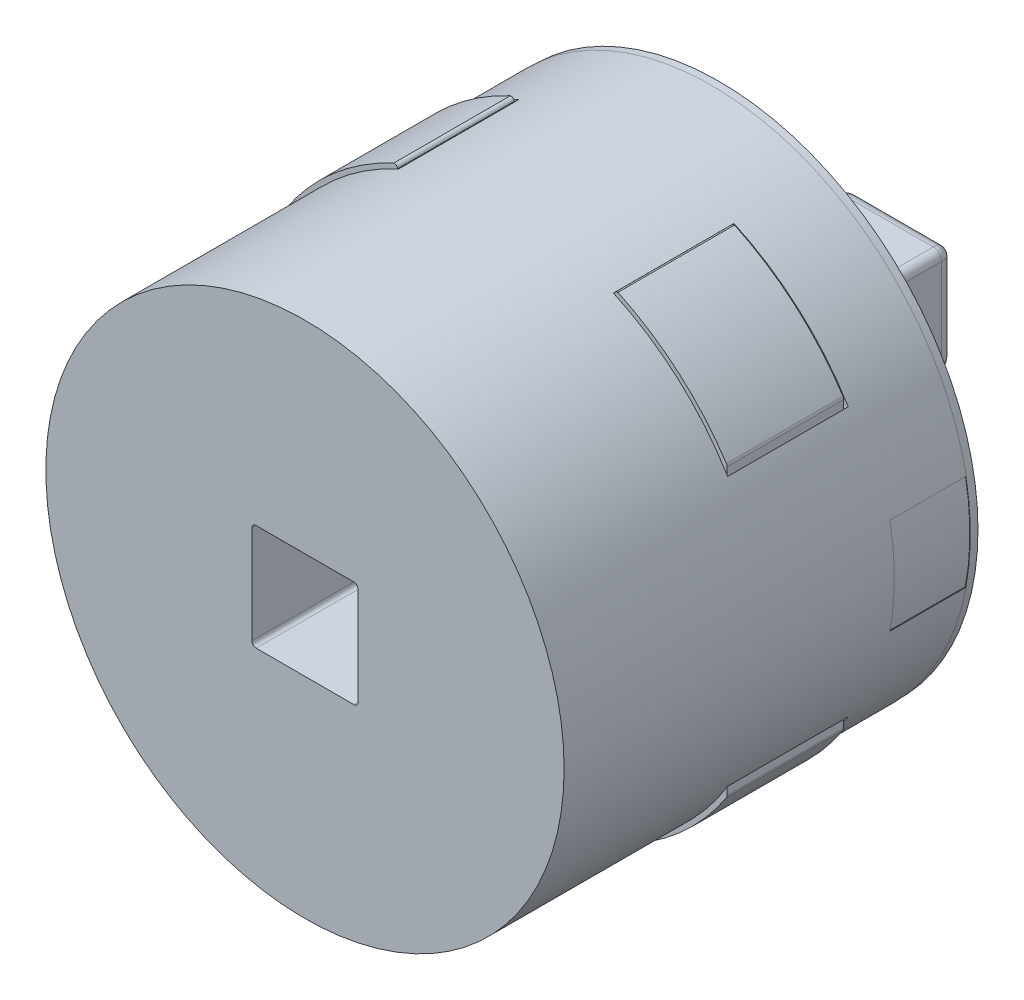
ISO-10303-21;
HEADER;
FILE_DESCRIPTION(('STEP AP214'),'2;1');
FILE_NAME('part.step','',(''),(''),'','','');
FILE_SCHEMA(('AUTOMOTIVE_DESIGN { 1 0 10303 214 1 1 1 1 }'));
ENDSEC;
DATA;
#1=APPLICATION_CONTEXT('core data for automotive mechanical design processes');
#2=APPLICATION_PROTOCOL_DEFINITION('international standard','automotive_design',2000,#1);
#3=PRODUCT_CONTEXT('',#1,'mechanical');
#4=PRODUCT('Part','Part','',(#3));
#5=PRODUCT_RELATED_PRODUCT_CATEGORY('part','',(#4));
#6=PRODUCT_DEFINITION_FORMATION('','',#4);
#7=PRODUCT_DEFINITION_CONTEXT('part definition',#1,'design');
#8=PRODUCT_DEFINITION('design','',#6,#7);
#9=PRODUCT_DEFINITION_SHAPE('','',#8);
#10=(LENGTH_UNIT() NAMED_UNIT(*) SI_UNIT(.MILLI.,.METRE.));
#11=(NAMED_UNIT(*) PLANE_ANGLE_UNIT() SI_UNIT($,.RADIAN.));
#12=(NAMED_UNIT(*) SI_UNIT($,.STERADIAN.) SOLID_ANGLE_UNIT());
#13=UNCERTAINTY_MEASURE_WITH_UNIT(LENGTH_MEASURE(1.E-05),#10,'distance_accuracy_value','');
#14=(GEOMETRIC_REPRESENTATION_CONTEXT(3) GLOBAL_UNCERTAINTY_ASSIGNED_CONTEXT((#13)) GLOBAL_UNIT_ASSIGNED_CONTEXT((#10,
#11,#12)) REPRESENTATION_CONTEXT('',''));
#15=CARTESIAN_POINT('',(0.,0.,0.));
#16=DIRECTION('',(0.,0.,1.));
#17=DIRECTION('',(1.,0.,0.));
#18=AXIS2_PLACEMENT_3D('',#15,#16,#17);
#19=CARTESIAN_POINT('',(-1.335,-1.335,-11.618));
#20=DIRECTION('',(0.,0.,1.));
#21=DIRECTION('',(1.,0.,0.));
#22=AXIS2_PLACEMENT_3D('',#19,#20,#21);
#23=CYLINDRICAL_SURFACE('',#22,0.25);
#24=DIRECTION('',(0.,0.,1.));
#25=VECTOR('',#24,1.);
#26=CARTESIAN_POINT('',(-1.585,-1.335,-11.618));
#27=LINE('',#26,#25);
#28=CARTESIAN_POINT('',(-1.585,-1.335,-11.238));
#29=VERTEX_POINT('',#28);
#30=CARTESIAN_POINT('',(-1.585,-1.335,-0.595));
#31=VERTEX_POINT('',#30);
#32=EDGE_CURVE('E123',#29,#31,#27,.T.);
#33=ORIENTED_EDGE('',*,*,#32,.F.);
#34=CARTESIAN_POINT('',(-1.335,-1.335,-11.238));
#35=DIRECTION('',(0.,0.,1.));
#36=DIRECTION('',(1.,0.,0.));
#37=AXIS2_PLACEMENT_3D('',#34,#35,#36);
#38=CIRCLE('',#37,0.25);
#39=CARTESIAN_POINT('',(-1.335,-1.585,-11.238));
#40=VERTEX_POINT('',#39);
#41=EDGE_CURVE('E196',#29,#40,#38,.T.);
#42=ORIENTED_EDGE('',*,*,#41,.T.);
#43=DIRECTION('',(0.,0.,1.));
#44=VECTOR('',#43,1.);
#45=CARTESIAN_POINT('',(-1.335,-1.585,-11.618));
#46=LINE('',#45,#44);
#47=CARTESIAN_POINT('',(-1.335,-1.585,-0.595));
#48=VERTEX_POINT('',#47);
#49=EDGE_CURVE('E146',#40,#48,#46,.T.);
#50=ORIENTED_EDGE('',*,*,#49,.T.);
#51=CARTESIAN_POINT('',(-1.335,-1.335,-0.595));
#52=DIRECTION('',(0.,0.,-1.));
#53=DIRECTION('',(-1.,0.,0.));
#54=AXIS2_PLACEMENT_3D('',#51,#52,#53);
#55=CIRCLE('',#54,0.25);
#56=EDGE_CURVE('E141',#48,#31,#55,.T.);
#57=ORIENTED_EDGE('',*,*,#56,.T.);
#58=EDGE_LOOP('',(#33,#42,#50,#57));
#59=FACE_BOUND('',#58,.T.);
#60=ADVANCED_FACE('F42',(#59),#23,.T.);
#61=CARTESIAN_POINT('',(-1.585,-1.335,-11.618));
#62=DIRECTION('',(1.,0.,0.));
#63=DIRECTION('',(0.,0.,-1.));
#64=AXIS2_PLACEMENT_3D('',#61,#62,#63);
#65=PLANE('',#64);
#66=DIRECTION('',(0.,0.,1.));
#67=VECTOR('',#66,1.);
#68=CARTESIAN_POINT('',(-1.585,1.335,-11.618));
#69=LINE('',#68,#67);
#70=CARTESIAN_POINT('',(-1.585,1.335,-11.238));
#71=VERTEX_POINT('',#70);
#72=CARTESIAN_POINT('',(-1.585,1.335,-0.595));
#73=VERTEX_POINT('',#72);
#74=EDGE_CURVE('E135',#71,#73,#69,.T.);
#75=ORIENTED_EDGE('',*,*,#74,.F.);
#76=DIRECTION('',(0.,1.,0.));
#77=VECTOR('',#76,1.);
#78=CARTESIAN_POINT('',(-1.585,-1.335,-11.238));
#79=LINE('',#78,#77);
#80=EDGE_CURVE('E130',#71,#29,#79,.F.);
#81=ORIENTED_EDGE('',*,*,#80,.T.);
#82=ORIENTED_EDGE('',*,*,#32,.T.);
#83=DIRECTION('',(0.,1.,0.));
#84=VECTOR('',#83,1.);
#85=CARTESIAN_POINT('',(-1.585,-1.335,-0.595));
#86=LINE('',#85,#84);
#87=EDGE_CURVE('E127',#31,#73,#86,.T.);
#88=ORIENTED_EDGE('',*,*,#87,.T.);
#89=EDGE_LOOP('',(#75,#81,#82,#88));
#90=FACE_BOUND('',#89,.T.);
#91=ADVANCED_FACE('F126',(#90),#65,.F.);
#92=CARTESIAN_POINT('',(-1.335,1.335,-11.618));
#93=DIRECTION('',(0.,0.,1.));
#94=DIRECTION('',(1.,0.,0.));
#95=AXIS2_PLACEMENT_3D('',#92,#93,#94);
#96=CYLINDRICAL_SURFACE('',#95,0.25);
#97=DIRECTION('',(0.,0.,1.));
#98=VECTOR('',#97,1.);
#99=CARTESIAN_POINT('',(-1.335,1.585,-11.618));
#100=LINE('',#99,#98);
#101=CARTESIAN_POINT('',(-1.335,1.585,-11.238));
#102=VERTEX_POINT('',#101);
#103=CARTESIAN_POINT('',(-1.335,1.585,-0.595));
#104=VERTEX_POINT('',#103);
#105=EDGE_CURVE('E177',#102,#104,#100,.T.);
#106=ORIENTED_EDGE('',*,*,#105,.F.);
#107=CARTESIAN_POINT('',(-1.335,1.335,-11.238));
#108=DIRECTION('',(0.,0.,1.));
#109=DIRECTION('',(1.,0.,0.));
#110=AXIS2_PLACEMENT_3D('',#107,#108,#109);
#111=CIRCLE('',#110,0.25);
#112=EDGE_CURVE('E193',#102,#71,#111,.T.);
#113=ORIENTED_EDGE('',*,*,#112,.T.);
#114=ORIENTED_EDGE('',*,*,#74,.T.);
#115=CARTESIAN_POINT('',(-1.335,1.335,-0.595));
#116=DIRECTION('',(0.,0.,-1.));
#117=DIRECTION('',(-1.,0.,0.));
#118=AXIS2_PLACEMENT_3D('',#115,#116,#117);
#119=CIRCLE('',#118,0.25);
#120=EDGE_CURVE('E144',#73,#104,#119,.T.);
#121=ORIENTED_EDGE('',*,*,#120,.T.);
#122=EDGE_LOOP('',(#106,#113,#114,#121));
#123=FACE_BOUND('',#122,.T.);
#124=ADVANCED_FACE('F277',(#123),#96,.T.);
#125=CARTESIAN_POINT('',(-1.335,1.585,-11.618));
#126=DIRECTION('',(0.,-1.,0.));
#127=DIRECTION('',(0.,0.,-1.));
#128=AXIS2_PLACEMENT_3D('',#125,#126,#127);
#129=PLANE('',#128);
#130=DIRECTION('',(0.,0.,1.));
#131=VECTOR('',#130,1.);
#132=CARTESIAN_POINT('',(1.335,1.585,-11.618));
#133=LINE('',#132,#131);
#134=CARTESIAN_POINT('',(1.335,1.585,-11.238));
#135=VERTEX_POINT('',#134);
#136=CARTESIAN_POINT('',(1.335,1.585,-0.595));
#137=VERTEX_POINT('',#136);
#138=EDGE_CURVE('E175',#135,#137,#133,.T.);
#139=ORIENTED_EDGE('',*,*,#138,.F.);
#140=DIRECTION('',(1.,0.,0.));
#141=VECTOR('',#140,1.);
#142=CARTESIAN_POINT('',(-1.335,1.585,-11.238));
#143=LINE('',#142,#141);
#144=EDGE_CURVE('E191',#135,#102,#143,.F.);
#145=ORIENTED_EDGE('',*,*,#144,.T.);
#146=ORIENTED_EDGE('',*,*,#105,.T.);
#147=DIRECTION('',(1.,0.,0.));
#148=VECTOR('',#147,1.);
#149=CARTESIAN_POINT('',(-1.335,1.585,-0.595));
#150=LINE('',#149,#148);
#151=EDGE_CURVE('E154',#104,#137,#150,.T.);
#152=ORIENTED_EDGE('',*,*,#151,.T.);
#153=EDGE_LOOP('',(#139,#145,#146,#152));
#154=FACE_BOUND('',#153,.T.);
#155=ADVANCED_FACE('F281',(#154),#129,.F.);
#156=CARTESIAN_POINT('',(1.335,1.335,-11.618));
#157=DIRECTION('',(0.,0.,1.));
#158=DIRECTION('',(1.,0.,0.));
#159=AXIS2_PLACEMENT_3D('',#156,#157,#158);
#160=CYLINDRICAL_SURFACE('',#159,0.25);
#161=DIRECTION('',(0.,0.,1.));
#162=VECTOR('',#161,1.);
#163=CARTESIAN_POINT('',(1.585,1.335,-11.618));
#164=LINE('',#163,#162);
#165=CARTESIAN_POINT('',(1.585,1.335,-11.238));
#166=VERTEX_POINT('',#165);
#167=CARTESIAN_POINT('',(1.585,1.335,-0.595));
#168=VERTEX_POINT('',#167);
#169=EDGE_CURVE('E173',#166,#168,#164,.T.);
#170=ORIENTED_EDGE('',*,*,#169,.F.);
#171=CARTESIAN_POINT('',(1.335,1.335,-11.238));
#172=DIRECTION('',(0.,0.,1.));
#173=DIRECTION('',(1.,0.,0.));
#174=AXIS2_PLACEMENT_3D('',#171,#172,#173);
#175=CIRCLE('',#174,0.25);
#176=EDGE_CURVE('E134',#166,#135,#175,.T.);
#177=ORIENTED_EDGE('',*,*,#176,.T.);
#178=ORIENTED_EDGE('',*,*,#138,.T.);
#179=CARTESIAN_POINT('',(1.335,1.335,-0.595));
#180=DIRECTION('',(0.,0.,-1.));
#181=DIRECTION('',(-1.,0.,0.));
#182=AXIS2_PLACEMENT_3D('',#179,#180,#181);
#183=CIRCLE('',#182,0.25);
#184=EDGE_CURVE('E157',#137,#168,#183,.T.);
#185=ORIENTED_EDGE('',*,*,#184,.T.);
#186=EDGE_LOOP('',(#170,#177,#178,#185));
#187=FACE_BOUND('',#186,.T.);
#188=ADVANCED_FACE('F287',(#187),#160,.T.);
#189=CARTESIAN_POINT('',(1.585,1.335,-11.618));
#190=DIRECTION('',(-1.,0.,0.));
#191=DIRECTION('',(0.,0.,1.));
#192=AXIS2_PLACEMENT_3D('',#189,#190,#191);
#193=PLANE('',#192);
#194=DIRECTION('',(0.,0.,1.));
#195=VECTOR('',#194,1.);
#196=CARTESIAN_POINT('',(1.585,-1.335,-11.618));
#197=LINE('',#196,#195);
#198=CARTESIAN_POINT('',(1.585,-1.335,-11.238));
#199=VERTEX_POINT('',#198);
#200=CARTESIAN_POINT('',(1.585,-1.335,-0.595));
#201=VERTEX_POINT('',#200);
#202=EDGE_CURVE('E171',#199,#201,#197,.T.);
#203=ORIENTED_EDGE('',*,*,#202,.F.);
#204=DIRECTION('',(0.,-1.,0.));
#205=VECTOR('',#204,1.);
#206=CARTESIAN_POINT('',(1.585,1.335,-11.238));
#207=LINE('',#206,#205);
#208=EDGE_CURVE('E12',#199,#166,#207,.F.);
#209=ORIENTED_EDGE('',*,*,#208,.T.);
#210=ORIENTED_EDGE('',*,*,#169,.T.);
#211=DIRECTION('',(0.,-1.,0.));
#212=VECTOR('',#211,1.);
#213=CARTESIAN_POINT('',(1.585,1.335,-0.595));
#214=LINE('',#213,#212);
#215=EDGE_CURVE('E160',#168,#201,#214,.T.);
#216=ORIENTED_EDGE('',*,*,#215,.T.);
#217=EDGE_LOOP('',(#203,#209,#210,#216));
#218=FACE_BOUND('',#217,.T.);
#219=ADVANCED_FACE('F291',(#218),#193,.F.);
#220=CARTESIAN_POINT('',(1.335,-1.335,-11.618));
#221=DIRECTION('',(0.,0.,1.));
#222=DIRECTION('',(1.,0.,0.));
#223=AXIS2_PLACEMENT_3D('',#220,#221,#222);
#224=CYLINDRICAL_SURFACE('',#223,0.25);
#225=DIRECTION('',(0.,0.,1.));
#226=VECTOR('',#225,1.);
#227=CARTESIAN_POINT('',(1.335,-1.585,-11.618));
#228=LINE('',#227,#226);
#229=CARTESIAN_POINT('',(1.335,-1.585,-11.238));
#230=VERTEX_POINT('',#229);
#231=CARTESIAN_POINT('',(1.335,-1.585,-0.595));
#232=VERTEX_POINT('',#231);
#233=EDGE_CURVE('E169',#230,#232,#228,.T.);
#234=ORIENTED_EDGE('',*,*,#233,.F.);
#235=CARTESIAN_POINT('',(1.335,-1.335,-11.238));
#236=DIRECTION('',(0.,0.,1.));
#237=DIRECTION('',(1.,0.,0.));
#238=AXIS2_PLACEMENT_3D('',#235,#236,#237);
#239=CIRCLE('',#238,0.25);
#240=EDGE_CURVE('E54',#230,#199,#239,.T.);
#241=ORIENTED_EDGE('',*,*,#240,.T.);
#242=ORIENTED_EDGE('',*,*,#202,.T.);
#243=CARTESIAN_POINT('',(1.335,-1.335,-0.595));
#244=DIRECTION('',(0.,0.,-1.));
#245=DIRECTION('',(-1.,0.,0.));
#246=AXIS2_PLACEMENT_3D('',#243,#244,#245);
#247=CIRCLE('',#246,0.25);
#248=EDGE_CURVE('E163',#201,#232,#247,.T.);
#249=ORIENTED_EDGE('',*,*,#248,.T.);
#250=EDGE_LOOP('',(#234,#241,#242,#249));
#251=FACE_BOUND('',#250,.T.);
#252=ADVANCED_FACE('F295',(#251),#224,.T.);
#253=CARTESIAN_POINT('',(1.335,-1.585,-11.618));
#254=DIRECTION('',(0.,1.,0.));
#255=DIRECTION('',(0.,0.,1.));
#256=AXIS2_PLACEMENT_3D('',#253,#254,#255);
#257=PLANE('',#256);
#258=ORIENTED_EDGE('',*,*,#49,.F.);
#259=DIRECTION('',(-1.,0.,0.));
#260=VECTOR('',#259,1.);
#261=CARTESIAN_POINT('',(1.335,-1.585,-11.238));
#262=LINE('',#261,#260);
#263=EDGE_CURVE('E69',#40,#230,#262,.F.);
#264=ORIENTED_EDGE('',*,*,#263,.T.);
#265=ORIENTED_EDGE('',*,*,#233,.T.);
#266=DIRECTION('',(-1.,0.,0.));
#267=VECTOR('',#266,1.);
#268=CARTESIAN_POINT('',(1.335,-1.585,-0.595));
#269=LINE('',#268,#267);
#270=EDGE_CURVE('E166',#232,#48,#269,.T.);
#271=ORIENTED_EDGE('',*,*,#270,.T.);
#272=EDGE_LOOP('',(#258,#264,#265,#271));
#273=FACE_BOUND('',#272,.T.);
#274=ADVANCED_FACE('F299',(#273),#257,.F.);
#275=CARTESIAN_POINT('',(-1.335,-1.335,-11.618));
#276=DIRECTION('',(0.,0.,-1.));
#277=DIRECTION('',(-1.,0.,0.));
#278=AXIS2_PLACEMENT_3D('',#275,#276,#277);
#279=PLANE('',#278);
#280=DIRECTION('',(0.,1.,0.));
#281=VECTOR('',#280,1.);
#282=CARTESIAN_POINT('',(-1.205,1.335,-11.618));
#283=LINE('',#282,#281);
#284=CARTESIAN_POINT('',(-1.205,-1.205,-11.618));
#285=VERTEX_POINT('',#284);
#286=CARTESIAN_POINT('',(-1.205,1.205,-11.618));
#287=VERTEX_POINT('',#286);
#288=EDGE_CURVE('E186',#285,#287,#283,.T.);
#289=ORIENTED_EDGE('',*,*,#288,.T.);
#290=DIRECTION('',(1.,0.,0.));
#291=VECTOR('',#290,1.);
#292=CARTESIAN_POINT('',(1.335,1.205,-11.618));
#293=LINE('',#292,#291);
#294=CARTESIAN_POINT('',(1.205,1.205,-11.618));
#295=VERTEX_POINT('',#294);
#296=EDGE_CURVE('E188',#287,#295,#293,.T.);
#297=ORIENTED_EDGE('',*,*,#296,.T.);
#298=DIRECTION('',(0.,-1.,0.));
#299=VECTOR('',#298,1.);
#300=CARTESIAN_POINT('',(1.205,-1.335,-11.618));
#301=LINE('',#300,#299);
#302=CARTESIAN_POINT('',(1.205,-1.205,-11.618));
#303=VERTEX_POINT('',#302);
#304=EDGE_CURVE('E182',#295,#303,#301,.T.);
#305=ORIENTED_EDGE('',*,*,#304,.T.);
#306=DIRECTION('',(-1.,0.,0.));
#307=VECTOR('',#306,1.);
#308=CARTESIAN_POINT('',(-1.335,-1.205,-11.618));
#309=LINE('',#308,#307);
#310=EDGE_CURVE('E184',#303,#285,#309,.T.);
#311=ORIENTED_EDGE('',*,*,#310,.T.);
#312=EDGE_LOOP('',(#289,#297,#305,#311));
#313=FACE_BOUND('',#312,.T.);
#314=ADVANCED_FACE('F302',(#313),#279,.T.);
#315=CARTESIAN_POINT('',(-1.335,-1.335,-0.595));
#316=DIRECTION('',(0.,0.,-1.));
#317=DIRECTION('',(-1.,0.,0.));
#318=AXIS2_PLACEMENT_3D('',#315,#316,#317);
#319=PLANE('',#318);
#320=ORIENTED_EDGE('',*,*,#56,.F.);
#321=ORIENTED_EDGE('',*,*,#270,.F.);
#322=ORIENTED_EDGE('',*,*,#248,.F.);
#323=ORIENTED_EDGE('',*,*,#215,.F.);
#324=ORIENTED_EDGE('',*,*,#184,.F.);
#325=ORIENTED_EDGE('',*,*,#151,.F.);
#326=ORIENTED_EDGE('',*,*,#120,.F.);
#327=ORIENTED_EDGE('',*,*,#87,.F.);
#328=EDGE_LOOP('',(#320,#321,#322,#323,#324,#325,#326,#327));
#329=FACE_BOUND('',#328,.T.);
#330=ADVANCED_FACE('F139',(#329),#319,.F.);
#331=CARTESIAN_POINT('',(-1.205,-1.205,-10.858));
#332=CARTESIAN_POINT('',(-1.205,-1.205,-10.858));
#333=CARTESIAN_POINT('',(-1.205,-1.205,-10.858));
#334=CARTESIAN_POINT('',(-1.22155460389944,-1.21066341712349,-10.8580066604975));
#335=CARTESIAN_POINT('',(-1.2161110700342,-1.2161110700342,-10.8580098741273));
#336=CARTESIAN_POINT('',(-1.21066341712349,-1.22155460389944,-10.8580066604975));
#337=CARTESIAN_POINT('',(-1.23811343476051,-1.21632828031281,-10.8590823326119));
#338=CARTESIAN_POINT('',(-1.22725297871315,-1.22725297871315,-10.8583713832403));
#339=CARTESIAN_POINT('',(-1.21632828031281,-1.23811343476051,-10.8590823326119));
#340=CARTESIAN_POINT('',(-1.27094633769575,-1.2275605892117,-10.8634011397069));
#341=CARTESIAN_POINT('',(-1.24956399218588,-1.24956399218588,-10.8598692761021));
#342=CARTESIAN_POINT('',(-1.2275605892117,-1.27094633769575,-10.8634011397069));
#343=CARTESIAN_POINT('',(-1.28722163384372,-1.23312845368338,-10.8666257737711));
#344=CARTESIAN_POINT('',(-1.26079612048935,-1.26079612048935,-10.8610076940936));
#345=CARTESIAN_POINT('',(-1.23312845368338,-1.28722163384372,-10.8666257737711));
#346=CARTESIAN_POINT('',(-1.31921029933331,-1.24407194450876,-10.8751980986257));
#347=CARTESIAN_POINT('',(-1.28338015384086,-1.28338015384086,-10.8641430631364));
#348=CARTESIAN_POINT('',(-1.24407194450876,-1.31921029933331,-10.8751980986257));
#349=CARTESIAN_POINT('',(-1.33492851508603,-1.24944922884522,-10.8805092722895));
#350=CARTESIAN_POINT('',(-1.29479426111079,-1.29479426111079,-10.8661439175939));
#351=CARTESIAN_POINT('',(-1.24944922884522,-1.33492851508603,-10.8805092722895));
#352=CARTESIAN_POINT('',(-1.36552927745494,-1.25991791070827,-10.8931842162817));
#353=CARTESIAN_POINT('',(-1.3178372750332,-1.3178372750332,-10.8711894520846));
#354=CARTESIAN_POINT('',(-1.25991791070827,-1.36552927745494,-10.8931842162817));
#355=CARTESIAN_POINT('',(-1.38042287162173,-1.26501308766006,-10.9004941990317));
#356=CARTESIAN_POINT('',(-1.32952617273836,-1.32952617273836,-10.874239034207));
#357=CARTESIAN_POINT('',(-1.26501308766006,-1.38042287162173,-10.9004941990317));
#358=CARTESIAN_POINT('',(-1.40911313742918,-1.27482817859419,-10.9170586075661));
#359=CARTESIAN_POINT('',(-1.35320337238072,-1.35320337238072,-10.8816825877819));
#360=CARTESIAN_POINT('',(-1.27482817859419,-1.40911313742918,-10.9170586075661));
#361=CARTESIAN_POINT('',(-1.42292963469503,-1.27955487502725,-10.9262437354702));
#362=CARTESIAN_POINT('',(-1.36524744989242,-1.36524744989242,-10.8860807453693));
#363=CARTESIAN_POINT('',(-1.27955487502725,-1.42292963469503,-10.9262437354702));
#364=CARTESIAN_POINT('',(-1.44921994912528,-1.28854892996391,-10.9464170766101));
#365=CARTESIAN_POINT('',(-1.38967737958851,-1.38967737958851,-10.896682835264));
#366=CARTESIAN_POINT('',(-1.28854892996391,-1.44921994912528,-10.9464170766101));
#367=CARTESIAN_POINT('',(-1.46172483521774,-1.29282691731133,-10.9573235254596));
#368=CARTESIAN_POINT('',(-1.40211152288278,-1.40211152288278,-10.902886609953));
#369=CARTESIAN_POINT('',(-1.29282691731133,-1.46172483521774,-10.9573235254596));
#370=CARTESIAN_POINT('',(-1.48516612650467,-1.30084630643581,-10.9807651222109));
#371=CARTESIAN_POINT('',(-1.42725667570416,-1.42725667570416,-10.9177536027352));
#372=CARTESIAN_POINT('',(-1.30084630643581,-1.48516612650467,-10.9807651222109));
#373=CARTESIAN_POINT('',(-1.49614665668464,-1.30460280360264,-10.9932110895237));
#374=CARTESIAN_POINT('',(-1.44000388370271,-1.44000388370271,-10.9264054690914));
#375=CARTESIAN_POINT('',(-1.30460280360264,-1.49614665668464,-10.9932110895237));
#376=CARTESIAN_POINT('',(-1.51633767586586,-1.31151025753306,-11.0195252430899));
#377=CARTESIAN_POINT('',(-1.46549401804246,-1.46549401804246,-10.9469996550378));
#378=CARTESIAN_POINT('',(-1.31151025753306,-1.51633767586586,-11.0195252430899));
#379=CARTESIAN_POINT('',(-1.52560554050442,-1.31468084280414,-11.0333043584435));
#380=CARTESIAN_POINT('',(-1.4782555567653,-1.4782555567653,-10.9589075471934));
#381=CARTESIAN_POINT('',(-1.31468084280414,-1.52560554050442,-11.0333043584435));
#382=CARTESIAN_POINT('',(-1.54219907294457,-1.3203575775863,-11.0620466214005));
#383=CARTESIAN_POINT('',(-1.50313556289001,-1.50313556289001,-10.9868837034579));
#384=CARTESIAN_POINT('',(-1.3203575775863,-1.54219907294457,-11.0620466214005));
#385=CARTESIAN_POINT('',(-1.54959243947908,-1.32288688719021,-11.0769306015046));
#386=CARTESIAN_POINT('',(-1.51525060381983,-1.51525060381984,-11.0028763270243));
#387=CARTESIAN_POINT('',(-1.32288688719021,-1.54959243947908,-11.0769306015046));
#388=CARTESIAN_POINT('',(-1.56230080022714,-1.32723448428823,-11.107613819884));
#389=CARTESIAN_POINT('',(-1.53774111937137,-1.53774111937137,-11.0395836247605));
#390=CARTESIAN_POINT('',(-1.32723448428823,-1.56230080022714,-11.107613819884));
#391=CARTESIAN_POINT('',(-1.56768616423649,-1.32907684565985,-11.12335394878));
#392=CARTESIAN_POINT('',(-1.54809178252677,-1.54809178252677,-11.0601592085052));
#393=CARTESIAN_POINT('',(-1.32907684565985,-1.56768616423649,-11.12335394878));
#394=CARTESIAN_POINT('',(-1.57628637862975,-1.33201902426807,-11.1554543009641));
#395=CARTESIAN_POINT('',(-1.56560300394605,-1.56560300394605,-11.1057498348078));
#396=CARTESIAN_POINT('',(-1.33201902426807,-1.57628637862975,-11.1554543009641));
#397=CARTESIAN_POINT('',(-1.57956154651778,-1.33313947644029,-11.1717817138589));
#398=CARTESIAN_POINT('',(-1.57272791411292,-1.57272791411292,-11.1305460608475));
#399=CARTESIAN_POINT('',(-1.33313947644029,-1.57956154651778,-11.1717817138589));
#400=CARTESIAN_POINT('',(-1.58390065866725,-1.33462390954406,-11.2047457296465));
#401=CARTESIAN_POINT('',(-1.58243969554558,-1.58243969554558,-11.1830353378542));
#402=CARTESIAN_POINT('',(-1.33462390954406,-1.58390065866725,-11.2047457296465));
#403=CARTESIAN_POINT('',(-1.585,-1.335,-11.2213728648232));
#404=CARTESIAN_POINT('',(-1.585,-1.585,-11.2104374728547));
#405=CARTESIAN_POINT('',(-1.335,-1.585,-11.2213728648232));
#406=CARTESIAN_POINT('',(-1.585,-1.335,-11.2546271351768));
#407=CARTESIAN_POINT('',(-1.585,-1.585,-11.2655625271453));
#408=CARTESIAN_POINT('',(-1.335,-1.585,-11.2546271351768));
#409=CARTESIAN_POINT('',(-1.58390065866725,-1.33462390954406,-11.2712542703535));
#410=CARTESIAN_POINT('',(-1.58243969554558,-1.58243969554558,-11.2929646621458));
#411=CARTESIAN_POINT('',(-1.33462390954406,-1.58390065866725,-11.2712542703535));
#412=CARTESIAN_POINT('',(-1.57956154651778,-1.33313947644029,-11.3042182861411));
#413=CARTESIAN_POINT('',(-1.57272791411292,-1.57272791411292,-11.3454539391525));
#414=CARTESIAN_POINT('',(-1.33313947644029,-1.57956154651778,-11.3042182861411));
#415=CARTESIAN_POINT('',(-1.57628637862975,-1.33201902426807,-11.3205456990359));
#416=CARTESIAN_POINT('',(-1.56560300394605,-1.56560300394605,-11.3702501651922));
#417=CARTESIAN_POINT('',(-1.33201902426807,-1.57628637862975,-11.3205456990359));
#418=CARTESIAN_POINT('',(-1.56768616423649,-1.32907684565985,-11.35264605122));
#419=CARTESIAN_POINT('',(-1.54809178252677,-1.54809178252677,-11.4158407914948));
#420=CARTESIAN_POINT('',(-1.32907684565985,-1.56768616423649,-11.35264605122));
#421=CARTESIAN_POINT('',(-1.56230080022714,-1.32723448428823,-11.368386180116));
#422=CARTESIAN_POINT('',(-1.53774111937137,-1.53774111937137,-11.4364163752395));
#423=CARTESIAN_POINT('',(-1.32723448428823,-1.56230080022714,-11.368386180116));
#424=CARTESIAN_POINT('',(-1.54959243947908,-1.32288688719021,-11.3990693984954));
#425=CARTESIAN_POINT('',(-1.51525060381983,-1.51525060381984,-11.4731236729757));
#426=CARTESIAN_POINT('',(-1.32288688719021,-1.54959243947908,-11.3990693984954));
#427=CARTESIAN_POINT('',(-1.54219907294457,-1.3203575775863,-11.4139533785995));
#428=CARTESIAN_POINT('',(-1.50313556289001,-1.50313556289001,-11.4891162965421));
#429=CARTESIAN_POINT('',(-1.3203575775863,-1.54219907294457,-11.4139533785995));
#430=CARTESIAN_POINT('',(-1.52560554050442,-1.31468084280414,-11.4426956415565));
#431=CARTESIAN_POINT('',(-1.4782555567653,-1.4782555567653,-11.5170924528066));
#432=CARTESIAN_POINT('',(-1.31468084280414,-1.52560554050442,-11.4426956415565));
#433=CARTESIAN_POINT('',(-1.51633767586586,-1.31151025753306,-11.4564747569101));
#434=CARTESIAN_POINT('',(-1.46549401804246,-1.46549401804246,-11.5290003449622));
#435=CARTESIAN_POINT('',(-1.31151025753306,-1.51633767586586,-11.4564747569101));
#436=CARTESIAN_POINT('',(-1.49614665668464,-1.30460280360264,-11.4827889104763));
#437=CARTESIAN_POINT('',(-1.44000388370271,-1.44000388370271,-11.5495945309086));
#438=CARTESIAN_POINT('',(-1.30460280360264,-1.49614665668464,-11.4827889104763));
#439=CARTESIAN_POINT('',(-1.48516612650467,-1.30084630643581,-11.4952348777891));
#440=CARTESIAN_POINT('',(-1.42725667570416,-1.42725667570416,-11.5582463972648));
#441=CARTESIAN_POINT('',(-1.30084630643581,-1.48516612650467,-11.4952348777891));
#442=CARTESIAN_POINT('',(-1.46172483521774,-1.29282691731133,-11.5186764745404));
#443=CARTESIAN_POINT('',(-1.40211152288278,-1.40211152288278,-11.573113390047));
#444=CARTESIAN_POINT('',(-1.29282691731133,-1.46172483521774,-11.5186764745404));
#445=CARTESIAN_POINT('',(-1.44921994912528,-1.28854892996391,-11.5295829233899));
#446=CARTESIAN_POINT('',(-1.38967737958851,-1.38967737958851,-11.5793171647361));
#447=CARTESIAN_POINT('',(-1.28854892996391,-1.44921994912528,-11.5295829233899));
#448=CARTESIAN_POINT('',(-1.42292963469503,-1.27955487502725,-11.5497562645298));
#449=CARTESIAN_POINT('',(-1.36524744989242,-1.36524744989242,-11.5899192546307));
#450=CARTESIAN_POINT('',(-1.27955487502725,-1.42292963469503,-11.5497562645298));
#451=CARTESIAN_POINT('',(-1.40911313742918,-1.27482817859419,-11.5589413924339));
#452=CARTESIAN_POINT('',(-1.35320337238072,-1.35320337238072,-11.5943174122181));
#453=CARTESIAN_POINT('',(-1.27482817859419,-1.40911313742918,-11.5589413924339));
#454=CARTESIAN_POINT('',(-1.38042287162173,-1.26501308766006,-11.5755058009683));
#455=CARTESIAN_POINT('',(-1.32952617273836,-1.32952617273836,-11.601760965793));
#456=CARTESIAN_POINT('',(-1.26501308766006,-1.38042287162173,-11.5755058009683));
#457=CARTESIAN_POINT('',(-1.36552927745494,-1.25991791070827,-11.5828157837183));
#458=CARTESIAN_POINT('',(-1.3178372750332,-1.3178372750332,-11.6048105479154));
#459=CARTESIAN_POINT('',(-1.25991791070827,-1.36552927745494,-11.5828157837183));
#460=CARTESIAN_POINT('',(-1.33492851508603,-1.24944922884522,-11.5954907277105));
#461=CARTESIAN_POINT('',(-1.29479426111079,-1.29479426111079,-11.6098560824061));
#462=CARTESIAN_POINT('',(-1.24944922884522,-1.33492851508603,-11.5954907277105));
#463=CARTESIAN_POINT('',(-1.31921029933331,-1.24407194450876,-11.6008019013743));
#464=CARTESIAN_POINT('',(-1.28338015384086,-1.28338015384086,-11.6118569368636));
#465=CARTESIAN_POINT('',(-1.24407194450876,-1.31921029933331,-11.6008019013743));
#466=CARTESIAN_POINT('',(-1.28722163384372,-1.23312845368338,-11.6093742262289));
#467=CARTESIAN_POINT('',(-1.26079612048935,-1.26079612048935,-11.6149923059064));
#468=CARTESIAN_POINT('',(-1.23312845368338,-1.28722163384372,-11.6093742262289));
#469=CARTESIAN_POINT('',(-1.27094633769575,-1.2275605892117,-11.6125988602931));
#470=CARTESIAN_POINT('',(-1.24956399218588,-1.24956399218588,-11.6161307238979));
#471=CARTESIAN_POINT('',(-1.2275605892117,-1.27094633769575,-11.6125988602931));
#472=CARTESIAN_POINT('',(-1.23811343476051,-1.21632828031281,-11.6169176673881));
#473=CARTESIAN_POINT('',(-1.22725297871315,-1.22725297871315,-11.6176286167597));
#474=CARTESIAN_POINT('',(-1.21632828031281,-1.23811343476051,-11.6169176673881));
#475=CARTESIAN_POINT('',(-1.22155460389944,-1.21066341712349,-11.6179933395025));
#476=CARTESIAN_POINT('',(-1.2161110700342,-1.2161110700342,-11.6179901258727));
#477=CARTESIAN_POINT('',(-1.21066341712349,-1.22155460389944,-11.6179933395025));
#478=CARTESIAN_POINT('',(-1.205,-1.205,-11.618));
#479=CARTESIAN_POINT('',(-1.205,-1.205,-11.618));
#480=CARTESIAN_POINT('',(-1.205,-1.205,-11.618));
#481=(BOUNDED_SURFACE() B_SPLINE_SURFACE(3,2,((#331,#332,#333),(#334,#335,#336),(#337,#338,
#339),(#340,#341,#342),(#343,#344,#345),(#346,#347,#348),(#349,#350,#351),(#352,#353,#354),
(#355,#356,#357),(#358,#359,#360),(#361,#362,#363),(#364,#365,#366),(#367,#368,#369),(#370,#371,
#372),(#373,#374,#375),(#376,#377,#378),(#379,#380,#381),(#382,#383,#384),(#385,#386,#387),
(#388,#389,#390),(#391,#392,#393),(#394,#395,#396),(#397,#398,#399),(#400,#401,#402),(#403,#404,
#405),(#406,#407,#408),(#409,#410,#411),(#412,#413,#414),(#415,#416,#417),(#418,#419,#420),
(#421,#422,#423),(#424,#425,#426),(#427,#428,#429),(#430,#431,#432),(#433,#434,#435),(#436,#437,
#438),(#439,#440,#441),(#442,#443,#444),(#445,#446,#447),(#448,#449,#450),(#451,#452,#453),
(#454,#455,#456),(#457,#458,#459),(#460,#461,#462),(#463,#464,#465),(#466,#467,#468),(#469,#470,
#471),(#472,#473,#474),(#475,#476,#477),(#478,#479,#480)),.UNSPECIFIED.,.F.,.F.,
.F.) B_SPLINE_SURFACE_WITH_KNOTS((4,2,2,2,2,2,2,2,2,2,2,2,2,2,2,2,2,2,2,2,2,2,2,2,4),(3,3),(0.,
0.0240227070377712,0.047841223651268,0.0712602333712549,0.0941023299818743,0.116217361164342,
0.137492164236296,0.157860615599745,0.17731354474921,0.195907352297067,0.213769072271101,
0.231094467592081,0.248135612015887,0.265176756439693,0.282502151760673,0.300363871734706,
0.318957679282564,0.338410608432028,0.358779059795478,0.380053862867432,0.402168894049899,
0.425010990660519,0.448430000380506,0.472248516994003,0.496271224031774),(0.,1.),
.UNSPECIFIED.) GEOMETRIC_REPRESENTATION_ITEM() RATIONAL_B_SPLINE_SURFACE(((1.,1.,1.),(1.,
1.00000566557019,1.),(1.,0.998576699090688,1.),(1.,0.992910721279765,1.),(1.,0.988697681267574,
1.),(1.,0.977617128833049,1.),(1.,0.970795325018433,1.),(1.,0.954789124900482,1.),(1.,
0.94566706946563,1.),(1.,0.92548796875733,1.),(1.,0.914501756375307,1.),(1.,0.891169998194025,
1.),(1.,0.878891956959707,1.),(1.,0.853706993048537,1.),(1.,0.840849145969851,1.),(1.,
0.815387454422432,1.),(1.,0.802798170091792,1.),(1.,0.77888073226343,1.),(1.,0.767521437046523,
1.),(1.,0.747118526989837,1.),(1.,0.738001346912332,1.),(1.,0.723039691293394,1.),(1.,
0.717105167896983,1.),(1.,0.709170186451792,1.),(1.,0.707106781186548,1.),(1.,0.707106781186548,
1.),(1.,0.709170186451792,1.),(1.,0.717105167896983,1.),(1.,0.723039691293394,1.),(1.,
0.738001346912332,1.),(1.,0.747118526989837,1.),(1.,0.767521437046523,1.),(1.,0.77888073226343,
1.),(1.,0.802798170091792,1.),(1.,0.815387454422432,1.),(1.,0.840849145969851,1.),(1.,
0.853706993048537,1.),(1.,0.878891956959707,1.),(1.,0.891169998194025,1.),(1.,0.914501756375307,
1.),(1.,0.92548796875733,1.),(1.,0.94566706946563,1.),(1.,0.954789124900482,1.),(1.,
0.970795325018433,1.),(1.,0.977617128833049,1.),(1.,0.988697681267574,1.),(1.,0.992910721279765,
1.),(1.,0.998576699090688,1.),(1.,1.00000566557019,1.),(1.,1.,1.))) REPRESENTATION_ITEM('') SURFACE());
#482=CARTESIAN_POINT('',(-1.205,-1.205,-11.238));
#483=DIRECTION('',(-0.946163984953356,0.32368767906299,0.));
#484=DIRECTION('',(-0.32368767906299,-0.946163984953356,0.));
#485=AXIS2_PLACEMENT_3D('',#482,#483,#484);
#486=ELLIPSE('',#485,0.401621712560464,0.38);
#487=EDGE_CURVE('E151',#40,#285,#486,.F.);
#488=ORIENTED_EDGE('',*,*,#487,.F.);
#489=ORIENTED_EDGE('',*,*,#41,.F.);
#490=CARTESIAN_POINT('',(-1.205,-1.205,-11.238));
#491=DIRECTION('',(-0.32368767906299,0.946163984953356,0.));
#492=DIRECTION('',(-0.946163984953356,-0.32368767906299,0.));
#493=AXIS2_PLACEMENT_3D('',#490,#491,#492);
#494=ELLIPSE('',#493,0.401621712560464,0.38);
#495=EDGE_CURVE('E148',#285,#29,#494,.T.);
#496=ORIENTED_EDGE('',*,*,#495,.F.);
#497=EDGE_LOOP('',(#488,#489,#496));
#498=FACE_BOUND('',#497,.T.);
#499=ADVANCED_FACE('F44',(#498),#481,.T.);
#500=CARTESIAN_POINT('',(-1.205,-1.335,-11.238));
#501=DIRECTION('',(0.,-1.,0.));
#502=DIRECTION('',(0.,0.,-1.));
#503=AXIS2_PLACEMENT_3D('',#500,#501,#502);
#504=CYLINDRICAL_SURFACE('',#503,0.38);
#505=ORIENTED_EDGE('',*,*,#495,.T.);
#506=ORIENTED_EDGE('',*,*,#80,.F.);
#507=CARTESIAN_POINT('',(-1.205,1.205,-11.238));
#508=DIRECTION('',(0.32368767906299,0.946163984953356,0.));
#509=DIRECTION('',(-0.946163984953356,0.32368767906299,0.));
#510=AXIS2_PLACEMENT_3D('',#507,#508,#509);
#511=ELLIPSE('',#510,0.401621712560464,0.38);
#512=EDGE_CURVE('E244',#287,#71,#511,.T.);
#513=ORIENTED_EDGE('',*,*,#512,.F.);
#514=ORIENTED_EDGE('',*,*,#288,.F.);
#515=EDGE_LOOP('',(#505,#506,#513,#514));
#516=FACE_BOUND('',#515,.T.);
#517=ADVANCED_FACE('F239',(#516),#504,.T.);
#518=CARTESIAN_POINT('',(-1.335,-1.205,-11.238));
#519=DIRECTION('',(1.,0.,0.));
#520=DIRECTION('',(0.,0.,-1.));
#521=AXIS2_PLACEMENT_3D('',#518,#519,#520);
#522=CYLINDRICAL_SURFACE('',#521,0.38);
#523=ORIENTED_EDGE('',*,*,#487,.T.);
#524=ORIENTED_EDGE('',*,*,#310,.F.);
#525=CARTESIAN_POINT('',(1.205,-1.205,-11.238));
#526=DIRECTION('',(-0.946163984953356,-0.32368767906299,0.));
#527=DIRECTION('',(0.32368767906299,-0.946163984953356,0.));
#528=AXIS2_PLACEMENT_3D('',#525,#526,#527);
#529=ELLIPSE('',#528,0.401621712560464,0.38);
#530=EDGE_CURVE('E251',#230,#303,#529,.F.);
#531=ORIENTED_EDGE('',*,*,#530,.F.);
#532=ORIENTED_EDGE('',*,*,#263,.F.);
#533=EDGE_LOOP('',(#523,#524,#531,#532));
#534=FACE_BOUND('',#533,.T.);
#535=ADVANCED_FACE('F236',(#534),#522,.T.);
#536=CARTESIAN_POINT('',(-1.205,1.205,-10.858));
#537=CARTESIAN_POINT('',(-1.205,1.205,-10.858));
#538=CARTESIAN_POINT('',(-1.205,1.205,-10.858));
#539=CARTESIAN_POINT('',(-1.21066341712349,1.22155460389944,-10.8580066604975));
#540=CARTESIAN_POINT('',(-1.2161110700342,1.2161110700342,-10.8580098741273));
#541=CARTESIAN_POINT('',(-1.22155460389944,1.21066341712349,-10.8580066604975));
#542=CARTESIAN_POINT('',(-1.21632828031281,1.23811343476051,-10.8590823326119));
#543=CARTESIAN_POINT('',(-1.22725297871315,1.22725297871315,-10.8583713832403));
#544=CARTESIAN_POINT('',(-1.23811343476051,1.21632828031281,-10.8590823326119));
#545=CARTESIAN_POINT('',(-1.2275605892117,1.27094633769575,-10.8634011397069));
#546=CARTESIAN_POINT('',(-1.24956399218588,1.24956399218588,-10.8598692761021));
#547=CARTESIAN_POINT('',(-1.27094633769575,1.2275605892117,-10.8634011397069));
#548=CARTESIAN_POINT('',(-1.23312845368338,1.28722163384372,-10.8666257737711));
#549=CARTESIAN_POINT('',(-1.26079612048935,1.26079612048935,-10.8610076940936));
#550=CARTESIAN_POINT('',(-1.28722163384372,1.23312845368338,-10.8666257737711));
#551=CARTESIAN_POINT('',(-1.24407194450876,1.31921029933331,-10.8751980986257));
#552=CARTESIAN_POINT('',(-1.28338015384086,1.28338015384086,-10.8641430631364));
#553=CARTESIAN_POINT('',(-1.31921029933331,1.24407194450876,-10.8751980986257));
#554=CARTESIAN_POINT('',(-1.24944922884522,1.33492851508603,-10.8805092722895));
#555=CARTESIAN_POINT('',(-1.29479426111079,1.29479426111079,-10.8661439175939));
#556=CARTESIAN_POINT('',(-1.33492851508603,1.24944922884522,-10.8805092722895));
#557=CARTESIAN_POINT('',(-1.25991791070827,1.36552927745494,-10.8931842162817));
#558=CARTESIAN_POINT('',(-1.3178372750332,1.3178372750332,-10.8711894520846));
#559=CARTESIAN_POINT('',(-1.36552927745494,1.25991791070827,-10.8931842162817));
#560=CARTESIAN_POINT('',(-1.26501308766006,1.38042287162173,-10.9004941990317));
#561=CARTESIAN_POINT('',(-1.32952617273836,1.32952617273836,-10.874239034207));
#562=CARTESIAN_POINT('',(-1.38042287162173,1.26501308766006,-10.9004941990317));
#563=CARTESIAN_POINT('',(-1.27482817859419,1.40911313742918,-10.9170586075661));
#564=CARTESIAN_POINT('',(-1.35320337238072,1.35320337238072,-10.8816825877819));
#565=CARTESIAN_POINT('',(-1.40911313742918,1.27482817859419,-10.9170586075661));
#566=CARTESIAN_POINT('',(-1.27955487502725,1.42292963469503,-10.9262437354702));
#567=CARTESIAN_POINT('',(-1.36524744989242,1.36524744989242,-10.8860807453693));
#568=CARTESIAN_POINT('',(-1.42292963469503,1.27955487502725,-10.9262437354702));
#569=CARTESIAN_POINT('',(-1.28854892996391,1.44921994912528,-10.9464170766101));
#570=CARTESIAN_POINT('',(-1.38967737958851,1.38967737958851,-10.896682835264));
#571=CARTESIAN_POINT('',(-1.44921994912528,1.28854892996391,-10.9464170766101));
#572=CARTESIAN_POINT('',(-1.29282691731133,1.46172483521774,-10.9573235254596));
#573=CARTESIAN_POINT('',(-1.40211152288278,1.40211152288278,-10.902886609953));
#574=CARTESIAN_POINT('',(-1.46172483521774,1.29282691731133,-10.9573235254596));
#575=CARTESIAN_POINT('',(-1.30084630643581,1.48516612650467,-10.9807651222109));
#576=CARTESIAN_POINT('',(-1.42725667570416,1.42725667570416,-10.9177536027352));
#577=CARTESIAN_POINT('',(-1.48516612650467,1.30084630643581,-10.9807651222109));
#578=CARTESIAN_POINT('',(-1.30460280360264,1.49614665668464,-10.9932110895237));
#579=CARTESIAN_POINT('',(-1.44000388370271,1.44000388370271,-10.9264054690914));
#580=CARTESIAN_POINT('',(-1.49614665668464,1.30460280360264,-10.9932110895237));
#581=CARTESIAN_POINT('',(-1.31151025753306,1.51633767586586,-11.0195252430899));
#582=CARTESIAN_POINT('',(-1.46549401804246,1.46549401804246,-10.9469996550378));
#583=CARTESIAN_POINT('',(-1.51633767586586,1.31151025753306,-11.0195252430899));
#584=CARTESIAN_POINT('',(-1.31468084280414,1.52560554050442,-11.0333043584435));
#585=CARTESIAN_POINT('',(-1.4782555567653,1.4782555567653,-10.9589075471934));
#586=CARTESIAN_POINT('',(-1.52560554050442,1.31468084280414,-11.0333043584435));
#587=CARTESIAN_POINT('',(-1.3203575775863,1.54219907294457,-11.0620466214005));
#588=CARTESIAN_POINT('',(-1.50313556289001,1.50313556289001,-10.9868837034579));
#589=CARTESIAN_POINT('',(-1.54219907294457,1.3203575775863,-11.0620466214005));
#590=CARTESIAN_POINT('',(-1.32288688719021,1.54959243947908,-11.0769306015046));
#591=CARTESIAN_POINT('',(-1.51525060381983,1.51525060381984,-11.0028763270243));
#592=CARTESIAN_POINT('',(-1.54959243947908,1.32288688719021,-11.0769306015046));
#593=CARTESIAN_POINT('',(-1.32723448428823,1.56230080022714,-11.107613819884));
#594=CARTESIAN_POINT('',(-1.53774111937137,1.53774111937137,-11.0395836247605));
#595=CARTESIAN_POINT('',(-1.56230080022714,1.32723448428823,-11.107613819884));
#596=CARTESIAN_POINT('',(-1.32907684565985,1.56768616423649,-11.12335394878));
#597=CARTESIAN_POINT('',(-1.54809178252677,1.54809178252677,-11.0601592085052));
#598=CARTESIAN_POINT('',(-1.56768616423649,1.32907684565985,-11.12335394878));
#599=CARTESIAN_POINT('',(-1.33201902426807,1.57628637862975,-11.1554543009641));
#600=CARTESIAN_POINT('',(-1.56560300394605,1.56560300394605,-11.1057498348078));
#601=CARTESIAN_POINT('',(-1.57628637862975,1.33201902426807,-11.1554543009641));
#602=CARTESIAN_POINT('',(-1.33313947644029,1.57956154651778,-11.1717817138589));
#603=CARTESIAN_POINT('',(-1.57272791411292,1.57272791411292,-11.1305460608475));
#604=CARTESIAN_POINT('',(-1.57956154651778,1.33313947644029,-11.1717817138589));
#605=CARTESIAN_POINT('',(-1.33462390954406,1.58390065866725,-11.2047457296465));
#606=CARTESIAN_POINT('',(-1.58243969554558,1.58243969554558,-11.1830353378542));
#607=CARTESIAN_POINT('',(-1.58390065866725,1.33462390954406,-11.2047457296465));
#608=CARTESIAN_POINT('',(-1.335,1.585,-11.2213728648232));
#609=CARTESIAN_POINT('',(-1.585,1.585,-11.2104374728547));
#610=CARTESIAN_POINT('',(-1.585,1.335,-11.2213728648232));
#611=CARTESIAN_POINT('',(-1.335,1.585,-11.2546271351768));
#612=CARTESIAN_POINT('',(-1.585,1.585,-11.2655625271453));
#613=CARTESIAN_POINT('',(-1.585,1.335,-11.2546271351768));
#614=CARTESIAN_POINT('',(-1.33462390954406,1.58390065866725,-11.2712542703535));
#615=CARTESIAN_POINT('',(-1.58243969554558,1.58243969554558,-11.2929646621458));
#616=CARTESIAN_POINT('',(-1.58390065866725,1.33462390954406,-11.2712542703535));
#617=CARTESIAN_POINT('',(-1.33313947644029,1.57956154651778,-11.3042182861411));
#618=CARTESIAN_POINT('',(-1.57272791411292,1.57272791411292,-11.3454539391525));
#619=CARTESIAN_POINT('',(-1.57956154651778,1.33313947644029,-11.3042182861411));
#620=CARTESIAN_POINT('',(-1.33201902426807,1.57628637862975,-11.3205456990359));
#621=CARTESIAN_POINT('',(-1.56560300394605,1.56560300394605,-11.3702501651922));
#622=CARTESIAN_POINT('',(-1.57628637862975,1.33201902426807,-11.3205456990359));
#623=CARTESIAN_POINT('',(-1.32907684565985,1.56768616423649,-11.35264605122));
#624=CARTESIAN_POINT('',(-1.54809178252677,1.54809178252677,-11.4158407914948));
#625=CARTESIAN_POINT('',(-1.56768616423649,1.32907684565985,-11.35264605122));
#626=CARTESIAN_POINT('',(-1.32723448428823,1.56230080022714,-11.368386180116));
#627=CARTESIAN_POINT('',(-1.53774111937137,1.53774111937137,-11.4364163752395));
#628=CARTESIAN_POINT('',(-1.56230080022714,1.32723448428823,-11.368386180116));
#629=CARTESIAN_POINT('',(-1.32288688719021,1.54959243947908,-11.3990693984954));
#630=CARTESIAN_POINT('',(-1.51525060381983,1.51525060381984,-11.4731236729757));
#631=CARTESIAN_POINT('',(-1.54959243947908,1.32288688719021,-11.3990693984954));
#632=CARTESIAN_POINT('',(-1.3203575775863,1.54219907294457,-11.4139533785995));
#633=CARTESIAN_POINT('',(-1.50313556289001,1.50313556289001,-11.4891162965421));
#634=CARTESIAN_POINT('',(-1.54219907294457,1.3203575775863,-11.4139533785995));
#635=CARTESIAN_POINT('',(-1.31468084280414,1.52560554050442,-11.4426956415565));
#636=CARTESIAN_POINT('',(-1.4782555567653,1.4782555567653,-11.5170924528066));
#637=CARTESIAN_POINT('',(-1.52560554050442,1.31468084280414,-11.4426956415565));
#638=CARTESIAN_POINT('',(-1.31151025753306,1.51633767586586,-11.4564747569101));
#639=CARTESIAN_POINT('',(-1.46549401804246,1.46549401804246,-11.5290003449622));
#640=CARTESIAN_POINT('',(-1.51633767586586,1.31151025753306,-11.4564747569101));
#641=CARTESIAN_POINT('',(-1.30460280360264,1.49614665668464,-11.4827889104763));
#642=CARTESIAN_POINT('',(-1.44000388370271,1.44000388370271,-11.5495945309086));
#643=CARTESIAN_POINT('',(-1.49614665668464,1.30460280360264,-11.4827889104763));
#644=CARTESIAN_POINT('',(-1.30084630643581,1.48516612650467,-11.4952348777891));
#645=CARTESIAN_POINT('',(-1.42725667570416,1.42725667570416,-11.5582463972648));
#646=CARTESIAN_POINT('',(-1.48516612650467,1.30084630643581,-11.4952348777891));
#647=CARTESIAN_POINT('',(-1.29282691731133,1.46172483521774,-11.5186764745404));
#648=CARTESIAN_POINT('',(-1.40211152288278,1.40211152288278,-11.573113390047));
#649=CARTESIAN_POINT('',(-1.46172483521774,1.29282691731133,-11.5186764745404));
#650=CARTESIAN_POINT('',(-1.28854892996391,1.44921994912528,-11.5295829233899));
#651=CARTESIAN_POINT('',(-1.38967737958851,1.38967737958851,-11.5793171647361));
#652=CARTESIAN_POINT('',(-1.44921994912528,1.28854892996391,-11.5295829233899));
#653=CARTESIAN_POINT('',(-1.27955487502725,1.42292963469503,-11.5497562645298));
#654=CARTESIAN_POINT('',(-1.36524744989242,1.36524744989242,-11.5899192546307));
#655=CARTESIAN_POINT('',(-1.42292963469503,1.27955487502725,-11.5497562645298));
#656=CARTESIAN_POINT('',(-1.27482817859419,1.40911313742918,-11.5589413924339));
#657=CARTESIAN_POINT('',(-1.35320337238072,1.35320337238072,-11.5943174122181));
#658=CARTESIAN_POINT('',(-1.40911313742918,1.27482817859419,-11.5589413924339));
#659=CARTESIAN_POINT('',(-1.26501308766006,1.38042287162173,-11.5755058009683));
#660=CARTESIAN_POINT('',(-1.32952617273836,1.32952617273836,-11.601760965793));
#661=CARTESIAN_POINT('',(-1.38042287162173,1.26501308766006,-11.5755058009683));
#662=CARTESIAN_POINT('',(-1.25991791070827,1.36552927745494,-11.5828157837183));
#663=CARTESIAN_POINT('',(-1.3178372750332,1.3178372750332,-11.6048105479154));
#664=CARTESIAN_POINT('',(-1.36552927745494,1.25991791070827,-11.5828157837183));
#665=CARTESIAN_POINT('',(-1.24944922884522,1.33492851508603,-11.5954907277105));
#666=CARTESIAN_POINT('',(-1.29479426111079,1.29479426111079,-11.6098560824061));
#667=CARTESIAN_POINT('',(-1.33492851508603,1.24944922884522,-11.5954907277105));
#668=CARTESIAN_POINT('',(-1.24407194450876,1.31921029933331,-11.6008019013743));
#669=CARTESIAN_POINT('',(-1.28338015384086,1.28338015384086,-11.6118569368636));
#670=CARTESIAN_POINT('',(-1.31921029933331,1.24407194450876,-11.6008019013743));
#671=CARTESIAN_POINT('',(-1.23312845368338,1.28722163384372,-11.6093742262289));
#672=CARTESIAN_POINT('',(-1.26079612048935,1.26079612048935,-11.6149923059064));
#673=CARTESIAN_POINT('',(-1.28722163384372,1.23312845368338,-11.6093742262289));
#674=CARTESIAN_POINT('',(-1.2275605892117,1.27094633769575,-11.6125988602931));
#675=CARTESIAN_POINT('',(-1.24956399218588,1.24956399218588,-11.6161307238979));
#676=CARTESIAN_POINT('',(-1.27094633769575,1.2275605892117,-11.6125988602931));
#677=CARTESIAN_POINT('',(-1.21632828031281,1.23811343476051,-11.6169176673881));
#678=CARTESIAN_POINT('',(-1.22725297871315,1.22725297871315,-11.6176286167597));
#679=CARTESIAN_POINT('',(-1.23811343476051,1.21632828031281,-11.6169176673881));
#680=CARTESIAN_POINT('',(-1.21066341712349,1.22155460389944,-11.6179933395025));
#681=CARTESIAN_POINT('',(-1.2161110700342,1.2161110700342,-11.6179901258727));
#682=CARTESIAN_POINT('',(-1.22155460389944,1.21066341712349,-11.6179933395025));
#683=CARTESIAN_POINT('',(-1.205,1.205,-11.618));
#684=CARTESIAN_POINT('',(-1.205,1.205,-11.618));
#685=CARTESIAN_POINT('',(-1.205,1.205,-11.618));
#686=(BOUNDED_SURFACE() B_SPLINE_SURFACE(3,2,((#536,#537,#538),(#539,#540,#541),(#542,#543,
#544),(#545,#546,#547),(#548,#549,#550),(#551,#552,#553),(#554,#555,#556),(#557,#558,#559),
(#560,#561,#562),(#563,#564,#565),(#566,#567,#568),(#569,#570,#571),(#572,#573,#574),(#575,#576,
#577),(#578,#579,#580),(#581,#582,#583),(#584,#585,#586),(#587,#588,#589),(#590,#591,#592),
(#593,#594,#595),(#596,#597,#598),(#599,#600,#601),(#602,#603,#604),(#605,#606,#607),(#608,#609,
#610),(#611,#612,#613),(#614,#615,#616),(#617,#618,#619),(#620,#621,#622),(#623,#624,#625),
(#626,#627,#628),(#629,#630,#631),(#632,#633,#634),(#635,#636,#637),(#638,#639,#640),(#641,#642,
#643),(#644,#645,#646),(#647,#648,#649),(#650,#651,#652),(#653,#654,#655),(#656,#657,#658),
(#659,#660,#661),(#662,#663,#664),(#665,#666,#667),(#668,#669,#670),(#671,#672,#673),(#674,#675,
#676),(#677,#678,#679),(#680,#681,#682),(#683,#684,#685)),.UNSPECIFIED.,.F.,.F.,
.F.) B_SPLINE_SURFACE_WITH_KNOTS((4,2,2,2,2,2,2,2,2,2,2,2,2,2,2,2,2,2,2,2,2,2,2,2,4),(3,3),(0.,
0.0240227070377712,0.047841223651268,0.0712602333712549,0.0941023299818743,0.116217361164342,
0.137492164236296,0.157860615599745,0.17731354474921,0.195907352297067,0.213769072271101,
0.231094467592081,0.248135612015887,0.265176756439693,0.282502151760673,0.300363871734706,
0.318957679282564,0.338410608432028,0.358779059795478,0.380053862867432,0.402168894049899,
0.425010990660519,0.448430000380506,0.472248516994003,0.496271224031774),(0.,1.),
.UNSPECIFIED.) GEOMETRIC_REPRESENTATION_ITEM() RATIONAL_B_SPLINE_SURFACE(((1.,1.,1.),(1.,
1.00000566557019,1.),(1.,0.998576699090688,1.),(1.,0.992910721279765,1.),(1.,0.988697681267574,
1.),(1.,0.977617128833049,1.),(1.,0.970795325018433,1.),(1.,0.954789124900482,1.),(1.,
0.94566706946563,1.),(1.,0.92548796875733,1.),(1.,0.914501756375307,1.),(1.,0.891169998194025,
1.),(1.,0.878891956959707,1.),(1.,0.853706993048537,1.),(1.,0.840849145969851,1.),(1.,
0.815387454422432,1.),(1.,0.802798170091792,1.),(1.,0.77888073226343,1.),(1.,0.767521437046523,
1.),(1.,0.747118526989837,1.),(1.,0.738001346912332,1.),(1.,0.723039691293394,1.),(1.,
0.717105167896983,1.),(1.,0.709170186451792,1.),(1.,0.707106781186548,1.),(1.,0.707106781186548,
1.),(1.,0.709170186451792,1.),(1.,0.717105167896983,1.),(1.,0.723039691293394,1.),(1.,
0.738001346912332,1.),(1.,0.747118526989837,1.),(1.,0.767521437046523,1.),(1.,0.77888073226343,
1.),(1.,0.802798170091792,1.),(1.,0.815387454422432,1.),(1.,0.840849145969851,1.),(1.,
0.853706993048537,1.),(1.,0.878891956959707,1.),(1.,0.891169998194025,1.),(1.,0.914501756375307,
1.),(1.,0.92548796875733,1.),(1.,0.94566706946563,1.),(1.,0.954789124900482,1.),(1.,
0.970795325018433,1.),(1.,0.977617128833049,1.),(1.,0.988697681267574,1.),(1.,0.992910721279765,
1.),(1.,0.998576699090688,1.),(1.,1.00000566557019,1.),(1.,1.,1.))) REPRESENTATION_ITEM('') SURFACE());
#687=ORIENTED_EDGE('',*,*,#512,.T.);
#688=ORIENTED_EDGE('',*,*,#112,.F.);
#689=CARTESIAN_POINT('',(-1.205,1.205,-11.238));
#690=DIRECTION('',(0.946163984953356,0.32368767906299,0.));
#691=DIRECTION('',(-0.32368767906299,0.946163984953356,0.));
#692=AXIS2_PLACEMENT_3D('',#689,#690,#691);
#693=ELLIPSE('',#692,0.401621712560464,0.38);
#694=EDGE_CURVE('E256',#287,#102,#693,.T.);
#695=ORIENTED_EDGE('',*,*,#694,.F.);
#696=EDGE_LOOP('',(#687,#688,#695));
#697=FACE_BOUND('',#696,.T.);
#698=ADVANCED_FACE('F231',(#697),#686,.T.);
#699=CARTESIAN_POINT('',(1.205,-1.205,-10.858));
#700=CARTESIAN_POINT('',(1.205,-1.205,-10.858));
#701=CARTESIAN_POINT('',(1.205,-1.205,-10.858));
#702=CARTESIAN_POINT('',(1.21066341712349,-1.22155460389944,-10.8580066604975));
#703=CARTESIAN_POINT('',(1.2161110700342,-1.2161110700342,-10.8580098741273));
#704=CARTESIAN_POINT('',(1.22155460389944,-1.21066341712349,-10.8580066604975));
#705=CARTESIAN_POINT('',(1.21632828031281,-1.23811343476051,-10.8590823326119));
#706=CARTESIAN_POINT('',(1.22725297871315,-1.22725297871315,-10.8583713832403));
#707=CARTESIAN_POINT('',(1.23811343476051,-1.21632828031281,-10.8590823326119));
#708=CARTESIAN_POINT('',(1.2275605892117,-1.27094633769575,-10.8634011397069));
#709=CARTESIAN_POINT('',(1.24956399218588,-1.24956399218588,-10.8598692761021));
#710=CARTESIAN_POINT('',(1.27094633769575,-1.2275605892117,-10.8634011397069));
#711=CARTESIAN_POINT('',(1.23312845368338,-1.28722163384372,-10.8666257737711));
#712=CARTESIAN_POINT('',(1.26079612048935,-1.26079612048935,-10.8610076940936));
#713=CARTESIAN_POINT('',(1.28722163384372,-1.23312845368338,-10.8666257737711));
#714=CARTESIAN_POINT('',(1.24407194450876,-1.31921029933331,-10.8751980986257));
#715=CARTESIAN_POINT('',(1.28338015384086,-1.28338015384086,-10.8641430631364));
#716=CARTESIAN_POINT('',(1.31921029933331,-1.24407194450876,-10.8751980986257));
#717=CARTESIAN_POINT('',(1.24944922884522,-1.33492851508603,-10.8805092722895));
#718=CARTESIAN_POINT('',(1.29479426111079,-1.29479426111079,-10.8661439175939));
#719=CARTESIAN_POINT('',(1.33492851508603,-1.24944922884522,-10.8805092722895));
#720=CARTESIAN_POINT('',(1.25991791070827,-1.36552927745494,-10.8931842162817));
#721=CARTESIAN_POINT('',(1.3178372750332,-1.3178372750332,-10.8711894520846));
#722=CARTESIAN_POINT('',(1.36552927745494,-1.25991791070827,-10.8931842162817));
#723=CARTESIAN_POINT('',(1.26501308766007,-1.38042287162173,-10.9004941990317));
#724=CARTESIAN_POINT('',(1.32952617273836,-1.32952617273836,-10.874239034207));
#725=CARTESIAN_POINT('',(1.38042287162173,-1.26501308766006,-10.9004941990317));
#726=CARTESIAN_POINT('',(1.27482817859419,-1.40911313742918,-10.9170586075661));
#727=CARTESIAN_POINT('',(1.35320337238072,-1.35320337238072,-10.8816825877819));
#728=CARTESIAN_POINT('',(1.40911313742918,-1.27482817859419,-10.9170586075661));
#729=CARTESIAN_POINT('',(1.27955487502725,-1.42292963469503,-10.9262437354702));
#730=CARTESIAN_POINT('',(1.36524744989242,-1.36524744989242,-10.8860807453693));
#731=CARTESIAN_POINT('',(1.42292963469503,-1.27955487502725,-10.9262437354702));
#732=CARTESIAN_POINT('',(1.28854892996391,-1.44921994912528,-10.9464170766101));
#733=CARTESIAN_POINT('',(1.38967737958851,-1.38967737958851,-10.896682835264));
#734=CARTESIAN_POINT('',(1.44921994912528,-1.28854892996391,-10.9464170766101));
#735=CARTESIAN_POINT('',(1.29282691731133,-1.46172483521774,-10.9573235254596));
#736=CARTESIAN_POINT('',(1.40211152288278,-1.40211152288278,-10.902886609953));
#737=CARTESIAN_POINT('',(1.46172483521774,-1.29282691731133,-10.9573235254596));
#738=CARTESIAN_POINT('',(1.30084630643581,-1.48516612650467,-10.9807651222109));
#739=CARTESIAN_POINT('',(1.42725667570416,-1.42725667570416,-10.9177536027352));
#740=CARTESIAN_POINT('',(1.48516612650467,-1.30084630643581,-10.9807651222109));
#741=CARTESIAN_POINT('',(1.30460280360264,-1.49614665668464,-10.9932110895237));
#742=CARTESIAN_POINT('',(1.44000388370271,-1.44000388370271,-10.9264054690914));
#743=CARTESIAN_POINT('',(1.49614665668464,-1.30460280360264,-10.9932110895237));
#744=CARTESIAN_POINT('',(1.31151025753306,-1.51633767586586,-11.0195252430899));
#745=CARTESIAN_POINT('',(1.46549401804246,-1.46549401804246,-10.9469996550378));
#746=CARTESIAN_POINT('',(1.51633767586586,-1.31151025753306,-11.0195252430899));
#747=CARTESIAN_POINT('',(1.31468084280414,-1.52560554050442,-11.0333043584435));
#748=CARTESIAN_POINT('',(1.4782555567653,-1.4782555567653,-10.9589075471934));
#749=CARTESIAN_POINT('',(1.52560554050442,-1.31468084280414,-11.0333043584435));
#750=CARTESIAN_POINT('',(1.3203575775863,-1.54219907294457,-11.0620466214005));
#751=CARTESIAN_POINT('',(1.50313556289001,-1.50313556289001,-10.9868837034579));
#752=CARTESIAN_POINT('',(1.54219907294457,-1.3203575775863,-11.0620466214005));
#753=CARTESIAN_POINT('',(1.32288688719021,-1.54959243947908,-11.0769306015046));
#754=CARTESIAN_POINT('',(1.51525060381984,-1.51525060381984,-11.0028763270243));
#755=CARTESIAN_POINT('',(1.54959243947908,-1.32288688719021,-11.0769306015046));
#756=CARTESIAN_POINT('',(1.32723448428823,-1.56230080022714,-11.107613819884));
#757=CARTESIAN_POINT('',(1.53774111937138,-1.53774111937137,-11.0395836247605));
#758=CARTESIAN_POINT('',(1.56230080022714,-1.32723448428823,-11.107613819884));
#759=CARTESIAN_POINT('',(1.32907684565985,-1.56768616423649,-11.12335394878));
#760=CARTESIAN_POINT('',(1.54809178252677,-1.54809178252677,-11.0601592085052));
#761=CARTESIAN_POINT('',(1.56768616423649,-1.32907684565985,-11.12335394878));
#762=CARTESIAN_POINT('',(1.33201902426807,-1.57628637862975,-11.1554543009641));
#763=CARTESIAN_POINT('',(1.56560300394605,-1.56560300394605,-11.1057498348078));
#764=CARTESIAN_POINT('',(1.57628637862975,-1.33201902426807,-11.1554543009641));
#765=CARTESIAN_POINT('',(1.33313947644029,-1.57956154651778,-11.1717817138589));
#766=CARTESIAN_POINT('',(1.57272791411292,-1.57272791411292,-11.1305460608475));
#767=CARTESIAN_POINT('',(1.57956154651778,-1.33313947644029,-11.1717817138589));
#768=CARTESIAN_POINT('',(1.33462390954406,-1.58390065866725,-11.2047457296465));
#769=CARTESIAN_POINT('',(1.58243969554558,-1.58243969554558,-11.1830353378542));
#770=CARTESIAN_POINT('',(1.58390065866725,-1.33462390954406,-11.2047457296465));
#771=CARTESIAN_POINT('',(1.335,-1.585,-11.2213728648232));
#772=CARTESIAN_POINT('',(1.585,-1.585,-11.2104374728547));
#773=CARTESIAN_POINT('',(1.585,-1.335,-11.2213728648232));
#774=CARTESIAN_POINT('',(1.335,-1.585,-11.2546271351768));
#775=CARTESIAN_POINT('',(1.585,-1.585,-11.2655625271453));
#776=CARTESIAN_POINT('',(1.585,-1.335,-11.2546271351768));
#777=CARTESIAN_POINT('',(1.33462390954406,-1.58390065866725,-11.2712542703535));
#778=CARTESIAN_POINT('',(1.58243969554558,-1.58243969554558,-11.2929646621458));
#779=CARTESIAN_POINT('',(1.58390065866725,-1.33462390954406,-11.2712542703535));
#780=CARTESIAN_POINT('',(1.33313947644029,-1.57956154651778,-11.3042182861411));
#781=CARTESIAN_POINT('',(1.57272791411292,-1.57272791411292,-11.3454539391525));
#782=CARTESIAN_POINT('',(1.57956154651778,-1.33313947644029,-11.3042182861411));
#783=CARTESIAN_POINT('',(1.33201902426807,-1.57628637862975,-11.3205456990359));
#784=CARTESIAN_POINT('',(1.56560300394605,-1.56560300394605,-11.3702501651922));
#785=CARTESIAN_POINT('',(1.57628637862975,-1.33201902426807,-11.3205456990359));
#786=CARTESIAN_POINT('',(1.32907684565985,-1.56768616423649,-11.35264605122));
#787=CARTESIAN_POINT('',(1.54809178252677,-1.54809178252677,-11.4158407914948));
#788=CARTESIAN_POINT('',(1.56768616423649,-1.32907684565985,-11.35264605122));
#789=CARTESIAN_POINT('',(1.32723448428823,-1.56230080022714,-11.368386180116));
#790=CARTESIAN_POINT('',(1.53774111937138,-1.53774111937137,-11.4364163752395));
#791=CARTESIAN_POINT('',(1.56230080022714,-1.32723448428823,-11.368386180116));
#792=CARTESIAN_POINT('',(1.32288688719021,-1.54959243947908,-11.3990693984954));
#793=CARTESIAN_POINT('',(1.51525060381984,-1.51525060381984,-11.4731236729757));
#794=CARTESIAN_POINT('',(1.54959243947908,-1.32288688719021,-11.3990693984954));
#795=CARTESIAN_POINT('',(1.3203575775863,-1.54219907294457,-11.4139533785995));
#796=CARTESIAN_POINT('',(1.50313556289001,-1.50313556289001,-11.4891162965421));
#797=CARTESIAN_POINT('',(1.54219907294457,-1.3203575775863,-11.4139533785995));
#798=CARTESIAN_POINT('',(1.31468084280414,-1.52560554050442,-11.4426956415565));
#799=CARTESIAN_POINT('',(1.4782555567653,-1.4782555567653,-11.5170924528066));
#800=CARTESIAN_POINT('',(1.52560554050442,-1.31468084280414,-11.4426956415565));
#801=CARTESIAN_POINT('',(1.31151025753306,-1.51633767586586,-11.4564747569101));
#802=CARTESIAN_POINT('',(1.46549401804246,-1.46549401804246,-11.5290003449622));
#803=CARTESIAN_POINT('',(1.51633767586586,-1.31151025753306,-11.4564747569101));
#804=CARTESIAN_POINT('',(1.30460280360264,-1.49614665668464,-11.4827889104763));
#805=CARTESIAN_POINT('',(1.44000388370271,-1.44000388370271,-11.5495945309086));
#806=CARTESIAN_POINT('',(1.49614665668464,-1.30460280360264,-11.4827889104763));
#807=CARTESIAN_POINT('',(1.30084630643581,-1.48516612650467,-11.4952348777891));
#808=CARTESIAN_POINT('',(1.42725667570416,-1.42725667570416,-11.5582463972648));
#809=CARTESIAN_POINT('',(1.48516612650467,-1.30084630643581,-11.4952348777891));
#810=CARTESIAN_POINT('',(1.29282691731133,-1.46172483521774,-11.5186764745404));
#811=CARTESIAN_POINT('',(1.40211152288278,-1.40211152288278,-11.573113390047));
#812=CARTESIAN_POINT('',(1.46172483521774,-1.29282691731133,-11.5186764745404));
#813=CARTESIAN_POINT('',(1.28854892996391,-1.44921994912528,-11.5295829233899));
#814=CARTESIAN_POINT('',(1.38967737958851,-1.38967737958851,-11.5793171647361));
#815=CARTESIAN_POINT('',(1.44921994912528,-1.28854892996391,-11.5295829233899));
#816=CARTESIAN_POINT('',(1.27955487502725,-1.42292963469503,-11.5497562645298));
#817=CARTESIAN_POINT('',(1.36524744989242,-1.36524744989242,-11.5899192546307));
#818=CARTESIAN_POINT('',(1.42292963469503,-1.27955487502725,-11.5497562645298));
#819=CARTESIAN_POINT('',(1.27482817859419,-1.40911313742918,-11.5589413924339));
#820=CARTESIAN_POINT('',(1.35320337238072,-1.35320337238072,-11.5943174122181));
#821=CARTESIAN_POINT('',(1.40911313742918,-1.27482817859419,-11.5589413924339));
#822=CARTESIAN_POINT('',(1.26501308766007,-1.38042287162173,-11.5755058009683));
#823=CARTESIAN_POINT('',(1.32952617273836,-1.32952617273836,-11.601760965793));
#824=CARTESIAN_POINT('',(1.38042287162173,-1.26501308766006,-11.5755058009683));
#825=CARTESIAN_POINT('',(1.25991791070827,-1.36552927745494,-11.5828157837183));
#826=CARTESIAN_POINT('',(1.3178372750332,-1.3178372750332,-11.6048105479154));
#827=CARTESIAN_POINT('',(1.36552927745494,-1.25991791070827,-11.5828157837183));
#828=CARTESIAN_POINT('',(1.24944922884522,-1.33492851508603,-11.5954907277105));
#829=CARTESIAN_POINT('',(1.29479426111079,-1.29479426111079,-11.6098560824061));
#830=CARTESIAN_POINT('',(1.33492851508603,-1.24944922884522,-11.5954907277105));
#831=CARTESIAN_POINT('',(1.24407194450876,-1.31921029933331,-11.6008019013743));
#832=CARTESIAN_POINT('',(1.28338015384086,-1.28338015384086,-11.6118569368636));
#833=CARTESIAN_POINT('',(1.31921029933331,-1.24407194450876,-11.6008019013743));
#834=CARTESIAN_POINT('',(1.23312845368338,-1.28722163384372,-11.6093742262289));
#835=CARTESIAN_POINT('',(1.26079612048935,-1.26079612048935,-11.6149923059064));
#836=CARTESIAN_POINT('',(1.28722163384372,-1.23312845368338,-11.6093742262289));
#837=CARTESIAN_POINT('',(1.2275605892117,-1.27094633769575,-11.6125988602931));
#838=CARTESIAN_POINT('',(1.24956399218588,-1.24956399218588,-11.6161307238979));
#839=CARTESIAN_POINT('',(1.27094633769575,-1.2275605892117,-11.6125988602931));
#840=CARTESIAN_POINT('',(1.21632828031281,-1.23811343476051,-11.6169176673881));
#841=CARTESIAN_POINT('',(1.22725297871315,-1.22725297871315,-11.6176286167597));
#842=CARTESIAN_POINT('',(1.23811343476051,-1.21632828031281,-11.6169176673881));
#843=CARTESIAN_POINT('',(1.21066341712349,-1.22155460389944,-11.6179933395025));
#844=CARTESIAN_POINT('',(1.2161110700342,-1.2161110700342,-11.6179901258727));
#845=CARTESIAN_POINT('',(1.22155460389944,-1.21066341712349,-11.6179933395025));
#846=CARTESIAN_POINT('',(1.205,-1.205,-11.618));
#847=CARTESIAN_POINT('',(1.205,-1.205,-11.618));
#848=CARTESIAN_POINT('',(1.205,-1.205,-11.618));
#849=(BOUNDED_SURFACE() B_SPLINE_SURFACE(3,2,((#699,#700,#701),(#702,#703,#704),(#705,#706,
#707),(#708,#709,#710),(#711,#712,#713),(#714,#715,#716),(#717,#718,#719),(#720,#721,#722),
(#723,#724,#725),(#726,#727,#728),(#729,#730,#731),(#732,#733,#734),(#735,#736,#737),(#738,#739,
#740),(#741,#742,#743),(#744,#745,#746),(#747,#748,#749),(#750,#751,#752),(#753,#754,#755),
(#756,#757,#758),(#759,#760,#761),(#762,#763,#764),(#765,#766,#767),(#768,#769,#770),(#771,#772,
#773),(#774,#775,#776),(#777,#778,#779),(#780,#781,#782),(#783,#784,#785),(#786,#787,#788),
(#789,#790,#791),(#792,#793,#794),(#795,#796,#797),(#798,#799,#800),(#801,#802,#803),(#804,#805,
#806),(#807,#808,#809),(#810,#811,#812),(#813,#814,#815),(#816,#817,#818),(#819,#820,#821),
(#822,#823,#824),(#825,#826,#827),(#828,#829,#830),(#831,#832,#833),(#834,#835,#836),(#837,#838,
#839),(#840,#841,#842),(#843,#844,#845),(#846,#847,#848)),.UNSPECIFIED.,.F.,.F.,
.F.) B_SPLINE_SURFACE_WITH_KNOTS((4,2,2,2,2,2,2,2,2,2,2,2,2,2,2,2,2,2,2,2,2,2,2,2,4),(3,3),(0.,
0.0240227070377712,0.047841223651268,0.0712602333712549,0.0941023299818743,0.116217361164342,
0.137492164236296,0.157860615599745,0.17731354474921,0.195907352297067,0.213769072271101,
0.231094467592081,0.248135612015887,0.265176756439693,0.282502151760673,0.300363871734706,
0.318957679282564,0.338410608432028,0.358779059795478,0.380053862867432,0.402168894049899,
0.425010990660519,0.448430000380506,0.472248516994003,0.496271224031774),(0.,1.),
.UNSPECIFIED.) GEOMETRIC_REPRESENTATION_ITEM() RATIONAL_B_SPLINE_SURFACE(((1.,1.,1.),(1.,
1.00000566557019,1.),(1.,0.998576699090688,1.),(1.,0.992910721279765,1.),(1.,0.988697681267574,
1.),(1.,0.977617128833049,1.),(1.,0.970795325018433,1.),(1.,0.954789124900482,1.),(1.,
0.94566706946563,1.),(1.,0.92548796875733,1.),(1.,0.914501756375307,1.),(1.,0.891169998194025,
1.),(1.,0.878891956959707,1.),(1.,0.853706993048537,1.),(1.,0.840849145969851,1.),(1.,
0.815387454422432,1.),(1.,0.802798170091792,1.),(1.,0.77888073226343,1.),(1.,0.767521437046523,
1.),(1.,0.747118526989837,1.),(1.,0.738001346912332,1.),(1.,0.723039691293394,1.),(1.,
0.717105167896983,1.),(1.,0.709170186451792,1.),(1.,0.707106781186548,1.),(1.,0.707106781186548,
1.),(1.,0.709170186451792,1.),(1.,0.717105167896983,1.),(1.,0.723039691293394,1.),(1.,
0.738001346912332,1.),(1.,0.747118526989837,1.),(1.,0.767521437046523,1.),(1.,0.77888073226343,
1.),(1.,0.802798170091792,1.),(1.,0.815387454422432,1.),(1.,0.840849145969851,1.),(1.,
0.853706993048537,1.),(1.,0.878891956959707,1.),(1.,0.891169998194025,1.),(1.,0.914501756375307,
1.),(1.,0.92548796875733,1.),(1.,0.94566706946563,1.),(1.,0.954789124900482,1.),(1.,
0.970795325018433,1.),(1.,0.977617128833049,1.),(1.,0.988697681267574,1.),(1.,0.992910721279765,
1.),(1.,0.998576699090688,1.),(1.,1.00000566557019,1.),(1.,1.,1.))) REPRESENTATION_ITEM('') SURFACE());
#850=ORIENTED_EDGE('',*,*,#240,.F.);
#851=ORIENTED_EDGE('',*,*,#530,.T.);
#852=CARTESIAN_POINT('',(1.205,-1.205,-11.238));
#853=DIRECTION('',(-0.32368767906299,-0.946163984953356,0.));
#854=DIRECTION('',(0.946163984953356,-0.32368767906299,0.));
#855=AXIS2_PLACEMENT_3D('',#852,#853,#854);
#856=ELLIPSE('',#855,0.401621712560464,0.38);
#857=EDGE_CURVE('E204',#199,#303,#856,.F.);
#858=ORIENTED_EDGE('',*,*,#857,.F.);
#859=EDGE_LOOP('',(#850,#851,#858));
#860=FACE_BOUND('',#859,.T.);
#861=ADVANCED_FACE('F224',(#860),#849,.T.);
#862=CARTESIAN_POINT('',(-1.335,1.205,-11.238));
#863=DIRECTION('',(-1.,0.,0.));
#864=DIRECTION('',(0.,0.,1.));
#865=AXIS2_PLACEMENT_3D('',#862,#863,#864);
#866=CYLINDRICAL_SURFACE('',#865,0.38);
#867=ORIENTED_EDGE('',*,*,#694,.T.);
#868=ORIENTED_EDGE('',*,*,#144,.F.);
#869=CARTESIAN_POINT('',(1.205,1.205,-11.238));
#870=DIRECTION('',(0.946163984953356,-0.32368767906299,0.));
#871=DIRECTION('',(0.32368767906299,0.946163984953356,0.));
#872=AXIS2_PLACEMENT_3D('',#869,#870,#871);
#873=ELLIPSE('',#872,0.401621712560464,0.38);
#874=EDGE_CURVE('E202',#295,#135,#873,.T.);
#875=ORIENTED_EDGE('',*,*,#874,.F.);
#876=ORIENTED_EDGE('',*,*,#296,.F.);
#877=EDGE_LOOP('',(#867,#868,#875,#876));
#878=FACE_BOUND('',#877,.T.);
#879=ADVANCED_FACE('F220',(#878),#866,.T.);
#880=CARTESIAN_POINT('',(1.205,-1.335,-11.238));
#881=DIRECTION('',(0.,1.,0.));
#882=DIRECTION('',(0.,0.,1.));
#883=AXIS2_PLACEMENT_3D('',#880,#881,#882);
#884=CYLINDRICAL_SURFACE('',#883,0.38);
#885=ORIENTED_EDGE('',*,*,#857,.T.);
#886=ORIENTED_EDGE('',*,*,#304,.F.);
#887=CARTESIAN_POINT('',(1.205,1.205,-11.238));
#888=DIRECTION('',(0.32368767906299,-0.946163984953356,0.));
#889=DIRECTION('',(0.946163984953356,0.32368767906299,0.));
#890=AXIS2_PLACEMENT_3D('',#887,#888,#889);
#891=ELLIPSE('',#890,0.401621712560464,0.38);
#892=EDGE_CURVE('E200',#166,#295,#891,.F.);
#893=ORIENTED_EDGE('',*,*,#892,.F.);
#894=ORIENTED_EDGE('',*,*,#208,.F.);
#895=EDGE_LOOP('',(#885,#886,#893,#894));
#896=FACE_BOUND('',#895,.T.);
#897=ADVANCED_FACE('F216',(#896),#884,.T.);
#898=CARTESIAN_POINT('',(1.205,1.205,-10.858));
#899=CARTESIAN_POINT('',(1.205,1.205,-10.858));
#900=CARTESIAN_POINT('',(1.205,1.205,-10.858));
#901=CARTESIAN_POINT('',(1.22155460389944,1.21066341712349,-10.8580066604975));
#902=CARTESIAN_POINT('',(1.2161110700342,1.2161110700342,-10.8580098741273));
#903=CARTESIAN_POINT('',(1.21066341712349,1.22155460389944,-10.8580066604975));
#904=CARTESIAN_POINT('',(1.23811343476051,1.21632828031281,-10.8590823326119));
#905=CARTESIAN_POINT('',(1.22725297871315,1.22725297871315,-10.8583713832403));
#906=CARTESIAN_POINT('',(1.21632828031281,1.23811343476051,-10.8590823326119));
#907=CARTESIAN_POINT('',(1.27094633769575,1.2275605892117,-10.8634011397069));
#908=CARTESIAN_POINT('',(1.24956399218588,1.24956399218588,-10.8598692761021));
#909=CARTESIAN_POINT('',(1.2275605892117,1.27094633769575,-10.8634011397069));
#910=CARTESIAN_POINT('',(1.28722163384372,1.23312845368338,-10.8666257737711));
#911=CARTESIAN_POINT('',(1.26079612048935,1.26079612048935,-10.8610076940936));
#912=CARTESIAN_POINT('',(1.23312845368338,1.28722163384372,-10.8666257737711));
#913=CARTESIAN_POINT('',(1.31921029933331,1.24407194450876,-10.8751980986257));
#914=CARTESIAN_POINT('',(1.28338015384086,1.28338015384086,-10.8641430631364));
#915=CARTESIAN_POINT('',(1.24407194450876,1.31921029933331,-10.8751980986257));
#916=CARTESIAN_POINT('',(1.33492851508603,1.24944922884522,-10.8805092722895));
#917=CARTESIAN_POINT('',(1.29479426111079,1.29479426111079,-10.8661439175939));
#918=CARTESIAN_POINT('',(1.24944922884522,1.33492851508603,-10.8805092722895));
#919=CARTESIAN_POINT('',(1.36552927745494,1.25991791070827,-10.8931842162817));
#920=CARTESIAN_POINT('',(1.3178372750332,1.3178372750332,-10.8711894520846));
#921=CARTESIAN_POINT('',(1.25991791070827,1.36552927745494,-10.8931842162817));
#922=CARTESIAN_POINT('',(1.38042287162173,1.26501308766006,-10.9004941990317));
#923=CARTESIAN_POINT('',(1.32952617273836,1.32952617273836,-10.874239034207));
#924=CARTESIAN_POINT('',(1.26501308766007,1.38042287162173,-10.9004941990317));
#925=CARTESIAN_POINT('',(1.40911313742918,1.27482817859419,-10.9170586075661));
#926=CARTESIAN_POINT('',(1.35320337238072,1.35320337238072,-10.8816825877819));
#927=CARTESIAN_POINT('',(1.27482817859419,1.40911313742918,-10.9170586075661));
#928=CARTESIAN_POINT('',(1.42292963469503,1.27955487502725,-10.9262437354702));
#929=CARTESIAN_POINT('',(1.36524744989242,1.36524744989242,-10.8860807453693));
#930=CARTESIAN_POINT('',(1.27955487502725,1.42292963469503,-10.9262437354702));
#931=CARTESIAN_POINT('',(1.44921994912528,1.28854892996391,-10.9464170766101));
#932=CARTESIAN_POINT('',(1.38967737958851,1.38967737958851,-10.896682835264));
#933=CARTESIAN_POINT('',(1.28854892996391,1.44921994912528,-10.9464170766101));
#934=CARTESIAN_POINT('',(1.46172483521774,1.29282691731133,-10.9573235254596));
#935=CARTESIAN_POINT('',(1.40211152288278,1.40211152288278,-10.902886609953));
#936=CARTESIAN_POINT('',(1.29282691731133,1.46172483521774,-10.9573235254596));
#937=CARTESIAN_POINT('',(1.48516612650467,1.30084630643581,-10.9807651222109));
#938=CARTESIAN_POINT('',(1.42725667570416,1.42725667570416,-10.9177536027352));
#939=CARTESIAN_POINT('',(1.30084630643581,1.48516612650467,-10.9807651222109));
#940=CARTESIAN_POINT('',(1.49614665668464,1.30460280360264,-10.9932110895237));
#941=CARTESIAN_POINT('',(1.44000388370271,1.44000388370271,-10.9264054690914));
#942=CARTESIAN_POINT('',(1.30460280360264,1.49614665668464,-10.9932110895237));
#943=CARTESIAN_POINT('',(1.51633767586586,1.31151025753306,-11.0195252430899));
#944=CARTESIAN_POINT('',(1.46549401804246,1.46549401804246,-10.9469996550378));
#945=CARTESIAN_POINT('',(1.31151025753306,1.51633767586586,-11.0195252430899));
#946=CARTESIAN_POINT('',(1.52560554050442,1.31468084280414,-11.0333043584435));
#947=CARTESIAN_POINT('',(1.4782555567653,1.4782555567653,-10.9589075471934));
#948=CARTESIAN_POINT('',(1.31468084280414,1.52560554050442,-11.0333043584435));
#949=CARTESIAN_POINT('',(1.54219907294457,1.3203575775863,-11.0620466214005));
#950=CARTESIAN_POINT('',(1.50313556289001,1.50313556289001,-10.9868837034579));
#951=CARTESIAN_POINT('',(1.3203575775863,1.54219907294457,-11.0620466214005));
#952=CARTESIAN_POINT('',(1.54959243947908,1.32288688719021,-11.0769306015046));
#953=CARTESIAN_POINT('',(1.51525060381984,1.51525060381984,-11.0028763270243));
#954=CARTESIAN_POINT('',(1.32288688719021,1.54959243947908,-11.0769306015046));
#955=CARTESIAN_POINT('',(1.56230080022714,1.32723448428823,-11.107613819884));
#956=CARTESIAN_POINT('',(1.53774111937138,1.53774111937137,-11.0395836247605));
#957=CARTESIAN_POINT('',(1.32723448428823,1.56230080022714,-11.107613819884));
#958=CARTESIAN_POINT('',(1.56768616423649,1.32907684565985,-11.12335394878));
#959=CARTESIAN_POINT('',(1.54809178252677,1.54809178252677,-11.0601592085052));
#960=CARTESIAN_POINT('',(1.32907684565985,1.56768616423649,-11.12335394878));
#961=CARTESIAN_POINT('',(1.57628637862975,1.33201902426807,-11.1554543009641));
#962=CARTESIAN_POINT('',(1.56560300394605,1.56560300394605,-11.1057498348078));
#963=CARTESIAN_POINT('',(1.33201902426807,1.57628637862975,-11.1554543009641));
#964=CARTESIAN_POINT('',(1.57956154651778,1.33313947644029,-11.1717817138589));
#965=CARTESIAN_POINT('',(1.57272791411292,1.57272791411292,-11.1305460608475));
#966=CARTESIAN_POINT('',(1.33313947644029,1.57956154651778,-11.1717817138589));
#967=CARTESIAN_POINT('',(1.58390065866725,1.33462390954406,-11.2047457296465));
#968=CARTESIAN_POINT('',(1.58243969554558,1.58243969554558,-11.1830353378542));
#969=CARTESIAN_POINT('',(1.33462390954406,1.58390065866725,-11.2047457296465));
#970=CARTESIAN_POINT('',(1.585,1.335,-11.2213728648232));
#971=CARTESIAN_POINT('',(1.585,1.585,-11.2104374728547));
#972=CARTESIAN_POINT('',(1.335,1.585,-11.2213728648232));
#973=CARTESIAN_POINT('',(1.585,1.335,-11.2546271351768));
#974=CARTESIAN_POINT('',(1.585,1.585,-11.2655625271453));
#975=CARTESIAN_POINT('',(1.335,1.585,-11.2546271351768));
#976=CARTESIAN_POINT('',(1.58390065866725,1.33462390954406,-11.2712542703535));
#977=CARTESIAN_POINT('',(1.58243969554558,1.58243969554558,-11.2929646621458));
#978=CARTESIAN_POINT('',(1.33462390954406,1.58390065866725,-11.2712542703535));
#979=CARTESIAN_POINT('',(1.57956154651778,1.33313947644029,-11.3042182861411));
#980=CARTESIAN_POINT('',(1.57272791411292,1.57272791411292,-11.3454539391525));
#981=CARTESIAN_POINT('',(1.33313947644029,1.57956154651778,-11.3042182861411));
#982=CARTESIAN_POINT('',(1.57628637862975,1.33201902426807,-11.3205456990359));
#983=CARTESIAN_POINT('',(1.56560300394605,1.56560300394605,-11.3702501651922));
#984=CARTESIAN_POINT('',(1.33201902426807,1.57628637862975,-11.3205456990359));
#985=CARTESIAN_POINT('',(1.56768616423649,1.32907684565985,-11.35264605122));
#986=CARTESIAN_POINT('',(1.54809178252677,1.54809178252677,-11.4158407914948));
#987=CARTESIAN_POINT('',(1.32907684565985,1.56768616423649,-11.35264605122));
#988=CARTESIAN_POINT('',(1.56230080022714,1.32723448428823,-11.368386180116));
#989=CARTESIAN_POINT('',(1.53774111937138,1.53774111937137,-11.4364163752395));
#990=CARTESIAN_POINT('',(1.32723448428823,1.56230080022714,-11.368386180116));
#991=CARTESIAN_POINT('',(1.54959243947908,1.32288688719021,-11.3990693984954));
#992=CARTESIAN_POINT('',(1.51525060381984,1.51525060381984,-11.4731236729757));
#993=CARTESIAN_POINT('',(1.32288688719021,1.54959243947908,-11.3990693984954));
#994=CARTESIAN_POINT('',(1.54219907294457,1.3203575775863,-11.4139533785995));
#995=CARTESIAN_POINT('',(1.50313556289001,1.50313556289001,-11.4891162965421));
#996=CARTESIAN_POINT('',(1.3203575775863,1.54219907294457,-11.4139533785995));
#997=CARTESIAN_POINT('',(1.52560554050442,1.31468084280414,-11.4426956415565));
#998=CARTESIAN_POINT('',(1.4782555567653,1.4782555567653,-11.5170924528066));
#999=CARTESIAN_POINT('',(1.31468084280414,1.52560554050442,-11.4426956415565));
#1000=CARTESIAN_POINT('',(1.51633767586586,1.31151025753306,-11.4564747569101));
#1001=CARTESIAN_POINT('',(1.46549401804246,1.46549401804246,-11.5290003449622));
#1002=CARTESIAN_POINT('',(1.31151025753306,1.51633767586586,-11.4564747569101));
#1003=CARTESIAN_POINT('',(1.49614665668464,1.30460280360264,-11.4827889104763));
#1004=CARTESIAN_POINT('',(1.44000388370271,1.44000388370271,-11.5495945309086));
#1005=CARTESIAN_POINT('',(1.30460280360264,1.49614665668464,-11.4827889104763));
#1006=CARTESIAN_POINT('',(1.48516612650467,1.30084630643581,-11.4952348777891));
#1007=CARTESIAN_POINT('',(1.42725667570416,1.42725667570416,-11.5582463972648));
#1008=CARTESIAN_POINT('',(1.30084630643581,1.48516612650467,-11.4952348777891));
#1009=CARTESIAN_POINT('',(1.46172483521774,1.29282691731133,-11.5186764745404));
#1010=CARTESIAN_POINT('',(1.40211152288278,1.40211152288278,-11.573113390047));
#1011=CARTESIAN_POINT('',(1.29282691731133,1.46172483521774,-11.5186764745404));
#1012=CARTESIAN_POINT('',(1.44921994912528,1.28854892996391,-11.5295829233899));
#1013=CARTESIAN_POINT('',(1.38967737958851,1.38967737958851,-11.5793171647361));
#1014=CARTESIAN_POINT('',(1.28854892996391,1.44921994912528,-11.5295829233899));
#1015=CARTESIAN_POINT('',(1.42292963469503,1.27955487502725,-11.5497562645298));
#1016=CARTESIAN_POINT('',(1.36524744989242,1.36524744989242,-11.5899192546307));
#1017=CARTESIAN_POINT('',(1.27955487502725,1.42292963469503,-11.5497562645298));
#1018=CARTESIAN_POINT('',(1.40911313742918,1.27482817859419,-11.5589413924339));
#1019=CARTESIAN_POINT('',(1.35320337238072,1.35320337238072,-11.5943174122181));
#1020=CARTESIAN_POINT('',(1.27482817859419,1.40911313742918,-11.5589413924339));
#1021=CARTESIAN_POINT('',(1.38042287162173,1.26501308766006,-11.5755058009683));
#1022=CARTESIAN_POINT('',(1.32952617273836,1.32952617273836,-11.601760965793));
#1023=CARTESIAN_POINT('',(1.26501308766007,1.38042287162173,-11.5755058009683));
#1024=CARTESIAN_POINT('',(1.36552927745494,1.25991791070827,-11.5828157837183));
#1025=CARTESIAN_POINT('',(1.3178372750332,1.3178372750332,-11.6048105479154));
#1026=CARTESIAN_POINT('',(1.25991791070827,1.36552927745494,-11.5828157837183));
#1027=CARTESIAN_POINT('',(1.33492851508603,1.24944922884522,-11.5954907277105));
#1028=CARTESIAN_POINT('',(1.29479426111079,1.29479426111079,-11.6098560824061));
#1029=CARTESIAN_POINT('',(1.24944922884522,1.33492851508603,-11.5954907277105));
#1030=CARTESIAN_POINT('',(1.31921029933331,1.24407194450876,-11.6008019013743));
#1031=CARTESIAN_POINT('',(1.28338015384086,1.28338015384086,-11.6118569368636));
#1032=CARTESIAN_POINT('',(1.24407194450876,1.31921029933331,-11.6008019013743));
#1033=CARTESIAN_POINT('',(1.28722163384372,1.23312845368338,-11.6093742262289));
#1034=CARTESIAN_POINT('',(1.26079612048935,1.26079612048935,-11.6149923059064));
#1035=CARTESIAN_POINT('',(1.23312845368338,1.28722163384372,-11.6093742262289));
#1036=CARTESIAN_POINT('',(1.27094633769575,1.2275605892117,-11.6125988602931));
#1037=CARTESIAN_POINT('',(1.24956399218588,1.24956399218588,-11.6161307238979));
#1038=CARTESIAN_POINT('',(1.2275605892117,1.27094633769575,-11.6125988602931));
#1039=CARTESIAN_POINT('',(1.23811343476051,1.21632828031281,-11.6169176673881));
#1040=CARTESIAN_POINT('',(1.22725297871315,1.22725297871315,-11.6176286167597));
#1041=CARTESIAN_POINT('',(1.21632828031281,1.23811343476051,-11.6169176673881));
#1042=CARTESIAN_POINT('',(1.22155460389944,1.21066341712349,-11.6179933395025));
#1043=CARTESIAN_POINT('',(1.2161110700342,1.2161110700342,-11.6179901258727));
#1044=CARTESIAN_POINT('',(1.21066341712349,1.22155460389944,-11.6179933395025));
#1045=CARTESIAN_POINT('',(1.205,1.205,-11.618));
#1046=CARTESIAN_POINT('',(1.205,1.205,-11.618));
#1047=CARTESIAN_POINT('',(1.205,1.205,-11.618));
#1048=(BOUNDED_SURFACE() B_SPLINE_SURFACE(3,2,((#898,#899,#900),(#901,#902,#903),(#904,#905,
#906),(#907,#908,#909),(#910,#911,#912),(#913,#914,#915),(#916,#917,#918),(#919,#920,#921),
(#922,#923,#924),(#925,#926,#927),(#928,#929,#930),(#931,#932,#933),(#934,#935,#936),(#937,#938,
#939),(#940,#941,#942),(#943,#944,#945),(#946,#947,#948),(#949,#950,#951),(#952,#953,#954),
(#955,#956,#957),(#958,#959,#960),(#961,#962,#963),(#964,#965,#966),(#967,#968,#969),(#970,#971,
#972),(#973,#974,#975),(#976,#977,#978),(#979,#980,#981),(#982,#983,#984),(#985,#986,#987),
(#988,#989,#990),(#991,#992,#993),(#994,#995,#996),(#997,#998,#999),(#1000,#1001,#1002),(#1003,
#1004,#1005),(#1006,#1007,#1008),(#1009,#1010,#1011),(#1012,#1013,#1014),(#1015,#1016,#1017),
(#1018,#1019,#1020),(#1021,#1022,#1023),(#1024,#1025,#1026),(#1027,#1028,#1029),(#1030,#1031,
#1032),(#1033,#1034,#1035),(#1036,#1037,#1038),(#1039,#1040,#1041),(#1042,#1043,#1044),(#1045,
#1046,#1047)),.UNSPECIFIED.,.F.,.F.,.F.) B_SPLINE_SURFACE_WITH_KNOTS((4,2,2,2,2,2,2,2,2,2,2,2,2,
2,2,2,2,2,2,2,2,2,2,2,4),(3,3),(0.,0.0240227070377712,0.047841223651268,0.0712602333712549,
0.0941023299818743,0.116217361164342,0.137492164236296,0.157860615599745,0.17731354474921,
0.195907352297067,0.213769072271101,0.231094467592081,0.248135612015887,0.265176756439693,
0.282502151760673,0.300363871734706,0.318957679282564,0.338410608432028,0.358779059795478,
0.380053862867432,0.402168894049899,0.425010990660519,0.448430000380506,0.472248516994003,
0.496271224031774),(0.,1.),
.UNSPECIFIED.) GEOMETRIC_REPRESENTATION_ITEM() RATIONAL_B_SPLINE_SURFACE(((1.,1.,1.),(1.,
1.00000566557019,1.),(1.,0.998576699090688,1.),(1.,0.992910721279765,1.),(1.,0.988697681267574,
1.),(1.,0.977617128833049,1.),(1.,0.970795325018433,1.),(1.,0.954789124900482,1.),(1.,
0.94566706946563,1.),(1.,0.92548796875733,1.),(1.,0.914501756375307,1.),(1.,0.891169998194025,
1.),(1.,0.878891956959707,1.),(1.,0.853706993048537,1.),(1.,0.840849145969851,1.),(1.,
0.815387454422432,1.),(1.,0.802798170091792,1.),(1.,0.77888073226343,1.),(1.,0.767521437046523,
1.),(1.,0.747118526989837,1.),(1.,0.738001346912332,1.),(1.,0.723039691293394,1.),(1.,
0.717105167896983,1.),(1.,0.709170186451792,1.),(1.,0.707106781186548,1.),(1.,0.707106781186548,
1.),(1.,0.709170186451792,1.),(1.,0.717105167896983,1.),(1.,0.723039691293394,1.),(1.,
0.738001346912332,1.),(1.,0.747118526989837,1.),(1.,0.767521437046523,1.),(1.,0.77888073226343,
1.),(1.,0.802798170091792,1.),(1.,0.815387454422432,1.),(1.,0.840849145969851,1.),(1.,
0.853706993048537,1.),(1.,0.878891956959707,1.),(1.,0.891169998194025,1.),(1.,0.914501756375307,
1.),(1.,0.92548796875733,1.),(1.,0.94566706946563,1.),(1.,0.954789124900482,1.),(1.,
0.970795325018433,1.),(1.,0.977617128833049,1.),(1.,0.988697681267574,1.),(1.,0.992910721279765,
1.),(1.,0.998576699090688,1.),(1.,1.00000566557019,1.),(1.,1.,1.))) REPRESENTATION_ITEM('') SURFACE());
#1049=ORIENTED_EDGE('',*,*,#176,.F.);
#1050=ORIENTED_EDGE('',*,*,#892,.T.);
#1051=ORIENTED_EDGE('',*,*,#874,.T.);
#1052=EDGE_LOOP('',(#1049,#1050,#1051));
#1053=FACE_BOUND('',#1052,.T.);
#1054=ADVANCED_FACE('F209',(#1053),#1048,.T.);
#1055=CLOSED_SHELL('',(#60,#91,#124,#155,#188,#219,#252,#274,#314,#330,#499,#517,#535,#698,#861,
#879,#897,#1054));
#1056=MANIFOLD_SOLID_BREP('B2',#1055);
#1057=CARTESIAN_POINT('',(0.,0.,0.184000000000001));
#1058=DIRECTION('',(0.,0.,-1.));
#1059=DIRECTION('',(1.,0.,0.));
#1060=AXIS2_PLACEMENT_3D('',#1057,#1058,#1059);
#1061=PLANE('',#1060);
#1062=DIRECTION('',(0.,1.,0.));
#1063=VECTOR('',#1062,1.);
#1064=CARTESIAN_POINT('',(3.22777959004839,0.,0.184000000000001));
#1065=LINE('',#1064,#1063);
#1066=CARTESIAN_POINT('',(3.22777959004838,-7.03209393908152,0.184));
#1067=VERTEX_POINT('',#1066);
#1068=CARTESIAN_POINT('',(3.22777959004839,-6.21139589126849,0.184000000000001));
#1069=VERTEX_POINT('',#1068);
#1070=EDGE_CURVE('E1295',#1067,#1069,#1065,.T.);
#1071=ORIENTED_EDGE('',*,*,#1070,.F.);
#1072=CARTESIAN_POINT('',(0.,0.,0.184));
#1073=DIRECTION('',(0.,0.,-1.));
#1074=DIRECTION('',(-1.,0.,0.));
#1075=AXIS2_PLACEMENT_3D('',#1072,#1073,#1074);
#1076=CIRCLE('',#1075,7.7375);
#1077=CARTESIAN_POINT('',(3.20786533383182,-7.04120062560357,0.184));
#1078=VERTEX_POINT('',#1077);
#1079=EDGE_CURVE('E1266',#1078,#1067,#1076,.F.);
#1080=ORIENTED_EDGE('',*,*,#1079,.F.);
#1081=DIRECTION('',(0.,-1.,0.));
#1082=VECTOR('',#1081,1.);
#1083=CARTESIAN_POINT('',(3.20786533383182,-6.22170394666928,0.184000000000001));
#1084=LINE('',#1083,#1082);
#1085=CARTESIAN_POINT('',(3.20786533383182,-6.22170394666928,0.184000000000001));
#1086=VERTEX_POINT('',#1085);
#1087=EDGE_CURVE('E992',#1086,#1078,#1084,.T.);
#1088=ORIENTED_EDGE('',*,*,#1087,.F.);
#1089=CARTESIAN_POINT('',(0.,0.,0.184000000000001));
#1090=DIRECTION('',(0.,0.,-1.));
#1091=DIRECTION('',(1.,0.,0.));
#1092=AXIS2_PLACEMENT_3D('',#1089,#1090,#1091);
#1093=CIRCLE('',#1092,7.);
#1094=EDGE_CURVE('E990',#1069,#1086,#1093,.T.);
#1095=ORIENTED_EDGE('',*,*,#1094,.F.);
#1096=EDGE_LOOP('',(#1071,#1080,#1088,#1095));
#1097=FACE_BOUND('',#1096,.T.);
#1098=ADVANCED_FACE('F429',(#1097),#1061,.T.);
#1099=CARTESIAN_POINT('',(6.4714063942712,4.2716928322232,0.184000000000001));
#1100=DIRECTION('',(0.,0.,-1.));
#1101=DIRECTION('',(1.,0.,0.));
#1102=AXIS2_PLACEMENT_3D('',#1099,#1100,#1101);
#1103=PLANE('',#1102);
#1104=DIRECTION('',(0.,-1.,0.));
#1105=VECTOR('',#1104,1.);
#1106=CARTESIAN_POINT('',(6.604,4.2716928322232,0.184000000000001));
#1107=LINE('',#1106,#1105);
#1108=CARTESIAN_POINT('',(6.604,4.03188420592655,0.184));
#1109=VERTEX_POINT('',#1108);
#1110=CARTESIAN_POINT('',(6.604,2.32103080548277,0.184000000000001));
#1111=VERTEX_POINT('',#1110);
#1112=EDGE_CURVE('E1286',#1109,#1111,#1107,.T.);
#1113=ORIENTED_EDGE('',*,*,#1112,.F.);
#1114=CARTESIAN_POINT('',(0.,0.,0.184));
#1115=DIRECTION('',(0.,0.,-1.));
#1116=DIRECTION('',(-1.,0.,0.));
#1117=AXIS2_PLACEMENT_3D('',#1114,#1115,#1116);
#1118=CIRCLE('',#1117,7.7375);
#1119=CARTESIAN_POINT('',(6.61986336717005,4.00578522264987,0.184));
#1120=VERTEX_POINT('',#1119);
#1121=EDGE_CURVE('E1279',#1120,#1109,#1118,.F.);
#1122=ORIENTED_EDGE('',*,*,#1121,.F.);
#1123=DIRECTION('',(0.,1.,0.));
#1124=VECTOR('',#1123,1.);
#1125=CARTESIAN_POINT('',(6.61986336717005,4.2502329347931,0.184000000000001));
#1126=LINE('',#1125,#1124);
#1127=CARTESIAN_POINT('',(6.61986336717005,2.27539205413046,0.184000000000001));
#1128=VERTEX_POINT('',#1127);
#1129=EDGE_CURVE('E965',#1128,#1120,#1126,.T.);
#1130=ORIENTED_EDGE('',*,*,#1129,.F.);
#1131=CARTESIAN_POINT('',(0.,0.,0.184000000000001));
#1132=DIRECTION('',(0.,0.,-1.));
#1133=DIRECTION('',(-1.,0.,0.));
#1134=AXIS2_PLACEMENT_3D('',#1131,#1132,#1133);
#1135=CIRCLE('',#1134,7.);
#1136=EDGE_CURVE('E968',#1111,#1128,#1135,.T.);
#1137=ORIENTED_EDGE('',*,*,#1136,.F.);
#1138=EDGE_LOOP('',(#1113,#1122,#1130,#1137));
#1139=FACE_BOUND('',#1138,.T.);
#1140=ADVANCED_FACE('F1486',(#1139),#1103,.T.);
#1141=CARTESIAN_POINT('',(0.,0.,28.0699548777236));
#1142=DIRECTION('',(0.,0.,-1.));
#1143=DIRECTION('',(-1.,0.,0.));
#1144=AXIS2_PLACEMENT_3D('',#1141,#1142,#1143);
#1145=CYLINDRICAL_SURFACE('',#1144,7.7375);
#1146=DIRECTION('',(0.,0.,-1.));
#1147=VECTOR('',#1146,1.);
#1148=CARTESIAN_POINT('',(3.20786533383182,-7.04120062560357,28.0699548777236));
#1149=LINE('',#1148,#1147);
#1150=CARTESIAN_POINT('',(3.20786533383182,-7.04120062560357,-3.416));
#1151=VERTEX_POINT('',#1150);
#1152=EDGE_CURVE('E1262',#1151,#1078,#1149,.F.);
#1153=ORIENTED_EDGE('',*,*,#1152,.T.);
#1154=ORIENTED_EDGE('',*,*,#1079,.T.);
#1155=CARTESIAN_POINT('',(6.604,-4.03188420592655,0.184000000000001));
#1156=VERTEX_POINT('',#1155);
#1157=EDGE_CURVE('E1270',#1067,#1156,#1076,.F.);
#1158=ORIENTED_EDGE('',*,*,#1157,.T.);
#1159=CARTESIAN_POINT('',(6.61986336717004,-4.00578522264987,0.184));
#1160=VERTEX_POINT('',#1159);
#1161=EDGE_CURVE('E1265',#1156,#1160,#1076,.F.);
#1162=ORIENTED_EDGE('',*,*,#1161,.T.);
#1163=DIRECTION('',(0.,0.,-1.));
#1164=VECTOR('',#1163,1.);
#1165=CARTESIAN_POINT('',(6.61986336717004,-4.00578522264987,28.0699548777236));
#1166=LINE('',#1165,#1164);
#1167=CARTESIAN_POINT('',(6.61986336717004,-4.00578522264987,-3.416));
#1168=VERTEX_POINT('',#1167);
#1169=EDGE_CURVE('E1259',#1160,#1168,#1166,.T.);
#1170=ORIENTED_EDGE('',*,*,#1169,.T.);
#1171=CARTESIAN_POINT('',(0.,0.,-3.416));
#1172=DIRECTION('',(0.,0.,-1.));
#1173=DIRECTION('',(-1.,0.,0.));
#1174=AXIS2_PLACEMENT_3D('',#1171,#1172,#1173);
#1175=CIRCLE('',#1174,7.7375);
#1176=EDGE_CURVE('E1257',#1151,#1168,#1175,.F.);
#1177=ORIENTED_EDGE('',*,*,#1176,.F.);
#1178=EDGE_LOOP('',(#1153,#1154,#1158,#1162,#1170,#1177));
#1179=FACE_BOUND('',#1178,.T.);
#1180=DIRECTION('',(0.,0.,-1.));
#1181=VECTOR('',#1180,1.);
#1182=CARTESIAN_POINT('',(-6.61986336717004,-4.00578522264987,28.0699548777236));
#1183=LINE('',#1182,#1181);
#1184=CARTESIAN_POINT('',(-6.61986336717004,-4.00578522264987,0.184));
#1185=VERTEX_POINT('',#1184);
#1186=CARTESIAN_POINT('',(-6.61986336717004,-4.00578522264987,-3.416));
#1187=VERTEX_POINT('',#1186);
#1188=EDGE_CURVE('E1219',#1185,#1187,#1183,.T.);
#1189=ORIENTED_EDGE('',*,*,#1188,.F.);
#1190=CARTESIAN_POINT('',(0.,0.,0.184));
#1191=DIRECTION('',(0.,0.,-1.));
#1192=DIRECTION('',(-1.,0.,0.));
#1193=AXIS2_PLACEMENT_3D('',#1190,#1191,#1192);
#1194=CIRCLE('',#1193,7.7375);
#1195=CARTESIAN_POINT('',(-6.604,-4.03188420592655,0.184000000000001));
#1196=VERTEX_POINT('',#1195);
#1197=EDGE_CURVE('E1223',#1185,#1196,#1194,.F.);
#1198=ORIENTED_EDGE('',*,*,#1197,.T.);
#1199=CARTESIAN_POINT('',(-3.22777959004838,-7.03209393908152,0.184000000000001));
#1200=VERTEX_POINT('',#1199);
#1201=EDGE_CURVE('E1227',#1196,#1200,#1194,.F.);
#1202=ORIENTED_EDGE('',*,*,#1201,.T.);
#1203=CARTESIAN_POINT('',(-3.20786533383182,-7.04120062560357,0.184));
#1204=VERTEX_POINT('',#1203);
#1205=EDGE_CURVE('E1222',#1200,#1204,#1194,.F.);
#1206=ORIENTED_EDGE('',*,*,#1205,.T.);
#1207=DIRECTION('',(0.,0.,-1.));
#1208=VECTOR('',#1207,1.);
#1209=CARTESIAN_POINT('',(-3.20786533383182,-7.04120062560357,28.0699548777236));
#1210=LINE('',#1209,#1208);
#1211=CARTESIAN_POINT('',(-3.20786533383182,-7.04120062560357,-3.416));
#1212=VERTEX_POINT('',#1211);
#1213=EDGE_CURVE('E1216',#1212,#1204,#1210,.F.);
#1214=ORIENTED_EDGE('',*,*,#1213,.F.);
#1215=CARTESIAN_POINT('',(0.,0.,-3.416));
#1216=DIRECTION('',(0.,0.,-1.));
#1217=DIRECTION('',(-1.,0.,0.));
#1218=AXIS2_PLACEMENT_3D('',#1215,#1216,#1217);
#1219=CIRCLE('',#1218,7.7375);
#1220=EDGE_CURVE('E1214',#1187,#1212,#1219,.F.);
#1221=ORIENTED_EDGE('',*,*,#1220,.F.);
#1222=EDGE_LOOP('',(#1189,#1198,#1202,#1206,#1214,#1221));
#1223=FACE_BOUND('',#1222,.T.);
#1224=DIRECTION('',(0.,0.,-1.));
#1225=VECTOR('',#1224,1.);
#1226=CARTESIAN_POINT('',(7.60326780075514,-1.43500000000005,28.0699548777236));
#1227=LINE('',#1226,#1225);
#1228=CARTESIAN_POINT('',(7.60326780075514,-1.43500000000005,-3.676));
#1229=VERTEX_POINT('',#1228);
#1230=CARTESIAN_POINT('',(7.60326780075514,-1.43500000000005,-5.956));
#1231=VERTEX_POINT('',#1230);
#1232=EDGE_CURVE('E1212',#1229,#1231,#1227,.T.);
#1233=ORIENTED_EDGE('',*,*,#1232,.F.);
#1234=CARTESIAN_POINT('',(0.,0.,-3.676));
#1235=DIRECTION('',(0.,0.,-1.));
#1236=DIRECTION('',(-1.,0.,0.));
#1237=AXIS2_PLACEMENT_3D('',#1234,#1235,#1236);
#1238=CIRCLE('',#1237,7.7375);
#1239=CARTESIAN_POINT('',(7.60326780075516,1.43499999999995,-3.676));
#1240=VERTEX_POINT('',#1239);
#1241=EDGE_CURVE('E1206',#1229,#1240,#1238,.F.);
#1242=ORIENTED_EDGE('',*,*,#1241,.T.);
#1243=DIRECTION('',(0.,0.,-1.));
#1244=VECTOR('',#1243,1.);
#1245=CARTESIAN_POINT('',(7.60326780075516,1.43499999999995,28.0699548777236));
#1246=LINE('',#1245,#1244);
#1247=CARTESIAN_POINT('',(7.60326780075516,1.43499999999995,-5.956));
#1248=VERTEX_POINT('',#1247);
#1249=EDGE_CURVE('E1209',#1248,#1240,#1246,.F.);
#1250=ORIENTED_EDGE('',*,*,#1249,.F.);
#1251=CARTESIAN_POINT('',(0.,0.,-5.956));
#1252=DIRECTION('',(0.,0.,-1.));
#1253=DIRECTION('',(-1.,0.,0.));
#1254=AXIS2_PLACEMENT_3D('',#1251,#1252,#1253);
#1255=CIRCLE('',#1254,7.7375);
#1256=CARTESIAN_POINT('',(-7.60326780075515,1.435,-5.956));
#1257=VERTEX_POINT('',#1256);
#1258=EDGE_CURVE('E1182',#1257,#1248,#1255,.T.);
#1259=ORIENTED_EDGE('',*,*,#1258,.F.);
#1260=DIRECTION('',(0.,0.,-1.));
#1261=VECTOR('',#1260,1.);
#1262=CARTESIAN_POINT('',(-7.60326780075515,1.435,28.0699548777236));
#1263=LINE('',#1262,#1261);
#1264=CARTESIAN_POINT('',(-7.60326780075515,1.435,-3.676));
#1265=VERTEX_POINT('',#1264);
#1266=EDGE_CURVE('E1204',#1265,#1257,#1263,.T.);
#1267=ORIENTED_EDGE('',*,*,#1266,.F.);
#1268=CARTESIAN_POINT('',(0.,0.,-3.676));
#1269=DIRECTION('',(0.,0.,-1.));
#1270=DIRECTION('',(-1.,0.,0.));
#1271=AXIS2_PLACEMENT_3D('',#1268,#1269,#1270);
#1272=CIRCLE('',#1271,7.7375);
#1273=CARTESIAN_POINT('',(-7.60326780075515,-1.435,-3.676));
#1274=VERTEX_POINT('',#1273);
#1275=EDGE_CURVE('E1196',#1265,#1274,#1272,.F.);
#1276=ORIENTED_EDGE('',*,*,#1275,.T.);
#1277=DIRECTION('',(0.,0.,-1.));
#1278=VECTOR('',#1277,1.);
#1279=CARTESIAN_POINT('',(-7.60326780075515,-1.435,28.0699548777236));
#1280=LINE('',#1279,#1278);
#1281=CARTESIAN_POINT('',(-7.60326780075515,-1.435,-5.956));
#1282=VERTEX_POINT('',#1281);
#1283=EDGE_CURVE('E1201',#1282,#1274,#1280,.F.);
#1284=ORIENTED_EDGE('',*,*,#1283,.F.);
#1285=EDGE_CURVE('E1181',#1231,#1282,#1255,.T.);
#1286=ORIENTED_EDGE('',*,*,#1285,.F.);
#1287=EDGE_LOOP('',(#1233,#1242,#1250,#1259,#1267,#1276,#1284,#1286));
#1288=FACE_BOUND('',#1287,.T.);
#1289=CARTESIAN_POINT('',(0.,0.,6.185));
#1290=DIRECTION('',(0.,0.,1.));
#1291=DIRECTION('',(1.,0.,0.));
#1292=AXIS2_PLACEMENT_3D('',#1289,#1290,#1291);
#1293=CIRCLE('',#1292,7.7375);
#1294=CARTESIAN_POINT('',(7.7375,0.,6.185));
#1295=VERTEX_POINT('',#1294);
#1296=EDGE_CURVE('E1185',#1295,#1295,#1293,.F.);
#1297=ORIENTED_EDGE('',*,*,#1296,.T.);
#1298=EDGE_LOOP('',(#1297));
#1299=FACE_BOUND('',#1298,.T.);
#1300=DIRECTION('',(0.,0.,-1.));
#1301=VECTOR('',#1300,1.);
#1302=CARTESIAN_POINT('',(-3.20786533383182,7.04120062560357,28.0699548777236));
#1303=LINE('',#1302,#1301);
#1304=CARTESIAN_POINT('',(-3.20786533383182,7.04120062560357,0.184));
#1305=VERTEX_POINT('',#1304);
#1306=CARTESIAN_POINT('',(-3.20786533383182,7.04120062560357,-3.416));
#1307=VERTEX_POINT('',#1306);
#1308=EDGE_CURVE('E1229',#1305,#1307,#1303,.T.);
#1309=ORIENTED_EDGE('',*,*,#1308,.F.);
#1310=CARTESIAN_POINT('',(0.,0.,0.184));
#1311=DIRECTION('',(0.,0.,-1.));
#1312=DIRECTION('',(-1.,0.,0.));
#1313=AXIS2_PLACEMENT_3D('',#1310,#1311,#1312);
#1314=CIRCLE('',#1313,7.7375);
#1315=CARTESIAN_POINT('',(-3.22777959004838,7.03209393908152,0.184000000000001));
#1316=VERTEX_POINT('',#1315);
#1317=EDGE_CURVE('E1236',#1305,#1316,#1314,.F.);
#1318=ORIENTED_EDGE('',*,*,#1317,.T.);
#1319=CARTESIAN_POINT('',(-6.604,4.03188420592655,0.184000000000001));
#1320=VERTEX_POINT('',#1319);
#1321=EDGE_CURVE('E1240',#1316,#1320,#1314,.F.);
#1322=ORIENTED_EDGE('',*,*,#1321,.T.);
#1323=CARTESIAN_POINT('',(-6.61986336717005,4.00578522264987,0.184));
#1324=VERTEX_POINT('',#1323);
#1325=EDGE_CURVE('E1235',#1320,#1324,#1314,.F.);
#1326=ORIENTED_EDGE('',*,*,#1325,.T.);
#1327=DIRECTION('',(0.,0.,-1.));
#1328=VECTOR('',#1327,1.);
#1329=CARTESIAN_POINT('',(-6.61986336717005,4.00578522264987,28.0699548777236));
#1330=LINE('',#1329,#1328);
#1331=CARTESIAN_POINT('',(-6.61986336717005,4.00578522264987,-3.416));
#1332=VERTEX_POINT('',#1331);
#1333=EDGE_CURVE('E1232',#1332,#1324,#1330,.F.);
#1334=ORIENTED_EDGE('',*,*,#1333,.F.);
#1335=CARTESIAN_POINT('',(0.,0.,-3.416));
#1336=DIRECTION('',(0.,0.,-1.));
#1337=DIRECTION('',(-1.,0.,0.));
#1338=AXIS2_PLACEMENT_3D('',#1335,#1336,#1337);
#1339=CIRCLE('',#1338,7.7375);
#1340=EDGE_CURVE('E1226',#1307,#1332,#1339,.F.);
#1341=ORIENTED_EDGE('',*,*,#1340,.F.);
#1342=EDGE_LOOP('',(#1309,#1318,#1322,#1326,#1334,#1341));
#1343=FACE_BOUND('',#1342,.T.);
#1344=DIRECTION('',(0.,0.,-1.));
#1345=VECTOR('',#1344,1.);
#1346=CARTESIAN_POINT('',(6.61986336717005,4.00578522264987,28.0699548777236));
#1347=LINE('',#1346,#1345);
#1348=CARTESIAN_POINT('',(6.61986336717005,4.00578522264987,-3.416));
#1349=VERTEX_POINT('',#1348);
#1350=EDGE_CURVE('E1272',#1349,#1120,#1347,.F.);
#1351=ORIENTED_EDGE('',*,*,#1350,.T.);
#1352=ORIENTED_EDGE('',*,*,#1121,.T.);
#1353=CARTESIAN_POINT('',(3.22777959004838,7.03209393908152,0.184000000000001));
#1354=VERTEX_POINT('',#1353);
#1355=EDGE_CURVE('E1283',#1109,#1354,#1118,.F.);
#1356=ORIENTED_EDGE('',*,*,#1355,.T.);
#1357=CARTESIAN_POINT('',(3.20786533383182,7.04120062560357,0.184));
#1358=VERTEX_POINT('',#1357);
#1359=EDGE_CURVE('E1278',#1354,#1358,#1118,.F.);
#1360=ORIENTED_EDGE('',*,*,#1359,.T.);
#1361=DIRECTION('',(0.,0.,-1.));
#1362=VECTOR('',#1361,1.);
#1363=CARTESIAN_POINT('',(3.20786533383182,7.04120062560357,28.0699548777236));
#1364=LINE('',#1363,#1362);
#1365=CARTESIAN_POINT('',(3.20786533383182,7.04120062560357,-3.416));
#1366=VERTEX_POINT('',#1365);
#1367=EDGE_CURVE('E1275',#1358,#1366,#1364,.T.);
#1368=ORIENTED_EDGE('',*,*,#1367,.T.);
#1369=CARTESIAN_POINT('',(0.,0.,-3.416));
#1370=DIRECTION('',(0.,0.,-1.));
#1371=DIRECTION('',(-1.,0.,0.));
#1372=AXIS2_PLACEMENT_3D('',#1369,#1370,#1371);
#1373=CIRCLE('',#1372,7.7375);
#1374=EDGE_CURVE('E1269',#1349,#1366,#1373,.F.);
#1375=ORIENTED_EDGE('',*,*,#1374,.F.);
#1376=EDGE_LOOP('',(#1351,#1352,#1356,#1360,#1368,#1375));
#1377=FACE_BOUND('',#1376,.T.);
#1378=ADVANCED_FACE('F1493',(#1179,#1223,#1288,#1299,#1343,#1377),#1145,.T.);
#1379=CARTESIAN_POINT('',(0.,0.,0.184000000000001));
#1380=DIRECTION('',(0.,0.,-1.));
#1381=DIRECTION('',(-1.,0.,0.));
#1382=AXIS2_PLACEMENT_3D('',#1379,#1380,#1381);
#1383=CYLINDRICAL_SURFACE('',#1382,7.);
#1384=DIRECTION('',(0.,0.,-1.));
#1385=VECTOR('',#1384,1.);
#1386=CARTESIAN_POINT('',(-6.604,-2.32103080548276,0.184000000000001));
#1387=LINE('',#1386,#1385);
#1388=CARTESIAN_POINT('',(-6.604,-2.32103080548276,0.184000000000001));
#1389=VERTEX_POINT('',#1388);
#1390=CARTESIAN_POINT('',(-6.604,-2.32103080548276,-3.296));
#1391=VERTEX_POINT('',#1390);
#1392=EDGE_CURVE('E1045',#1389,#1391,#1387,.T.);
#1393=ORIENTED_EDGE('',*,*,#1392,.F.);
#1394=CARTESIAN_POINT('',(0.,0.,0.184000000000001));
#1395=DIRECTION('',(0.,0.,1.));
#1396=DIRECTION('',(-1.,0.,0.));
#1397=AXIS2_PLACEMENT_3D('',#1394,#1395,#1396);
#1398=CIRCLE('',#1397,7.);
#1399=CARTESIAN_POINT('',(-6.61986336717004,-2.27539205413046,0.184000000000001));
#1400=VERTEX_POINT('',#1399);
#1401=EDGE_CURVE('E1110',#1400,#1389,#1398,.T.);
#1402=ORIENTED_EDGE('',*,*,#1401,.F.);
#1403=DIRECTION('',(0.,0.,-1.));
#1404=VECTOR('',#1403,1.);
#1405=CARTESIAN_POINT('',(-6.61986336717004,-2.27539205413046,0.184000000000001));
#1406=LINE('',#1405,#1404);
#1407=CARTESIAN_POINT('',(-6.61986336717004,-2.27539205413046,-3.416));
#1408=VERTEX_POINT('',#1407);
#1409=EDGE_CURVE('E1127',#1400,#1408,#1406,.T.);
#1410=ORIENTED_EDGE('',*,*,#1409,.T.);
#1411=CARTESIAN_POINT('',(0.,0.,-3.416));
#1412=DIRECTION('',(0.,0.,1.));
#1413=DIRECTION('',(-1.,0.,0.));
#1414=AXIS2_PLACEMENT_3D('',#1411,#1412,#1413);
#1415=CIRCLE('',#1414,7.);
#1416=CARTESIAN_POINT('',(-3.20786533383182,-6.22170394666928,-3.416));
#1417=VERTEX_POINT('',#1416);
#1418=EDGE_CURVE('E1107',#1408,#1417,#1415,.T.);
#1419=ORIENTED_EDGE('',*,*,#1418,.T.);
#1420=DIRECTION('',(0.,0.,-1.));
#1421=VECTOR('',#1420,1.);
#1422=CARTESIAN_POINT('',(-3.20786533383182,-6.22170394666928,0.184000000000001));
#1423=LINE('',#1422,#1421);
#1424=CARTESIAN_POINT('',(-3.20786533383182,-6.22170394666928,0.184000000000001));
#1425=VERTEX_POINT('',#1424);
#1426=EDGE_CURVE('E1119',#1425,#1417,#1423,.T.);
#1427=ORIENTED_EDGE('',*,*,#1426,.F.);
#1428=CARTESIAN_POINT('',(-3.22777959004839,-6.21139589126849,0.184000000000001));
#1429=VERTEX_POINT('',#1428);
#1430=EDGE_CURVE('E1114',#1429,#1425,#1398,.T.);
#1431=ORIENTED_EDGE('',*,*,#1430,.F.);
#1432=DIRECTION('',(0.,0.,-1.));
#1433=VECTOR('',#1432,1.);
#1434=CARTESIAN_POINT('',(-3.22777959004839,-6.21139589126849,0.184000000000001));
#1435=LINE('',#1434,#1433);
#1436=CARTESIAN_POINT('',(-3.22777959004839,-6.21139589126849,-3.296));
#1437=VERTEX_POINT('',#1436);
#1438=EDGE_CURVE('E1043',#1437,#1429,#1435,.F.);
#1439=ORIENTED_EDGE('',*,*,#1438,.F.);
#1440=CARTESIAN_POINT('',(0.,0.,-3.296));
#1441=DIRECTION('',(0.,0.,1.));
#1442=DIRECTION('',(1.,0.,0.));
#1443=AXIS2_PLACEMENT_3D('',#1440,#1441,#1442);
#1444=CIRCLE('',#1443,7.);
#1445=EDGE_CURVE('E1255',#1391,#1437,#1444,.T.);
#1446=ORIENTED_EDGE('',*,*,#1445,.F.);
#1447=EDGE_LOOP('',(#1393,#1402,#1410,#1419,#1427,#1431,#1439,#1446));
#1448=FACE_BOUND('',#1447,.T.);
#1449=ADVANCED_FACE('F1544',(#1448),#1383,.T.);
#1450=CARTESIAN_POINT('',(0.,0.,0.184000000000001));
#1451=DIRECTION('',(0.,0.,-1.));
#1452=DIRECTION('',(-1.,0.,0.));
#1453=AXIS2_PLACEMENT_3D('',#1450,#1451,#1452);
#1454=PLANE('',#1453);
#1455=ORIENTED_EDGE('',*,*,#1401,.T.);
#1456=DIRECTION('',(0.,-1.,0.));
#1457=VECTOR('',#1456,1.);
#1458=CARTESIAN_POINT('',(-6.604,0.,0.184000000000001));
#1459=LINE('',#1458,#1457);
#1460=EDGE_CURVE('E1252',#1389,#1196,#1459,.T.);
#1461=ORIENTED_EDGE('',*,*,#1460,.T.);
#1462=ORIENTED_EDGE('',*,*,#1197,.F.);
#1463=DIRECTION('',(0.,1.,0.));
#1464=VECTOR('',#1463,1.);
#1465=CARTESIAN_POINT('',(-6.61986336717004,-4.2502329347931,0.184000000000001));
#1466=LINE('',#1465,#1464);
#1467=EDGE_CURVE('E1117',#1185,#1400,#1466,.T.);
#1468=ORIENTED_EDGE('',*,*,#1467,.T.);
#1469=EDGE_LOOP('',(#1455,#1461,#1462,#1468));
#1470=FACE_BOUND('',#1469,.T.);
#1471=ADVANCED_FACE('F1985',(#1470),#1454,.T.);
#1472=ORIENTED_EDGE('',*,*,#1205,.F.);
#1473=DIRECTION('',(0.,1.,0.));
#1474=VECTOR('',#1473,1.);
#1475=CARTESIAN_POINT('',(-3.22777959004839,0.,0.184000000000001));
#1476=LINE('',#1475,#1474);
#1477=EDGE_CURVE('E1249',#1200,#1429,#1476,.T.);
#1478=ORIENTED_EDGE('',*,*,#1477,.T.);
#1479=ORIENTED_EDGE('',*,*,#1430,.T.);
#1480=DIRECTION('',(0.,-1.,0.));
#1481=VECTOR('',#1480,1.);
#1482=CARTESIAN_POINT('',(-3.20786533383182,-6.22170394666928,0.184000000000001));
#1483=LINE('',#1482,#1481);
#1484=EDGE_CURVE('E1113',#1425,#1204,#1483,.T.);
#1485=ORIENTED_EDGE('',*,*,#1484,.T.);
#1486=EDGE_LOOP('',(#1472,#1478,#1479,#1485));
#1487=FACE_BOUND('',#1486,.T.);
#1488=ADVANCED_FACE('F2001',(#1487),#1454,.T.);
#1489=CARTESIAN_POINT('',(0.,0.,0.184000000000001));
#1490=DIRECTION('',(0.,0.,-1.));
#1491=DIRECTION('',(-1.,0.,0.));
#1492=AXIS2_PLACEMENT_3D('',#1489,#1490,#1491);
#1493=CYLINDRICAL_SURFACE('',#1492,7.);
#1494=DIRECTION('',(0.,0.,-1.));
#1495=VECTOR('',#1494,1.);
#1496=CARTESIAN_POINT('',(-3.22777959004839,6.21139589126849,0.184000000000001));
#1497=LINE('',#1496,#1495);
#1498=CARTESIAN_POINT('',(-3.22777959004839,6.21139589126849,0.184000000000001));
#1499=VERTEX_POINT('',#1498);
#1500=CARTESIAN_POINT('',(-3.22777959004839,6.21139589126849,-3.296));
#1501=VERTEX_POINT('',#1500);
#1502=EDGE_CURVE('E1085',#1499,#1501,#1497,.T.);
#1503=ORIENTED_EDGE('',*,*,#1502,.F.);
#1504=CARTESIAN_POINT('',(0.,0.,0.184000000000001));
#1505=DIRECTION('',(0.,0.,1.));
#1506=DIRECTION('',(1.,0.,0.));
#1507=AXIS2_PLACEMENT_3D('',#1504,#1505,#1506);
#1508=CIRCLE('',#1507,7.);
#1509=CARTESIAN_POINT('',(-3.20786533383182,6.22170394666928,0.184000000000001));
#1510=VERTEX_POINT('',#1509);
#1511=EDGE_CURVE('E1092',#1510,#1499,#1508,.T.);
#1512=ORIENTED_EDGE('',*,*,#1511,.F.);
#1513=DIRECTION('',(0.,0.,-1.));
#1514=VECTOR('',#1513,1.);
#1515=CARTESIAN_POINT('',(-3.20786533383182,6.22170394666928,0.184000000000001));
#1516=LINE('',#1515,#1514);
#1517=CARTESIAN_POINT('',(-3.20786533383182,6.22170394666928,-3.416));
#1518=VERTEX_POINT('',#1517);
#1519=EDGE_CURVE('E1098',#1510,#1518,#1516,.T.);
#1520=ORIENTED_EDGE('',*,*,#1519,.T.);
#1521=CARTESIAN_POINT('',(0.,0.,-3.416));
#1522=DIRECTION('',(0.,0.,1.));
#1523=DIRECTION('',(1.,0.,0.));
#1524=AXIS2_PLACEMENT_3D('',#1521,#1522,#1523);
#1525=CIRCLE('',#1524,7.);
#1526=CARTESIAN_POINT('',(-6.61986336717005,2.27539205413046,-3.416));
#1527=VERTEX_POINT('',#1526);
#1528=EDGE_CURVE('E1100',#1518,#1527,#1525,.T.);
#1529=ORIENTED_EDGE('',*,*,#1528,.T.);
#1530=DIRECTION('',(0.,0.,-1.));
#1531=VECTOR('',#1530,1.);
#1532=CARTESIAN_POINT('',(-6.61986336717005,2.27539205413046,0.184000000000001));
#1533=LINE('',#1532,#1531);
#1534=CARTESIAN_POINT('',(-6.61986336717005,2.27539205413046,0.184000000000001));
#1535=VERTEX_POINT('',#1534);
#1536=EDGE_CURVE('E1105',#1535,#1527,#1533,.T.);
#1537=ORIENTED_EDGE('',*,*,#1536,.F.);
#1538=CARTESIAN_POINT('',(-6.604,2.32103080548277,0.184000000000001));
#1539=VERTEX_POINT('',#1538);
#1540=EDGE_CURVE('E1090',#1539,#1535,#1508,.T.);
#1541=ORIENTED_EDGE('',*,*,#1540,.F.);
#1542=DIRECTION('',(0.,0.,-1.));
#1543=VECTOR('',#1542,1.);
#1544=CARTESIAN_POINT('',(-6.604,2.32103080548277,0.184000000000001));
#1545=LINE('',#1544,#1543);
#1546=CARTESIAN_POINT('',(-6.604,2.32103080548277,-3.296));
#1547=VERTEX_POINT('',#1546);
#1548=EDGE_CURVE('E1083',#1547,#1539,#1545,.F.);
#1549=ORIENTED_EDGE('',*,*,#1548,.F.);
#1550=CARTESIAN_POINT('',(0.,0.,-3.296));
#1551=DIRECTION('',(0.,0.,-1.));
#1552=DIRECTION('',(-1.,0.,0.));
#1553=AXIS2_PLACEMENT_3D('',#1550,#1551,#1552);
#1554=CIRCLE('',#1553,7.);
#1555=EDGE_CURVE('E1246',#1547,#1501,#1554,.T.);
#1556=ORIENTED_EDGE('',*,*,#1555,.T.);
#1557=EDGE_LOOP('',(#1503,#1512,#1520,#1529,#1537,#1541,#1549,#1556));
#1558=FACE_BOUND('',#1557,.T.);
#1559=ADVANCED_FACE('F2008',(#1558),#1493,.T.);
#1560=CARTESIAN_POINT('',(-6.4714063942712,4.2716928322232,0.184000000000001));
#1561=DIRECTION('',(0.,0.,-1.));
#1562=DIRECTION('',(-1.,0.,0.));
#1563=AXIS2_PLACEMENT_3D('',#1560,#1561,#1562);
#1564=PLANE('',#1563);
#1565=ORIENTED_EDGE('',*,*,#1511,.T.);
#1566=DIRECTION('',(0.,1.,0.));
#1567=VECTOR('',#1566,1.);
#1568=CARTESIAN_POINT('',(-3.22777959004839,4.2716928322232,0.184000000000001));
#1569=LINE('',#1568,#1567);
#1570=EDGE_CURVE('E1243',#1499,#1316,#1569,.T.);
#1571=ORIENTED_EDGE('',*,*,#1570,.T.);
#1572=ORIENTED_EDGE('',*,*,#1317,.F.);
#1573=DIRECTION('',(0.,-1.,0.));
#1574=VECTOR('',#1573,1.);
#1575=CARTESIAN_POINT('',(-3.20786533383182,6.22170394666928,0.184000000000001));
#1576=LINE('',#1575,#1574);
#1577=EDGE_CURVE('E1088',#1305,#1510,#1576,.T.);
#1578=ORIENTED_EDGE('',*,*,#1577,.T.);
#1579=EDGE_LOOP('',(#1565,#1571,#1572,#1578));
#1580=FACE_BOUND('',#1579,.T.);
#1581=ADVANCED_FACE('F2011',(#1580),#1564,.T.);
#1582=ORIENTED_EDGE('',*,*,#1325,.F.);
#1583=DIRECTION('',(0.,-1.,0.));
#1584=VECTOR('',#1583,1.);
#1585=CARTESIAN_POINT('',(-6.604,4.2716928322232,0.184000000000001));
#1586=LINE('',#1585,#1584);
#1587=EDGE_CURVE('E1239',#1320,#1539,#1586,.T.);
#1588=ORIENTED_EDGE('',*,*,#1587,.T.);
#1589=ORIENTED_EDGE('',*,*,#1540,.T.);
#1590=DIRECTION('',(0.,1.,0.));
#1591=VECTOR('',#1590,1.);
#1592=CARTESIAN_POINT('',(-6.61986336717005,4.2502329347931,0.184000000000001));
#1593=LINE('',#1592,#1591);
#1594=EDGE_CURVE('E1095',#1535,#1324,#1593,.T.);
#1595=ORIENTED_EDGE('',*,*,#1594,.T.);
#1596=EDGE_LOOP('',(#1582,#1588,#1589,#1595));
#1597=FACE_BOUND('',#1596,.T.);
#1598=ADVANCED_FACE('F2022',(#1597),#1564,.T.);
#1599=CARTESIAN_POINT('',(0.,0.,-5.956));
#1600=DIRECTION('',(0.,0.,-1.));
#1601=DIRECTION('',(-1.,0.,0.));
#1602=AXIS2_PLACEMENT_3D('',#1599,#1600,#1601);
#1603=PLANE('',#1602);
#1604=DIRECTION('',(-1.,0.,0.));
#1605=VECTOR('',#1604,1.);
#1606=CARTESIAN_POINT('',(7.57782496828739,-1.43500000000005,-5.956));
#1607=LINE('',#1606,#1605);
#1608=CARTESIAN_POINT('',(7.59054675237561,-1.43500000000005,-5.956));
#1609=VERTEX_POINT('',#1608);
#1610=EDGE_CURVE('E1136',#1231,#1609,#1607,.T.);
#1611=ORIENTED_EDGE('',*,*,#1610,.F.);
#1612=ORIENTED_EDGE('',*,*,#1285,.T.);
#1613=DIRECTION('',(-1.,0.,0.));
#1614=VECTOR('',#1613,1.);
#1615=CARTESIAN_POINT('',(-7.57782496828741,-1.435,-5.956));
#1616=LINE('',#1615,#1614);
#1617=CARTESIAN_POINT('',(-7.59054675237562,-1.435,-5.956));
#1618=VERTEX_POINT('',#1617);
#1619=EDGE_CURVE('E1168',#1618,#1282,#1616,.T.);
#1620=ORIENTED_EDGE('',*,*,#1619,.F.);
#1621=CARTESIAN_POINT('',(0.,0.,-5.956));
#1622=DIRECTION('',(0.,0.,-1.));
#1623=DIRECTION('',(-1.,0.,0.));
#1624=AXIS2_PLACEMENT_3D('',#1621,#1622,#1623);
#1625=CIRCLE('',#1624,7.725);
#1626=EDGE_CURVE('E1188',#1609,#1618,#1625,.T.);
#1627=ORIENTED_EDGE('',*,*,#1626,.F.);
#1628=EDGE_LOOP('',(#1611,#1612,#1620,#1627));
#1629=FACE_BOUND('',#1628,.T.);
#1630=ADVANCED_FACE('F1939',(#1629),#1603,.T.);
#1631=CARTESIAN_POINT('',(0.,0.,-6.185));
#1632=DIRECTION('',(0.,0.,1.));
#1633=DIRECTION('',(1.,0.,0.));
#1634=AXIS2_PLACEMENT_3D('',#1631,#1632,#1633);
#1635=PLANE('',#1634);
#1636=CARTESIAN_POINT('',(0.,0.,-6.185));
#1637=DIRECTION('',(0.,0.,1.));
#1638=DIRECTION('',(1.,0.,0.));
#1639=AXIS2_PLACEMENT_3D('',#1636,#1637,#1638);
#1640=CIRCLE('',#1639,7.725);
#1641=CARTESIAN_POINT('',(7.725,0.,-6.185));
#1642=VERTEX_POINT('',#1641);
#1643=EDGE_CURVE('E1189',#1642,#1642,#1640,.T.);
#1644=ORIENTED_EDGE('',*,*,#1643,.F.);
#1645=EDGE_LOOP('',(#1644));
#1646=FACE_BOUND('',#1645,.T.);
#1647=CARTESIAN_POINT('',(0.,0.,-6.185));
#1648=DIRECTION('',(0.,0.,1.));
#1649=DIRECTION('',(1.,0.,0.));
#1650=AXIS2_PLACEMENT_3D('',#1647,#1648,#1649);
#1651=CIRCLE('',#1650,3.65);
#1652=CARTESIAN_POINT('',(3.65,0.,-6.185));
#1653=VERTEX_POINT('',#1652);
#1654=EDGE_CURVE('E1192',#1653,#1653,#1651,.F.);
#1655=ORIENTED_EDGE('',*,*,#1654,.F.);
#1656=EDGE_LOOP('',(#1655));
#1657=FACE_BOUND('',#1656,.T.);
#1658=ADVANCED_FACE('F1936',(#1646,#1657),#1635,.F.);
#1659=CARTESIAN_POINT('',(0.,0.,6.185));
#1660=DIRECTION('',(0.,0.,-1.));
#1661=DIRECTION('',(-1.,0.,0.));
#1662=AXIS2_PLACEMENT_3D('',#1659,#1660,#1661);
#1663=CYLINDRICAL_SURFACE('',#1662,7.725);
#1664=CARTESIAN_POINT('',(-7.59054675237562,1.435,-5.956));
#1665=VERTEX_POINT('',#1664);
#1666=CARTESIAN_POINT('',(7.59054675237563,1.43499999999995,-5.956));
#1667=VERTEX_POINT('',#1666);
#1668=EDGE_CURVE('E1193',#1665,#1667,#1625,.T.);
#1669=ORIENTED_EDGE('',*,*,#1668,.T.);
#1670=CARTESIAN_POINT('',(0.,0.,-5.956));
#1671=DIRECTION('',(0.,0.,-1.));
#1672=DIRECTION('',(-1.,0.,0.));
#1673=AXIS2_PLACEMENT_3D('',#1670,#1671,#1672);
#1674=CIRCLE('',#1673,7.725);
#1675=EDGE_CURVE('E1152',#1667,#1609,#1674,.T.);
#1676=ORIENTED_EDGE('',*,*,#1675,.T.);
#1677=ORIENTED_EDGE('',*,*,#1626,.T.);
#1678=CARTESIAN_POINT('',(0.,0.,-5.956));
#1679=DIRECTION('',(0.,0.,-1.));
#1680=DIRECTION('',(-1.,0.,0.));
#1681=AXIS2_PLACEMENT_3D('',#1678,#1679,#1680);
#1682=CIRCLE('',#1681,7.725);
#1683=EDGE_CURVE('E1177',#1618,#1665,#1682,.T.);
#1684=ORIENTED_EDGE('',*,*,#1683,.T.);
#1685=EDGE_LOOP('',(#1669,#1676,#1677,#1684));
#1686=FACE_BOUND('',#1685,.T.);
#1687=ORIENTED_EDGE('',*,*,#1643,.T.);
#1688=EDGE_LOOP('',(#1687));
#1689=FACE_BOUND('',#1688,.T.);
#1690=ADVANCED_FACE('F1817',(#1686,#1689),#1663,.T.);
#1691=CARTESIAN_POINT('',(0.,0.,-6.945));
#1692=DIRECTION('',(0.,0.,1.));
#1693=DIRECTION('',(1.,0.,0.));
#1694=AXIS2_PLACEMENT_3D('',#1691,#1692,#1693);
#1695=CYLINDRICAL_SURFACE('',#1694,3.65);
#1696=CARTESIAN_POINT('',(0.,0.,-6.445));
#1697=DIRECTION('',(0.,0.,-1.));
#1698=DIRECTION('',(-1.,0.,0.));
#1699=AXIS2_PLACEMENT_3D('',#1696,#1697,#1698);
#1700=CIRCLE('',#1699,3.65);
#1701=CARTESIAN_POINT('',(-3.65,0.,-6.445));
#1702=VERTEX_POINT('',#1701);
#1703=EDGE_CURVE('E1339',#1702,#1702,#1700,.F.);
#1704=ORIENTED_EDGE('',*,*,#1703,.T.);
#1705=EDGE_LOOP('',(#1704));
#1706=FACE_BOUND('',#1705,.T.);
#1707=ORIENTED_EDGE('',*,*,#1654,.T.);
#1708=EDGE_LOOP('',(#1707));
#1709=FACE_BOUND('',#1708,.T.);
#1710=ADVANCED_FACE('F1812',(#1706,#1709),#1695,.T.);
#1711=CARTESIAN_POINT('',(0.,0.,-6.945));
#1712=DIRECTION('',(0.,0.,-1.));
#1713=DIRECTION('',(-1.,0.,0.));
#1714=AXIS2_PLACEMENT_3D('',#1711,#1712,#1713);
#1715=PLANE('',#1714);
#1716=CARTESIAN_POINT('',(0.,0.,-6.945));
#1717=DIRECTION('',(0.,0.,-1.));
#1718=DIRECTION('',(-1.,0.,0.));
#1719=AXIS2_PLACEMENT_3D('',#1716,#1717,#1718);
#1720=CIRCLE('',#1719,3.15);
#1721=CARTESIAN_POINT('',(-3.15,0.,-6.945));
#1722=VERTEX_POINT('',#1721);
#1723=EDGE_CURVE('E1336',#1722,#1722,#1720,.T.);
#1724=ORIENTED_EDGE('',*,*,#1723,.T.);
#1725=EDGE_LOOP('',(#1724));
#1726=FACE_BOUND('',#1725,.T.);
#1727=DIRECTION('',(0.,1.,0.));
#1728=VECTOR('',#1727,1.);
#1729=CARTESIAN_POINT('',(-1.585,-1.585,-6.945));
#1730=LINE('',#1729,#1728);
#1731=CARTESIAN_POINT('',(-1.585,-1.335,-6.945));
#1732=VERTEX_POINT('',#1731);
#1733=CARTESIAN_POINT('',(-1.585,1.335,-6.945));
#1734=VERTEX_POINT('',#1733);
#1735=EDGE_CURVE('E1423',#1732,#1734,#1730,.T.);
#1736=ORIENTED_EDGE('',*,*,#1735,.F.);
#1737=CARTESIAN_POINT('',(-1.335,-1.335,-6.945));
#1738=DIRECTION('',(0.,0.,-1.));
#1739=DIRECTION('',(-1.,0.,0.));
#1740=AXIS2_PLACEMENT_3D('',#1737,#1738,#1739);
#1741=CIRCLE('',#1740,0.25);
#1742=CARTESIAN_POINT('',(-1.335,-1.585,-6.945));
#1743=VERTEX_POINT('',#1742);
#1744=EDGE_CURVE('E1328',#1732,#1743,#1741,.F.);
#1745=ORIENTED_EDGE('',*,*,#1744,.T.);
#1746=DIRECTION('',(-1.,0.,0.));
#1747=VECTOR('',#1746,1.);
#1748=CARTESIAN_POINT('',(1.585,-1.585,-6.945));
#1749=LINE('',#1748,#1747);
#1750=CARTESIAN_POINT('',(1.335,-1.585,-6.945));
#1751=VERTEX_POINT('',#1750);
#1752=EDGE_CURVE('E1413',#1751,#1743,#1749,.T.);
#1753=ORIENTED_EDGE('',*,*,#1752,.F.);
#1754=CARTESIAN_POINT('',(1.335,-1.335,-6.945));
#1755=DIRECTION('',(0.,0.,-1.));
#1756=DIRECTION('',(-1.,0.,0.));
#1757=AXIS2_PLACEMENT_3D('',#1754,#1755,#1756);
#1758=CIRCLE('',#1757,0.25);
#1759=CARTESIAN_POINT('',(1.585,-1.335,-6.945));
#1760=VERTEX_POINT('',#1759);
#1761=EDGE_CURVE('E1332',#1751,#1760,#1758,.F.);
#1762=ORIENTED_EDGE('',*,*,#1761,.T.);
#1763=DIRECTION('',(0.,-1.,0.));
#1764=VECTOR('',#1763,1.);
#1765=CARTESIAN_POINT('',(1.585,1.585,-6.945));
#1766=LINE('',#1765,#1764);
#1767=CARTESIAN_POINT('',(1.585,1.335,-6.945));
#1768=VERTEX_POINT('',#1767);
#1769=EDGE_CURVE('E1417',#1768,#1760,#1766,.T.);
#1770=ORIENTED_EDGE('',*,*,#1769,.F.);
#1771=CARTESIAN_POINT('',(1.335,1.335,-6.945));
#1772=DIRECTION('',(0.,0.,-1.));
#1773=DIRECTION('',(-1.,0.,0.));
#1774=AXIS2_PLACEMENT_3D('',#1771,#1772,#1773);
#1775=CIRCLE('',#1774,0.25);
#1776=CARTESIAN_POINT('',(1.335,1.585,-6.945));
#1777=VERTEX_POINT('',#1776);
#1778=EDGE_CURVE('E1330',#1768,#1777,#1775,.F.);
#1779=ORIENTED_EDGE('',*,*,#1778,.T.);
#1780=DIRECTION('',(1.,0.,0.));
#1781=VECTOR('',#1780,1.);
#1782=CARTESIAN_POINT('',(-1.585,1.585,-6.945));
#1783=LINE('',#1782,#1781);
#1784=CARTESIAN_POINT('',(-1.335,1.585,-6.945));
#1785=VERTEX_POINT('',#1784);
#1786=EDGE_CURVE('E1420',#1785,#1777,#1783,.T.);
#1787=ORIENTED_EDGE('',*,*,#1786,.F.);
#1788=CARTESIAN_POINT('',(-1.335,1.335,-6.945));
#1789=DIRECTION('',(0.,0.,-1.));
#1790=DIRECTION('',(-1.,0.,0.));
#1791=AXIS2_PLACEMENT_3D('',#1788,#1789,#1790);
#1792=CIRCLE('',#1791,0.25);
#1793=EDGE_CURVE('E1334',#1785,#1734,#1792,.F.);
#1794=ORIENTED_EDGE('',*,*,#1793,.T.);
#1795=EDGE_LOOP('',(#1736,#1745,#1753,#1762,#1770,#1779,#1787,#1794));
#1796=FACE_BOUND('',#1795,.T.);
#1797=ADVANCED_FACE('F1453',(#1726,#1796),#1715,.T.);
#1798=DIRECTION('',(1.,0.,0.));
#1799=VECTOR('',#1798,1.);
#1800=CARTESIAN_POINT('',(7.57782496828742,1.43499999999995,-5.956));
#1801=LINE('',#1800,#1799);
#1802=EDGE_CURVE('E1143',#1667,#1248,#1801,.T.);
#1803=ORIENTED_EDGE('',*,*,#1802,.F.);
#1804=ORIENTED_EDGE('',*,*,#1668,.F.);
#1805=DIRECTION('',(1.,0.,0.));
#1806=VECTOR('',#1805,1.);
#1807=CARTESIAN_POINT('',(-7.57782496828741,1.435,-5.956));
#1808=LINE('',#1807,#1806);
#1809=EDGE_CURVE('E1161',#1257,#1665,#1808,.T.);
#1810=ORIENTED_EDGE('',*,*,#1809,.F.);
#1811=ORIENTED_EDGE('',*,*,#1258,.T.);
#1812=EDGE_LOOP('',(#1803,#1804,#1810,#1811));
#1813=FACE_BOUND('',#1812,.T.);
#1814=ADVANCED_FACE('F1829',(#1813),#1603,.T.);
#1815=CARTESIAN_POINT('',(0.,0.,6.185));
#1816=DIRECTION('',(0.,0.,1.));
#1817=DIRECTION('',(1.,0.,0.));
#1818=AXIS2_PLACEMENT_3D('',#1815,#1816,#1817);
#1819=PLANE('',#1818);
#1820=DIRECTION('',(0.,-1.,0.));
#1821=VECTOR('',#1820,1.);
#1822=CARTESIAN_POINT('',(-1.585,1.6968927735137,6.185));
#1823=LINE('',#1822,#1821);
#1824=CARTESIAN_POINT('',(-1.585,1.5698927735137,6.185));
#1825=VERTEX_POINT('',#1824);
#1826=CARTESIAN_POINT('',(-1.585,-1.3461072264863,6.185));
#1827=VERTEX_POINT('',#1826);
#1828=EDGE_CURVE('E1402',#1825,#1827,#1823,.T.);
#1829=ORIENTED_EDGE('',*,*,#1828,.F.);
#1830=CARTESIAN_POINT('',(-1.458,1.5698927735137,6.185));
#1831=DIRECTION('',(0.,0.,1.));
#1832=DIRECTION('',(1.,0.,0.));
#1833=AXIS2_PLACEMENT_3D('',#1830,#1831,#1832);
#1834=CIRCLE('',#1833,0.127);
#1835=CARTESIAN_POINT('',(-1.458,1.6968927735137,6.185));
#1836=VERTEX_POINT('',#1835);
#1837=EDGE_CURVE('E40',#1825,#1836,#1834,.F.);
#1838=ORIENTED_EDGE('',*,*,#1837,.T.);
#1839=DIRECTION('',(-1.,0.,0.));
#1840=VECTOR('',#1839,1.);
#1841=CARTESIAN_POINT('',(-1.585,1.6968927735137,6.185));
#1842=LINE('',#1841,#1840);
#1843=CARTESIAN_POINT('',(1.458,1.6968927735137,6.185));
#1844=VERTEX_POINT('',#1843);
#1845=EDGE_CURVE('E1377',#1844,#1836,#1842,.T.);
#1846=ORIENTED_EDGE('',*,*,#1845,.F.);
#1847=CARTESIAN_POINT('',(1.458,1.5698927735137,6.185));
#1848=DIRECTION('',(0.,0.,1.));
#1849=DIRECTION('',(1.,0.,0.));
#1850=AXIS2_PLACEMENT_3D('',#1847,#1848,#1849);
#1851=CIRCLE('',#1850,0.127);
#1852=CARTESIAN_POINT('',(1.585,1.5698927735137,6.185));
#1853=VERTEX_POINT('',#1852);
#1854=EDGE_CURVE('E437',#1844,#1853,#1851,.F.);
#1855=ORIENTED_EDGE('',*,*,#1854,.T.);
#1856=DIRECTION('',(0.,1.,0.));
#1857=VECTOR('',#1856,1.);
#1858=CARTESIAN_POINT('',(1.585,1.6968927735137,6.185));
#1859=LINE('',#1858,#1857);
#1860=CARTESIAN_POINT('',(1.585,-1.3461072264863,6.185));
#1861=VERTEX_POINT('',#1860);
#1862=EDGE_CURVE('E1376',#1861,#1853,#1859,.T.);
#1863=ORIENTED_EDGE('',*,*,#1862,.F.);
#1864=CARTESIAN_POINT('',(1.458,-1.3461072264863,6.185));
#1865=DIRECTION('',(0.,0.,1.));
#1866=DIRECTION('',(1.,0.,0.));
#1867=AXIS2_PLACEMENT_3D('',#1864,#1865,#1866);
#1868=CIRCLE('',#1867,0.127);
#1869=CARTESIAN_POINT('',(1.458,-1.4731072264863,6.185));
#1870=VERTEX_POINT('',#1869);
#1871=EDGE_CURVE('E1371',#1861,#1870,#1868,.F.);
#1872=ORIENTED_EDGE('',*,*,#1871,.T.);
#1873=DIRECTION('',(1.,0.,0.));
#1874=VECTOR('',#1873,1.);
#1875=CARTESIAN_POINT('',(-1.585,-1.4731072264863,6.185));
#1876=LINE('',#1875,#1874);
#1877=CARTESIAN_POINT('',(-1.458,-1.4731072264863,6.185));
#1878=VERTEX_POINT('',#1877);
#1879=EDGE_CURVE('E1383',#1878,#1870,#1876,.T.);
#1880=ORIENTED_EDGE('',*,*,#1879,.F.);
#1881=CARTESIAN_POINT('',(-1.458,-1.3461072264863,6.185));
#1882=DIRECTION('',(0.,0.,1.));
#1883=DIRECTION('',(1.,0.,0.));
#1884=AXIS2_PLACEMENT_3D('',#1881,#1882,#1883);
#1885=CIRCLE('',#1884,0.127);
#1886=EDGE_CURVE('E1369',#1878,#1827,#1885,.F.);
#1887=ORIENTED_EDGE('',*,*,#1886,.T.);
#1888=EDGE_LOOP('',(#1829,#1838,#1846,#1855,#1863,#1872,#1880,#1887));
#1889=FACE_BOUND('',#1888,.T.);
#1890=ORIENTED_EDGE('',*,*,#1296,.F.);
#1891=EDGE_LOOP('',(#1890));
#1892=FACE_BOUND('',#1891,.T.);
#1893=ADVANCED_FACE('F1374',(#1889,#1892),#1819,.T.);
#1894=CARTESIAN_POINT('',(0.,0.,-5.956));
#1895=DIRECTION('',(0.,0.,-1.));
#1896=DIRECTION('',(-1.,0.,0.));
#1897=AXIS2_PLACEMENT_3D('',#1894,#1895,#1896);
#1898=PLANE('',#1897);
#1899=CARTESIAN_POINT('',(-7.57782496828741,-1.435,-5.956));
#1900=VERTEX_POINT('',#1899);
#1901=EDGE_CURVE('E1169',#1900,#1618,#1616,.T.);
#1902=ORIENTED_EDGE('',*,*,#1901,.F.);
#1903=CARTESIAN_POINT('',(0.,0.,-5.956));
#1904=DIRECTION('',(0.,0.,1.));
#1905=DIRECTION('',(-1.,0.,0.));
#1906=AXIS2_PLACEMENT_3D('',#1903,#1904,#1905);
#1907=CIRCLE('',#1906,7.7125);
#1908=CARTESIAN_POINT('',(-7.57782496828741,1.435,-5.956));
#1909=VERTEX_POINT('',#1908);
#1910=EDGE_CURVE('E1156',#1909,#1900,#1907,.T.);
#1911=ORIENTED_EDGE('',*,*,#1910,.F.);
#1912=EDGE_CURVE('E1172',#1665,#1909,#1808,.T.);
#1913=ORIENTED_EDGE('',*,*,#1912,.F.);
#1914=ORIENTED_EDGE('',*,*,#1683,.F.);
#1915=EDGE_LOOP('',(#1902,#1911,#1913,#1914));
#1916=FACE_BOUND('',#1915,.T.);
#1917=ADVANCED_FACE('F1851',(#1916),#1898,.F.);
#1918=CARTESIAN_POINT('',(0.,0.,-3.676));
#1919=DIRECTION('',(0.,0.,-1.));
#1920=DIRECTION('',(-1.,0.,0.));
#1921=AXIS2_PLACEMENT_3D('',#1918,#1919,#1920);
#1922=CYLINDRICAL_SURFACE('',#1921,7.7125);
#1923=ORIENTED_EDGE('',*,*,#1910,.T.);
#1924=DIRECTION('',(0.,0.,-1.));
#1925=VECTOR('',#1924,1.);
#1926=CARTESIAN_POINT('',(-7.57782496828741,-1.435,-3.676));
#1927=LINE('',#1926,#1925);
#1928=CARTESIAN_POINT('',(-7.57782496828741,-1.435,-3.676));
#1929=VERTEX_POINT('',#1928);
#1930=EDGE_CURVE('E1165',#1929,#1900,#1927,.T.);
#1931=ORIENTED_EDGE('',*,*,#1930,.F.);
#1932=CARTESIAN_POINT('',(0.,0.,-3.676));
#1933=DIRECTION('',(0.,0.,1.));
#1934=DIRECTION('',(-1.,0.,0.));
#1935=AXIS2_PLACEMENT_3D('',#1932,#1933,#1934);
#1936=CIRCLE('',#1935,7.7125);
#1937=CARTESIAN_POINT('',(-7.57782496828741,1.435,-3.676));
#1938=VERTEX_POINT('',#1937);
#1939=EDGE_CURVE('E1157',#1938,#1929,#1936,.T.);
#1940=ORIENTED_EDGE('',*,*,#1939,.F.);
#1941=DIRECTION('',(0.,0.,-1.));
#1942=VECTOR('',#1941,1.);
#1943=CARTESIAN_POINT('',(-7.57782496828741,1.435,-3.676));
#1944=LINE('',#1943,#1942);
#1945=EDGE_CURVE('E1174',#1938,#1909,#1944,.T.);
#1946=ORIENTED_EDGE('',*,*,#1945,.T.);
#1947=EDGE_LOOP('',(#1923,#1931,#1940,#1946));
#1948=FACE_BOUND('',#1947,.T.);
#1949=ADVANCED_FACE('F1944',(#1948),#1922,.T.);
#1950=CARTESIAN_POINT('',(-7.57782496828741,1.435,-3.676));
#1951=DIRECTION('',(0.,1.,0.));
#1952=DIRECTION('',(0.,0.,1.));
#1953=AXIS2_PLACEMENT_3D('',#1950,#1951,#1952);
#1954=PLANE('',#1953);
#1955=ORIENTED_EDGE('',*,*,#1266,.T.);
#1956=ORIENTED_EDGE('',*,*,#1809,.T.);
#1957=ORIENTED_EDGE('',*,*,#1912,.T.);
#1958=ORIENTED_EDGE('',*,*,#1945,.F.);
#1959=DIRECTION('',(1.,0.,0.));
#1960=VECTOR('',#1959,1.);
#1961=CARTESIAN_POINT('',(-7.57782496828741,1.435,-3.676));
#1962=LINE('',#1961,#1960);
#1963=EDGE_CURVE('E1163',#1265,#1938,#1962,.T.);
#1964=ORIENTED_EDGE('',*,*,#1963,.F.);
#1965=EDGE_LOOP('',(#1955,#1956,#1957,#1958,#1964));
#1966=FACE_BOUND('',#1965,.T.);
#1967=ADVANCED_FACE('F1947',(#1966),#1954,.F.);
#1968=CARTESIAN_POINT('',(-7.57782496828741,-1.435,-3.676));
#1969=DIRECTION('',(0.,-1.,0.));
#1970=DIRECTION('',(0.,0.,-1.));
#1971=AXIS2_PLACEMENT_3D('',#1968,#1969,#1970);
#1972=PLANE('',#1971);
#1973=ORIENTED_EDGE('',*,*,#1283,.T.);
#1974=DIRECTION('',(-1.,0.,0.));
#1975=VECTOR('',#1974,1.);
#1976=CARTESIAN_POINT('',(-7.57782496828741,-1.435,-3.676));
#1977=LINE('',#1976,#1975);
#1978=EDGE_CURVE('E1160',#1929,#1274,#1977,.T.);
#1979=ORIENTED_EDGE('',*,*,#1978,.F.);
#1980=ORIENTED_EDGE('',*,*,#1930,.T.);
#1981=ORIENTED_EDGE('',*,*,#1901,.T.);
#1982=ORIENTED_EDGE('',*,*,#1619,.T.);
#1983=EDGE_LOOP('',(#1973,#1979,#1980,#1981,#1982));
#1984=FACE_BOUND('',#1983,.T.);
#1985=ADVANCED_FACE('F1949',(#1984),#1972,.F.);
#1986=CARTESIAN_POINT('',(0.,0.,-3.676));
#1987=DIRECTION('',(0.,0.,-1.));
#1988=DIRECTION('',(-1.,0.,0.));
#1989=AXIS2_PLACEMENT_3D('',#1986,#1987,#1988);
#1990=PLANE('',#1989);
#1991=ORIENTED_EDGE('',*,*,#1963,.T.);
#1992=ORIENTED_EDGE('',*,*,#1939,.T.);
#1993=ORIENTED_EDGE('',*,*,#1978,.T.);
#1994=ORIENTED_EDGE('',*,*,#1275,.F.);
#1995=EDGE_LOOP('',(#1991,#1992,#1993,#1994));
#1996=FACE_BOUND('',#1995,.T.);
#1997=ADVANCED_FACE('F1952',(#1996),#1990,.T.);
#1998=CARTESIAN_POINT('',(0.,0.,-5.956));
#1999=DIRECTION('',(0.,0.,-1.));
#2000=DIRECTION('',(1.,0.,0.));
#2001=AXIS2_PLACEMENT_3D('',#1998,#1999,#2000);
#2002=PLANE('',#2001);
#2003=CARTESIAN_POINT('',(7.57782496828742,1.43499999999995,-5.956));
#2004=VERTEX_POINT('',#2003);
#2005=EDGE_CURVE('E1144',#2004,#1667,#1801,.T.);
#2006=ORIENTED_EDGE('',*,*,#2005,.F.);
#2007=CARTESIAN_POINT('',(0.,0.,-5.956));
#2008=DIRECTION('',(0.,0.,1.));
#2009=DIRECTION('',(1.,0.,0.));
#2010=AXIS2_PLACEMENT_3D('',#2007,#2008,#2009);
#2011=CIRCLE('',#2010,7.7125);
#2012=CARTESIAN_POINT('',(7.57782496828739,-1.43500000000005,-5.956));
#2013=VERTEX_POINT('',#2012);
#2014=EDGE_CURVE('E1130',#2013,#2004,#2011,.T.);
#2015=ORIENTED_EDGE('',*,*,#2014,.F.);
#2016=EDGE_CURVE('E1147',#1609,#2013,#1607,.T.);
#2017=ORIENTED_EDGE('',*,*,#2016,.F.);
#2018=ORIENTED_EDGE('',*,*,#1675,.F.);
#2019=EDGE_LOOP('',(#2006,#2015,#2017,#2018));
#2020=FACE_BOUND('',#2019,.T.);
#2021=ADVANCED_FACE('F1961',(#2020),#2002,.F.);
#2022=CARTESIAN_POINT('',(0.,0.,-3.676));
#2023=DIRECTION('',(0.,0.,-1.));
#2024=DIRECTION('',(-1.,0.,0.));
#2025=AXIS2_PLACEMENT_3D('',#2022,#2023,#2024);
#2026=CYLINDRICAL_SURFACE('',#2025,7.7125);
#2027=ORIENTED_EDGE('',*,*,#2014,.T.);
#2028=DIRECTION('',(0.,0.,-1.));
#2029=VECTOR('',#2028,1.);
#2030=CARTESIAN_POINT('',(7.57782496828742,1.43499999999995,-3.676));
#2031=LINE('',#2030,#2029);
#2032=CARTESIAN_POINT('',(7.57782496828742,1.43499999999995,-3.676));
#2033=VERTEX_POINT('',#2032);
#2034=EDGE_CURVE('E1140',#2033,#2004,#2031,.T.);
#2035=ORIENTED_EDGE('',*,*,#2034,.F.);
#2036=CARTESIAN_POINT('',(0.,0.,-3.676));
#2037=DIRECTION('',(0.,0.,1.));
#2038=DIRECTION('',(1.,0.,0.));
#2039=AXIS2_PLACEMENT_3D('',#2036,#2037,#2038);
#2040=CIRCLE('',#2039,7.7125);
#2041=CARTESIAN_POINT('',(7.57782496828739,-1.43500000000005,-3.676));
#2042=VERTEX_POINT('',#2041);
#2043=EDGE_CURVE('E1132',#2042,#2033,#2040,.T.);
#2044=ORIENTED_EDGE('',*,*,#2043,.F.);
#2045=DIRECTION('',(0.,0.,-1.));
#2046=VECTOR('',#2045,1.);
#2047=CARTESIAN_POINT('',(7.57782496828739,-1.43500000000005,-3.676));
#2048=LINE('',#2047,#2046);
#2049=EDGE_CURVE('E1149',#2042,#2013,#2048,.T.);
#2050=ORIENTED_EDGE('',*,*,#2049,.T.);
#2051=EDGE_LOOP('',(#2027,#2035,#2044,#2050));
#2052=FACE_BOUND('',#2051,.T.);
#2053=ADVANCED_FACE('F1963',(#2052),#2026,.T.);
#2054=CARTESIAN_POINT('',(7.57782496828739,-1.43500000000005,-3.676));
#2055=DIRECTION('',(0.,-1.,0.));
#2056=DIRECTION('',(1.,0.,0.));
#2057=AXIS2_PLACEMENT_3D('',#2054,#2055,#2056);
#2058=PLANE('',#2057);
#2059=ORIENTED_EDGE('',*,*,#1232,.T.);
#2060=ORIENTED_EDGE('',*,*,#1610,.T.);
#2061=ORIENTED_EDGE('',*,*,#2016,.T.);
#2062=ORIENTED_EDGE('',*,*,#2049,.F.);
#2063=DIRECTION('',(-1.,0.,0.));
#2064=VECTOR('',#2063,1.);
#2065=CARTESIAN_POINT('',(7.57782496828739,-1.43500000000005,-3.676));
#2066=LINE('',#2065,#2064);
#2067=EDGE_CURVE('E1138',#1229,#2042,#2066,.T.);
#2068=ORIENTED_EDGE('',*,*,#2067,.F.);
#2069=EDGE_LOOP('',(#2059,#2060,#2061,#2062,#2068));
#2070=FACE_BOUND('',#2069,.T.);
#2071=ADVANCED_FACE('F1966',(#2070),#2058,.F.);
#2072=CARTESIAN_POINT('',(7.57782496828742,1.43499999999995,-3.676));
#2073=DIRECTION('',(0.,1.,0.));
#2074=DIRECTION('',(-1.,0.,0.));
#2075=AXIS2_PLACEMENT_3D('',#2072,#2073,#2074);
#2076=PLANE('',#2075);
#2077=ORIENTED_EDGE('',*,*,#1249,.T.);
#2078=DIRECTION('',(1.,0.,0.));
#2079=VECTOR('',#2078,1.);
#2080=CARTESIAN_POINT('',(7.57782496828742,1.43499999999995,-3.676));
#2081=LINE('',#2080,#2079);
#2082=EDGE_CURVE('E1135',#2033,#1240,#2081,.T.);
#2083=ORIENTED_EDGE('',*,*,#2082,.F.);
#2084=ORIENTED_EDGE('',*,*,#2034,.T.);
#2085=ORIENTED_EDGE('',*,*,#2005,.T.);
#2086=ORIENTED_EDGE('',*,*,#1802,.T.);
#2087=EDGE_LOOP('',(#2077,#2083,#2084,#2085,#2086));
#2088=FACE_BOUND('',#2087,.T.);
#2089=ADVANCED_FACE('F1968',(#2088),#2076,.F.);
#2090=CARTESIAN_POINT('',(0.,0.,-3.676));
#2091=DIRECTION('',(0.,0.,-1.));
#2092=DIRECTION('',(1.,0.,0.));
#2093=AXIS2_PLACEMENT_3D('',#2090,#2091,#2092);
#2094=PLANE('',#2093);
#2095=ORIENTED_EDGE('',*,*,#2067,.T.);
#2096=ORIENTED_EDGE('',*,*,#2043,.T.);
#2097=ORIENTED_EDGE('',*,*,#2082,.T.);
#2098=ORIENTED_EDGE('',*,*,#1241,.F.);
#2099=EDGE_LOOP('',(#2095,#2096,#2097,#2098));
#2100=FACE_BOUND('',#2099,.T.);
#2101=ADVANCED_FACE('F1971',(#2100),#2094,.T.);
#2102=CARTESIAN_POINT('',(-6.61986336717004,-4.2502329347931,0.184000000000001));
#2103=DIRECTION('',(-1.,0.,0.));
#2104=DIRECTION('',(0.,0.,1.));
#2105=AXIS2_PLACEMENT_3D('',#2102,#2103,#2104);
#2106=PLANE('',#2105);
#2107=ORIENTED_EDGE('',*,*,#1188,.T.);
#2108=DIRECTION('',(0.,1.,0.));
#2109=VECTOR('',#2108,1.);
#2110=CARTESIAN_POINT('',(-6.61986336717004,-4.2502329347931,-3.416));
#2111=LINE('',#2110,#2109);
#2112=EDGE_CURVE('E1125',#1187,#1408,#2111,.T.);
#2113=ORIENTED_EDGE('',*,*,#2112,.T.);
#2114=ORIENTED_EDGE('',*,*,#1409,.F.);
#2115=ORIENTED_EDGE('',*,*,#1467,.F.);
#2116=EDGE_LOOP('',(#2107,#2113,#2114,#2115));
#2117=FACE_BOUND('',#2116,.T.);
#2118=ADVANCED_FACE('F1981',(#2117),#2106,.F.);
#2119=CARTESIAN_POINT('',(-3.20786533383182,-6.22170394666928,0.184000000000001));
#2120=DIRECTION('',(1.,0.,0.));
#2121=DIRECTION('',(0.,1.,0.));
#2122=AXIS2_PLACEMENT_3D('',#2119,#2120,#2121);
#2123=PLANE('',#2122);
#2124=ORIENTED_EDGE('',*,*,#1213,.T.);
#2125=ORIENTED_EDGE('',*,*,#1484,.F.);
#2126=ORIENTED_EDGE('',*,*,#1426,.T.);
#2127=DIRECTION('',(0.,-1.,0.));
#2128=VECTOR('',#2127,1.);
#2129=CARTESIAN_POINT('',(-3.20786533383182,-6.22170394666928,-3.416));
#2130=LINE('',#2129,#2128);
#2131=EDGE_CURVE('E1122',#1417,#1212,#2130,.T.);
#2132=ORIENTED_EDGE('',*,*,#2131,.T.);
#2133=EDGE_LOOP('',(#2124,#2125,#2126,#2132));
#2134=FACE_BOUND('',#2133,.T.);
#2135=ADVANCED_FACE('F1987',(#2134),#2123,.F.);
#2136=CARTESIAN_POINT('',(0.,0.,-3.416));
#2137=DIRECTION('',(0.,0.,-1.));
#2138=DIRECTION('',(-1.,0.,0.));
#2139=AXIS2_PLACEMENT_3D('',#2136,#2137,#2138);
#2140=PLANE('',#2139);
#2141=ORIENTED_EDGE('',*,*,#1220,.T.);
#2142=ORIENTED_EDGE('',*,*,#2131,.F.);
#2143=ORIENTED_EDGE('',*,*,#1418,.F.);
#2144=ORIENTED_EDGE('',*,*,#2112,.F.);
#2145=EDGE_LOOP('',(#2141,#2142,#2143,#2144));
#2146=FACE_BOUND('',#2145,.T.);
#2147=ADVANCED_FACE('F1990',(#2146),#2140,.F.);
#2148=CARTESIAN_POINT('',(-6.61986336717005,4.2502329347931,0.184000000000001));
#2149=DIRECTION('',(-1.,0.,0.));
#2150=DIRECTION('',(0.,0.,1.));
#2151=AXIS2_PLACEMENT_3D('',#2148,#2149,#2150);
#2152=PLANE('',#2151);
#2153=ORIENTED_EDGE('',*,*,#1333,.T.);
#2154=ORIENTED_EDGE('',*,*,#1594,.F.);
#2155=ORIENTED_EDGE('',*,*,#1536,.T.);
#2156=DIRECTION('',(0.,1.,0.));
#2157=VECTOR('',#2156,1.);
#2158=CARTESIAN_POINT('',(-6.61986336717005,4.2502329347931,-3.416));
#2159=LINE('',#2158,#2157);
#2160=EDGE_CURVE('E1091',#1527,#1332,#2159,.T.);
#2161=ORIENTED_EDGE('',*,*,#2160,.T.);
#2162=EDGE_LOOP('',(#2153,#2154,#2155,#2161));
#2163=FACE_BOUND('',#2162,.T.);
#2164=ADVANCED_FACE('F1997',(#2163),#2152,.F.);
#2165=CARTESIAN_POINT('',(-3.20786533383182,6.22170394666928,0.184000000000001));
#2166=DIRECTION('',(1.,0.,0.));
#2167=DIRECTION('',(0.,1.,0.));
#2168=AXIS2_PLACEMENT_3D('',#2165,#2166,#2167);
#2169=PLANE('',#2168);
#2170=ORIENTED_EDGE('',*,*,#1308,.T.);
#2171=DIRECTION('',(0.,-1.,0.));
#2172=VECTOR('',#2171,1.);
#2173=CARTESIAN_POINT('',(-3.20786533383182,6.22170394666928,-3.416));
#2174=LINE('',#2173,#2172);
#2175=EDGE_CURVE('E1087',#1307,#1518,#2174,.T.);
#2176=ORIENTED_EDGE('',*,*,#2175,.T.);
#2177=ORIENTED_EDGE('',*,*,#1519,.F.);
#2178=ORIENTED_EDGE('',*,*,#1577,.F.);
#2179=EDGE_LOOP('',(#2170,#2176,#2177,#2178));
#2180=FACE_BOUND('',#2179,.T.);
#2181=ADVANCED_FACE('F2003',(#2180),#2169,.F.);
#2182=CARTESIAN_POINT('',(-6.4714063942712,4.2716928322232,-3.416));
#2183=DIRECTION('',(0.,0.,-1.));
#2184=DIRECTION('',(-1.,0.,0.));
#2185=AXIS2_PLACEMENT_3D('',#2182,#2183,#2184);
#2186=PLANE('',#2185);
#2187=ORIENTED_EDGE('',*,*,#1340,.T.);
#2188=ORIENTED_EDGE('',*,*,#2160,.F.);
#2189=ORIENTED_EDGE('',*,*,#1528,.F.);
#2190=ORIENTED_EDGE('',*,*,#2175,.F.);
#2191=EDGE_LOOP('',(#2187,#2188,#2189,#2190));
#2192=FACE_BOUND('',#2191,.T.);
#2193=ADVANCED_FACE('F2006',(#2192),#2186,.F.);
#2194=CARTESIAN_POINT('',(0.,0.,-3.296));
#2195=DIRECTION('',(0.,0.,-1.));
#2196=DIRECTION('',(-1.,0.,0.));
#2197=AXIS2_PLACEMENT_3D('',#2194,#2195,#2196);
#2198=PLANE('',#2197);
#2199=ORIENTED_EDGE('',*,*,#1555,.F.);
#2200=DIRECTION('',(0.,1.,0.));
#2201=VECTOR('',#2200,1.);
#2202=CARTESIAN_POINT('',(-6.604,2.27539205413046,-3.296));
#2203=LINE('',#2202,#2201);
#2204=CARTESIAN_POINT('',(-6.604,4.2502329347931,-3.296));
#2205=VERTEX_POINT('',#2204);
#2206=EDGE_CURVE('E1057',#1547,#2205,#2203,.T.);
#2207=ORIENTED_EDGE('',*,*,#2206,.T.);
#2208=CARTESIAN_POINT('',(-6.477,4.2502329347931,-3.296));
#2209=DIRECTION('',(0.,0.,-1.));
#2210=DIRECTION('',(-1.,0.,0.));
#2211=AXIS2_PLACEMENT_3D('',#2208,#2209,#2210);
#2212=CIRCLE('',#2211,0.127);
#2213=CARTESIAN_POINT('',(-6.58318032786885,4.31990888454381,-3.296));
#2214=VERTEX_POINT('',#2213);
#2215=EDGE_CURVE('E1059',#2205,#2214,#2212,.T.);
#2216=ORIENTED_EDGE('',*,*,#2215,.T.);
#2217=CARTESIAN_POINT('',(0.,0.,-3.296));
#2218=DIRECTION('',(0.,0.,-1.));
#2219=DIRECTION('',(-1.,0.,0.));
#2220=AXIS2_PLACEMENT_3D('',#2217,#2218,#2219);
#2221=CIRCLE('',#2220,7.874);
#2222=CARTESIAN_POINT('',(-3.34435490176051,7.12847573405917,-3.296));
#2223=VERTEX_POINT('',#2222);
#2224=EDGE_CURVE('E1048',#2214,#2223,#2221,.T.);
#2225=ORIENTED_EDGE('',*,*,#2224,.T.);
#2226=CARTESIAN_POINT('',(-3.349049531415,7.00156253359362,-3.296));
#2227=DIRECTION('',(0.,0.,-1.));
#2228=DIRECTION('',(-1.,0.,0.));
#2229=AXIS2_PLACEMENT_3D('',#2226,#2227,#2228);
#2230=CIRCLE('',#2229,0.127);
#2231=CARTESIAN_POINT('',(-3.22777959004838,7.03927992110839,-3.296));
#2232=VERTEX_POINT('',#2231);
#2233=EDGE_CURVE('E1051',#2223,#2232,#2230,.T.);
#2234=ORIENTED_EDGE('',*,*,#2233,.T.);
#2235=DIRECTION('',(0.,-1.,0.));
#2236=VECTOR('',#2235,1.);
#2237=CARTESIAN_POINT('',(-3.22777959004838,7.03927992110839,-3.296));
#2238=LINE('',#2237,#2236);
#2239=EDGE_CURVE('E1054',#2232,#1501,#2238,.T.);
#2240=ORIENTED_EDGE('',*,*,#2239,.T.);
#2241=EDGE_LOOP('',(#2199,#2207,#2216,#2225,#2234,#2240));
#2242=FACE_BOUND('',#2241,.T.);
#2243=ADVANCED_FACE('F2018',(#2242),#2198,.T.);
#2244=CARTESIAN_POINT('',(0.,0.,0.184000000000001));
#2245=DIRECTION('',(0.,0.,-1.));
#2246=DIRECTION('',(-1.,0.,0.));
#2247=AXIS2_PLACEMENT_3D('',#2244,#2245,#2246);
#2248=PLANE('',#2247);
#2249=ORIENTED_EDGE('',*,*,#1321,.F.);
#2250=DIRECTION('',(0.,-1.,0.));
#2251=VECTOR('',#2250,1.);
#2252=CARTESIAN_POINT('',(-3.22777959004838,7.03927992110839,0.184000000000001));
#2253=LINE('',#2252,#2251);
#2254=CARTESIAN_POINT('',(-3.22777959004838,7.03927992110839,0.184000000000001));
#2255=VERTEX_POINT('',#2254);
#2256=EDGE_CURVE('E1066',#2255,#1316,#2253,.T.);
#2257=ORIENTED_EDGE('',*,*,#2256,.F.);
#2258=CARTESIAN_POINT('',(-3.349049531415,7.00156253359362,0.184000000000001));
#2259=DIRECTION('',(0.,0.,-1.));
#2260=DIRECTION('',(-1.,0.,0.));
#2261=AXIS2_PLACEMENT_3D('',#2258,#2259,#2260);
#2262=CIRCLE('',#2261,0.127);
#2263=CARTESIAN_POINT('',(-3.34435490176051,7.12847573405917,0.184000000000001));
#2264=VERTEX_POINT('',#2263);
#2265=EDGE_CURVE('E1064',#2264,#2255,#2262,.T.);
#2266=ORIENTED_EDGE('',*,*,#2265,.F.);
#2267=CARTESIAN_POINT('',(0.,0.,0.184000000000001));
#2268=DIRECTION('',(0.,0.,-1.));
#2269=DIRECTION('',(-1.,0.,0.));
#2270=AXIS2_PLACEMENT_3D('',#2267,#2268,#2269);
#2271=CIRCLE('',#2270,7.874);
#2272=CARTESIAN_POINT('',(-6.58318032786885,4.31990888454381,0.184000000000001));
#2273=VERTEX_POINT('',#2272);
#2274=EDGE_CURVE('E1047',#2273,#2264,#2271,.T.);
#2275=ORIENTED_EDGE('',*,*,#2274,.F.);
#2276=CARTESIAN_POINT('',(-6.477,4.2502329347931,0.184000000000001));
#2277=DIRECTION('',(0.,0.,-1.));
#2278=DIRECTION('',(-1.,0.,0.));
#2279=AXIS2_PLACEMENT_3D('',#2276,#2277,#2278);
#2280=CIRCLE('',#2279,0.127);
#2281=CARTESIAN_POINT('',(-6.604,4.2502329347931,0.184000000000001));
#2282=VERTEX_POINT('',#2281);
#2283=EDGE_CURVE('E1052',#2282,#2273,#2280,.T.);
#2284=ORIENTED_EDGE('',*,*,#2283,.F.);
#2285=DIRECTION('',(0.,1.,0.));
#2286=VECTOR('',#2285,1.);
#2287=CARTESIAN_POINT('',(-6.604,2.27539205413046,0.184000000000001));
#2288=LINE('',#2287,#2286);
#2289=EDGE_CURVE('E1069',#1320,#2282,#2288,.T.);
#2290=ORIENTED_EDGE('',*,*,#2289,.F.);
#2291=EDGE_LOOP('',(#2249,#2257,#2266,#2275,#2284,#2290));
#2292=FACE_BOUND('',#2291,.T.);
#2293=ADVANCED_FACE('F2037',(#2292),#2248,.F.);
#2294=CARTESIAN_POINT('',(-3.22777959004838,7.03927992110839,-3.296));
#2295=DIRECTION('',(-1.,0.,0.));
#2296=DIRECTION('',(0.,-1.,0.));
#2297=AXIS2_PLACEMENT_3D('',#2294,#2295,#2296);
#2298=PLANE('',#2297);
#2299=ORIENTED_EDGE('',*,*,#1570,.F.);
#2300=ORIENTED_EDGE('',*,*,#1502,.T.);
#2301=ORIENTED_EDGE('',*,*,#2239,.F.);
#2302=DIRECTION('',(0.,0.,1.));
#2303=VECTOR('',#2302,1.);
#2304=CARTESIAN_POINT('',(-3.22777959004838,7.03927992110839,-3.296));
#2305=LINE('',#2304,#2303);
#2306=EDGE_CURVE('E1077',#2232,#2255,#2305,.T.);
#2307=ORIENTED_EDGE('',*,*,#2306,.T.);
#2308=ORIENTED_EDGE('',*,*,#2256,.T.);
#2309=EDGE_LOOP('',(#2299,#2300,#2301,#2307,#2308));
#2310=FACE_BOUND('',#2309,.T.);
#2311=ADVANCED_FACE('F2034',(#2310),#2298,.F.);
#2312=CARTESIAN_POINT('',(-6.604,2.27539205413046,-3.296));
#2313=DIRECTION('',(1.,0.,0.));
#2314=DIRECTION('',(0.,1.,0.));
#2315=AXIS2_PLACEMENT_3D('',#2312,#2313,#2314);
#2316=PLANE('',#2315);
#2317=ORIENTED_EDGE('',*,*,#2206,.F.);
#2318=ORIENTED_EDGE('',*,*,#1548,.T.);
#2319=ORIENTED_EDGE('',*,*,#1587,.F.);
#2320=ORIENTED_EDGE('',*,*,#2289,.T.);
#2321=DIRECTION('',(0.,0.,1.));
#2322=VECTOR('',#2321,1.);
#2323=CARTESIAN_POINT('',(-6.604,4.2502329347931,-3.296));
#2324=LINE('',#2323,#2322);
#2325=EDGE_CURVE('E1074',#2205,#2282,#2324,.T.);
#2326=ORIENTED_EDGE('',*,*,#2325,.F.);
#2327=EDGE_LOOP('',(#2317,#2318,#2319,#2320,#2326));
#2328=FACE_BOUND('',#2327,.T.);
#2329=ADVANCED_FACE('F2028',(#2328),#2316,.F.);
#2330=CARTESIAN_POINT('',(0.,0.,-3.296));
#2331=DIRECTION('',(0.,0.,1.));
#2332=DIRECTION('',(1.,0.,0.));
#2333=AXIS2_PLACEMENT_3D('',#2330,#2331,#2332);
#2334=CYLINDRICAL_SURFACE('',#2333,7.874);
#2335=ORIENTED_EDGE('',*,*,#2274,.T.);
#2336=DIRECTION('',(0.,0.,1.));
#2337=VECTOR('',#2336,1.);
#2338=CARTESIAN_POINT('',(-3.34435490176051,7.12847573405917,-3.296));
#2339=LINE('',#2338,#2337);
#2340=EDGE_CURVE('E1080',#2223,#2264,#2339,.T.);
#2341=ORIENTED_EDGE('',*,*,#2340,.F.);
#2342=ORIENTED_EDGE('',*,*,#2224,.F.);
#2343=DIRECTION('',(0.,0.,1.));
#2344=VECTOR('',#2343,1.);
#2345=CARTESIAN_POINT('',(-6.58318032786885,4.31990888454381,-3.296));
#2346=LINE('',#2345,#2344);
#2347=EDGE_CURVE('E1061',#2214,#2273,#2346,.T.);
#2348=ORIENTED_EDGE('',*,*,#2347,.T.);
#2349=EDGE_LOOP('',(#2335,#2341,#2342,#2348));
#2350=FACE_BOUND('',#2349,.T.);
#2351=ADVANCED_FACE('F2024',(#2350),#2334,.T.);
#2352=CARTESIAN_POINT('',(-3.349049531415,7.00156253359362,-3.296));
#2353=DIRECTION('',(0.,0.,1.));
#2354=DIRECTION('',(1.,0.,0.));
#2355=AXIS2_PLACEMENT_3D('',#2352,#2353,#2354);
#2356=CYLINDRICAL_SURFACE('',#2355,0.127);
#2357=ORIENTED_EDGE('',*,*,#2265,.T.);
#2358=ORIENTED_EDGE('',*,*,#2306,.F.);
#2359=ORIENTED_EDGE('',*,*,#2233,.F.);
#2360=ORIENTED_EDGE('',*,*,#2340,.T.);
#2361=EDGE_LOOP('',(#2357,#2358,#2359,#2360));
#2362=FACE_BOUND('',#2361,.T.);
#2363=ADVANCED_FACE('F2027',(#2362),#2356,.T.);
#2364=CARTESIAN_POINT('',(-6.477,4.2502329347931,-3.296));
#2365=DIRECTION('',(0.,0.,1.));
#2366=DIRECTION('',(1.,0.,0.));
#2367=AXIS2_PLACEMENT_3D('',#2364,#2365,#2366);
#2368=CYLINDRICAL_SURFACE('',#2367,0.127);
#2369=ORIENTED_EDGE('',*,*,#2283,.T.);
#2370=ORIENTED_EDGE('',*,*,#2347,.F.);
#2371=ORIENTED_EDGE('',*,*,#2215,.F.);
#2372=ORIENTED_EDGE('',*,*,#2325,.T.);
#2373=EDGE_LOOP('',(#2369,#2370,#2371,#2372));
#2374=FACE_BOUND('',#2373,.T.);
#2375=ADVANCED_FACE('F2032',(#2374),#2368,.T.);
#2376=CARTESIAN_POINT('',(-6.477,-4.2502329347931,-3.296));
#2377=DIRECTION('',(0.,0.,1.));
#2378=DIRECTION('',(1.,0.,0.));
#2379=AXIS2_PLACEMENT_3D('',#2376,#2377,#2378);
#2380=PLANE('',#2379);
#2381=DIRECTION('',(0.,1.,0.));
#2382=VECTOR('',#2381,1.);
#2383=CARTESIAN_POINT('',(-6.604,-2.27539205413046,-3.296));
#2384=LINE('',#2383,#2382);
#2385=CARTESIAN_POINT('',(-6.604,-4.2502329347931,-3.296));
#2386=VERTEX_POINT('',#2385);
#2387=EDGE_CURVE('E1011',#2386,#1391,#2384,.T.);
#2388=ORIENTED_EDGE('',*,*,#2387,.T.);
#2389=ORIENTED_EDGE('',*,*,#1445,.T.);
#2390=DIRECTION('',(0.,-1.,0.));
#2391=VECTOR('',#2390,1.);
#2392=CARTESIAN_POINT('',(-3.22777959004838,-7.03927992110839,-3.296));
#2393=LINE('',#2392,#2391);
#2394=CARTESIAN_POINT('',(-3.22777959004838,-7.03927992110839,-3.296));
#2395=VERTEX_POINT('',#2394);
#2396=EDGE_CURVE('E1015',#1437,#2395,#2393,.T.);
#2397=ORIENTED_EDGE('',*,*,#2396,.T.);
#2398=CARTESIAN_POINT('',(-3.349049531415,-7.00156253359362,-3.296));
#2399=DIRECTION('',(0.,0.,-1.));
#2400=DIRECTION('',(1.,0.,0.));
#2401=AXIS2_PLACEMENT_3D('',#2398,#2399,#2400);
#2402=CIRCLE('',#2401,0.127);
#2403=CARTESIAN_POINT('',(-3.34435490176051,-7.12847573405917,-3.296));
#2404=VERTEX_POINT('',#2403);
#2405=EDGE_CURVE('E1017',#2395,#2404,#2402,.T.);
#2406=ORIENTED_EDGE('',*,*,#2405,.T.);
#2407=CARTESIAN_POINT('',(0.,0.,-3.296));
#2408=DIRECTION('',(0.,0.,-1.));
#2409=DIRECTION('',(1.,0.,0.));
#2410=AXIS2_PLACEMENT_3D('',#2407,#2408,#2409);
#2411=CIRCLE('',#2410,7.874);
#2412=CARTESIAN_POINT('',(-6.58318032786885,-4.3199088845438,-3.296));
#2413=VERTEX_POINT('',#2412);
#2414=EDGE_CURVE('E1019',#2404,#2413,#2411,.T.);
#2415=ORIENTED_EDGE('',*,*,#2414,.T.);
#2416=CARTESIAN_POINT('',(-6.477,-4.2502329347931,-3.296));
#2417=DIRECTION('',(0.,0.,-1.));
#2418=DIRECTION('',(1.,0.,0.));
#2419=AXIS2_PLACEMENT_3D('',#2416,#2417,#2418);
#2420=CIRCLE('',#2419,0.127);
#2421=EDGE_CURVE('E1008',#2413,#2386,#2420,.T.);
#2422=ORIENTED_EDGE('',*,*,#2421,.T.);
#2423=EDGE_LOOP('',(#2388,#2389,#2397,#2406,#2415,#2422));
#2424=FACE_BOUND('',#2423,.T.);
#2425=ADVANCED_FACE('F2044',(#2424),#2380,.F.);
#2426=CARTESIAN_POINT('',(-6.477,-4.2502329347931,0.184000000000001));
#2427=DIRECTION('',(0.,0.,1.));
#2428=DIRECTION('',(1.,0.,0.));
#2429=AXIS2_PLACEMENT_3D('',#2426,#2427,#2428);
#2430=PLANE('',#2429);
#2431=DIRECTION('',(0.,-1.,0.));
#2432=VECTOR('',#2431,1.);
#2433=CARTESIAN_POINT('',(-3.22777959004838,-7.03927992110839,0.184000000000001));
#2434=LINE('',#2433,#2432);
#2435=CARTESIAN_POINT('',(-3.22777959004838,-7.03927992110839,0.184000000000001));
#2436=VERTEX_POINT('',#2435);
#2437=EDGE_CURVE('E1027',#1200,#2436,#2434,.T.);
#2438=ORIENTED_EDGE('',*,*,#2437,.F.);
#2439=ORIENTED_EDGE('',*,*,#1201,.F.);
#2440=DIRECTION('',(0.,1.,0.));
#2441=VECTOR('',#2440,1.);
#2442=CARTESIAN_POINT('',(-6.604,-2.27539205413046,0.184000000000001));
#2443=LINE('',#2442,#2441);
#2444=CARTESIAN_POINT('',(-6.604,-4.2502329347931,0.184000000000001));
#2445=VERTEX_POINT('',#2444);
#2446=EDGE_CURVE('E1024',#2445,#1196,#2443,.T.);
#2447=ORIENTED_EDGE('',*,*,#2446,.F.);
#2448=CARTESIAN_POINT('',(-6.477,-4.2502329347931,0.184000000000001));
#2449=DIRECTION('',(0.,0.,-1.));
#2450=DIRECTION('',(1.,0.,0.));
#2451=AXIS2_PLACEMENT_3D('',#2448,#2449,#2450);
#2452=CIRCLE('',#2451,0.127);
#2453=CARTESIAN_POINT('',(-6.58318032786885,-4.3199088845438,0.184000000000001));
#2454=VERTEX_POINT('',#2453);
#2455=EDGE_CURVE('E1005',#2454,#2445,#2452,.T.);
#2456=ORIENTED_EDGE('',*,*,#2455,.F.);
#2457=CARTESIAN_POINT('',(0.,0.,0.184000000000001));
#2458=DIRECTION('',(0.,0.,-1.));
#2459=DIRECTION('',(1.,0.,0.));
#2460=AXIS2_PLACEMENT_3D('',#2457,#2458,#2459);
#2461=CIRCLE('',#2460,7.874);
#2462=CARTESIAN_POINT('',(-3.34435490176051,-7.12847573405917,0.184000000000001));
#2463=VERTEX_POINT('',#2462);
#2464=EDGE_CURVE('E1012',#2463,#2454,#2461,.T.);
#2465=ORIENTED_EDGE('',*,*,#2464,.F.);
#2466=CARTESIAN_POINT('',(-3.349049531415,-7.00156253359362,0.184000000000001));
#2467=DIRECTION('',(0.,0.,-1.));
#2468=DIRECTION('',(1.,0.,0.));
#2469=AXIS2_PLACEMENT_3D('',#2466,#2467,#2468);
#2470=CIRCLE('',#2469,0.127);
#2471=EDGE_CURVE('E1029',#2436,#2463,#2470,.T.);
#2472=ORIENTED_EDGE('',*,*,#2471,.F.);
#2473=EDGE_LOOP('',(#2438,#2439,#2447,#2456,#2465,#2472));
#2474=FACE_BOUND('',#2473,.T.);
#2475=ADVANCED_FACE('F2061',(#2474),#2430,.T.);
#2476=CARTESIAN_POINT('',(-6.604,-2.27539205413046,-3.296));
#2477=DIRECTION('',(1.,0.,0.));
#2478=DIRECTION('',(0.,1.,0.));
#2479=AXIS2_PLACEMENT_3D('',#2476,#2477,#2478);
#2480=PLANE('',#2479);
#2481=ORIENTED_EDGE('',*,*,#1460,.F.);
#2482=ORIENTED_EDGE('',*,*,#1392,.T.);
#2483=ORIENTED_EDGE('',*,*,#2387,.F.);
#2484=DIRECTION('',(0.,0.,1.));
#2485=VECTOR('',#2484,1.);
#2486=CARTESIAN_POINT('',(-6.604,-4.2502329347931,-3.296));
#2487=LINE('',#2486,#2485);
#2488=EDGE_CURVE('E1040',#2386,#2445,#2487,.T.);
#2489=ORIENTED_EDGE('',*,*,#2488,.T.);
#2490=ORIENTED_EDGE('',*,*,#2446,.T.);
#2491=EDGE_LOOP('',(#2481,#2482,#2483,#2489,#2490));
#2492=FACE_BOUND('',#2491,.T.);
#2493=ADVANCED_FACE('F2058',(#2492),#2480,.F.);
#2494=CARTESIAN_POINT('',(-3.22777959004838,-7.03927992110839,-3.296));
#2495=DIRECTION('',(-1.,0.,0.));
#2496=DIRECTION('',(0.,-1.,0.));
#2497=AXIS2_PLACEMENT_3D('',#2494,#2495,#2496);
#2498=PLANE('',#2497);
#2499=ORIENTED_EDGE('',*,*,#2396,.F.);
#2500=ORIENTED_EDGE('',*,*,#1438,.T.);
#2501=ORIENTED_EDGE('',*,*,#1477,.F.);
#2502=ORIENTED_EDGE('',*,*,#2437,.T.);
#2503=DIRECTION('',(0.,0.,1.));
#2504=VECTOR('',#2503,1.);
#2505=CARTESIAN_POINT('',(-3.22777959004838,-7.03927992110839,-3.296));
#2506=LINE('',#2505,#2504);
#2507=EDGE_CURVE('E1037',#2395,#2436,#2506,.T.);
#2508=ORIENTED_EDGE('',*,*,#2507,.F.);
#2509=EDGE_LOOP('',(#2499,#2500,#2501,#2502,#2508));
#2510=FACE_BOUND('',#2509,.T.);
#2511=ADVANCED_FACE('F2056',(#2510),#2498,.F.);
#2512=CARTESIAN_POINT('',(-6.477,-4.2502329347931,-3.296));
#2513=DIRECTION('',(0.,0.,1.));
#2514=DIRECTION('',(1.,0.,0.));
#2515=AXIS2_PLACEMENT_3D('',#2512,#2513,#2514);
#2516=CYLINDRICAL_SURFACE('',#2515,0.127);
#2517=ORIENTED_EDGE('',*,*,#2455,.T.);
#2518=ORIENTED_EDGE('',*,*,#2488,.F.);
#2519=ORIENTED_EDGE('',*,*,#2421,.F.);
#2520=DIRECTION('',(0.,0.,1.));
#2521=VECTOR('',#2520,1.);
#2522=CARTESIAN_POINT('',(-6.58318032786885,-4.3199088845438,-3.296));
#2523=LINE('',#2522,#2521);
#2524=EDGE_CURVE('E1021',#2413,#2454,#2523,.T.);
#2525=ORIENTED_EDGE('',*,*,#2524,.T.);
#2526=EDGE_LOOP('',(#2517,#2518,#2519,#2525));
#2527=FACE_BOUND('',#2526,.T.);
#2528=ADVANCED_FACE('F2052',(#2527),#2516,.T.);
#2529=CARTESIAN_POINT('',(-3.349049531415,-7.00156253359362,-3.296));
#2530=DIRECTION('',(0.,0.,1.));
#2531=DIRECTION('',(1.,0.,0.));
#2532=AXIS2_PLACEMENT_3D('',#2529,#2530,#2531);
#2533=CYLINDRICAL_SURFACE('',#2532,0.127);
#2534=ORIENTED_EDGE('',*,*,#2471,.T.);
#2535=DIRECTION('',(0.,0.,1.));
#2536=VECTOR('',#2535,1.);
#2537=CARTESIAN_POINT('',(-3.34435490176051,-7.12847573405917,-3.296));
#2538=LINE('',#2537,#2536);
#2539=EDGE_CURVE('E1034',#2404,#2463,#2538,.T.);
#2540=ORIENTED_EDGE('',*,*,#2539,.F.);
#2541=ORIENTED_EDGE('',*,*,#2405,.F.);
#2542=ORIENTED_EDGE('',*,*,#2507,.T.);
#2543=EDGE_LOOP('',(#2534,#2540,#2541,#2542));
#2544=FACE_BOUND('',#2543,.T.);
#2545=ADVANCED_FACE('F2055',(#2544),#2533,.T.);
#2546=CARTESIAN_POINT('',(0.,0.,-3.296));
#2547=DIRECTION('',(0.,0.,1.));
#2548=DIRECTION('',(1.,0.,0.));
#2549=AXIS2_PLACEMENT_3D('',#2546,#2547,#2548);
#2550=CYLINDRICAL_SURFACE('',#2549,7.874);
#2551=ORIENTED_EDGE('',*,*,#2464,.T.);
#2552=ORIENTED_EDGE('',*,*,#2524,.F.);
#2553=ORIENTED_EDGE('',*,*,#2414,.F.);
#2554=ORIENTED_EDGE('',*,*,#2539,.T.);
#2555=EDGE_LOOP('',(#2551,#2552,#2553,#2554));
#2556=FACE_BOUND('',#2555,.T.);
#2557=ADVANCED_FACE('F2068',(#2556),#2550,.T.);
#2558=CARTESIAN_POINT('',(0.,0.,0.184000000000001));
#2559=DIRECTION('',(0.,0.,-1.));
#2560=DIRECTION('',(-1.,0.,0.));
#2561=AXIS2_PLACEMENT_3D('',#2558,#2559,#2560);
#2562=CYLINDRICAL_SURFACE('',#2561,7.);
#2563=DIRECTION('',(0.,0.,-1.));
#2564=VECTOR('',#2563,1.);
#2565=CARTESIAN_POINT('',(3.22777959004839,-6.21139589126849,0.184000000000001));
#2566=LINE('',#2565,#2564);
#2567=CARTESIAN_POINT('',(3.22777959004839,-6.21139589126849,-3.296));
#2568=VERTEX_POINT('',#2567);
#2569=EDGE_CURVE('E918',#1069,#2568,#2566,.T.);
#2570=ORIENTED_EDGE('',*,*,#2569,.F.);
#2571=ORIENTED_EDGE('',*,*,#1094,.T.);
#2572=DIRECTION('',(0.,0.,-1.));
#2573=VECTOR('',#2572,1.);
#2574=CARTESIAN_POINT('',(3.20786533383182,-6.22170394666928,0.184000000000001));
#2575=LINE('',#2574,#2573);
#2576=CARTESIAN_POINT('',(3.20786533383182,-6.22170394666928,-3.416));
#2577=VERTEX_POINT('',#2576);
#2578=EDGE_CURVE('E1002',#1086,#2577,#2575,.T.);
#2579=ORIENTED_EDGE('',*,*,#2578,.T.);
#2580=CARTESIAN_POINT('',(0.,0.,-3.416));
#2581=DIRECTION('',(0.,0.,-1.));
#2582=DIRECTION('',(1.,0.,0.));
#2583=AXIS2_PLACEMENT_3D('',#2580,#2581,#2582);
#2584=CIRCLE('',#2583,7.);
#2585=CARTESIAN_POINT('',(6.61986336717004,-2.27539205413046,-3.416));
#2586=VERTEX_POINT('',#2585);
#2587=EDGE_CURVE('E983',#2586,#2577,#2584,.T.);
#2588=ORIENTED_EDGE('',*,*,#2587,.F.);
#2589=DIRECTION('',(0.,0.,-1.));
#2590=VECTOR('',#2589,1.);
#2591=CARTESIAN_POINT('',(6.61986336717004,-2.27539205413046,0.184000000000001));
#2592=LINE('',#2591,#2590);
#2593=CARTESIAN_POINT('',(6.61986336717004,-2.27539205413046,0.184000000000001));
#2594=VERTEX_POINT('',#2593);
#2595=EDGE_CURVE('E995',#2594,#2586,#2592,.T.);
#2596=ORIENTED_EDGE('',*,*,#2595,.F.);
#2597=CARTESIAN_POINT('',(6.604,-2.32103080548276,0.184000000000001));
#2598=VERTEX_POINT('',#2597);
#2599=EDGE_CURVE('E986',#2594,#2598,#1093,.T.);
#2600=ORIENTED_EDGE('',*,*,#2599,.T.);
#2601=DIRECTION('',(0.,0.,-1.));
#2602=VECTOR('',#2601,1.);
#2603=CARTESIAN_POINT('',(6.604,-2.32103080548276,0.184000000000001));
#2604=LINE('',#2603,#2602);
#2605=CARTESIAN_POINT('',(6.604,-2.32103080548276,-3.296));
#2606=VERTEX_POINT('',#2605);
#2607=EDGE_CURVE('E876',#2606,#2598,#2604,.F.);
#2608=ORIENTED_EDGE('',*,*,#2607,.F.);
#2609=CARTESIAN_POINT('',(0.,0.,-3.296));
#2610=DIRECTION('',(0.,0.,1.));
#2611=DIRECTION('',(1.,0.,0.));
#2612=AXIS2_PLACEMENT_3D('',#2609,#2610,#2611);
#2613=CIRCLE('',#2612,7.);
#2614=EDGE_CURVE('E1298',#2606,#2568,#2613,.F.);
#2615=ORIENTED_EDGE('',*,*,#2614,.T.);
#2616=EDGE_LOOP('',(#2570,#2571,#2579,#2588,#2596,#2600,#2608,#2615));
#2617=FACE_BOUND('',#2616,.T.);
#2618=ADVANCED_FACE('F1519',(#2617),#2562,.T.);
#2619=CARTESIAN_POINT('',(3.20786533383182,-6.22170394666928,0.184000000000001));
#2620=DIRECTION('',(1.,0.,0.));
#2621=DIRECTION('',(0.,1.,0.));
#2622=AXIS2_PLACEMENT_3D('',#2619,#2620,#2621);
#2623=PLANE('',#2622);
#2624=DIRECTION('',(0.,-1.,0.));
#2625=VECTOR('',#2624,1.);
#2626=CARTESIAN_POINT('',(3.20786533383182,-6.22170394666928,-3.416));
#2627=LINE('',#2626,#2625);
#2628=EDGE_CURVE('E1000',#2577,#1151,#2627,.T.);
#2629=ORIENTED_EDGE('',*,*,#2628,.F.);
#2630=ORIENTED_EDGE('',*,*,#2578,.F.);
#2631=ORIENTED_EDGE('',*,*,#1087,.T.);
#2632=ORIENTED_EDGE('',*,*,#1152,.F.);
#2633=EDGE_LOOP('',(#2629,#2630,#2631,#2632));
#2634=FACE_BOUND('',#2633,.T.);
#2635=ADVANCED_FACE('F1509',(#2634),#2623,.T.);
#2636=CARTESIAN_POINT('',(6.61986336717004,-4.2502329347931,0.184000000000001));
#2637=DIRECTION('',(-1.,0.,0.));
#2638=DIRECTION('',(0.,0.,1.));
#2639=AXIS2_PLACEMENT_3D('',#2636,#2637,#2638);
#2640=PLANE('',#2639);
#2641=DIRECTION('',(0.,1.,0.));
#2642=VECTOR('',#2641,1.);
#2643=CARTESIAN_POINT('',(6.61986336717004,-4.2502329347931,0.184000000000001));
#2644=LINE('',#2643,#2642);
#2645=EDGE_CURVE('E989',#1160,#2594,#2644,.T.);
#2646=ORIENTED_EDGE('',*,*,#2645,.T.);
#2647=ORIENTED_EDGE('',*,*,#2595,.T.);
#2648=DIRECTION('',(0.,1.,0.));
#2649=VECTOR('',#2648,1.);
#2650=CARTESIAN_POINT('',(6.61986336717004,-4.2502329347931,-3.416));
#2651=LINE('',#2650,#2649);
#2652=EDGE_CURVE('E998',#1168,#2586,#2651,.T.);
#2653=ORIENTED_EDGE('',*,*,#2652,.F.);
#2654=ORIENTED_EDGE('',*,*,#1169,.F.);
#2655=EDGE_LOOP('',(#2646,#2647,#2653,#2654));
#2656=FACE_BOUND('',#2655,.T.);
#2657=ADVANCED_FACE('F1501',(#2656),#2640,.T.);
#2658=DIRECTION('',(0.,-1.,0.));
#2659=VECTOR('',#2658,1.);
#2660=CARTESIAN_POINT('',(6.604,0.,0.184000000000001));
#2661=LINE('',#2660,#2659);
#2662=EDGE_CURVE('E1292',#2598,#1156,#2661,.T.);
#2663=ORIENTED_EDGE('',*,*,#2662,.F.);
#2664=ORIENTED_EDGE('',*,*,#2599,.F.);
#2665=ORIENTED_EDGE('',*,*,#2645,.F.);
#2666=ORIENTED_EDGE('',*,*,#1161,.F.);
#2667=EDGE_LOOP('',(#2663,#2664,#2665,#2666));
#2668=FACE_BOUND('',#2667,.T.);
#2669=ADVANCED_FACE('F1489',(#2668),#1061,.T.);
#2670=CARTESIAN_POINT('',(0.,0.,-3.416));
#2671=DIRECTION('',(0.,0.,-1.));
#2672=DIRECTION('',(1.,0.,0.));
#2673=AXIS2_PLACEMENT_3D('',#2670,#2671,#2672);
#2674=PLANE('',#2673);
#2675=ORIENTED_EDGE('',*,*,#1176,.T.);
#2676=ORIENTED_EDGE('',*,*,#2652,.T.);
#2677=ORIENTED_EDGE('',*,*,#2587,.T.);
#2678=ORIENTED_EDGE('',*,*,#2628,.T.);
#2679=EDGE_LOOP('',(#2675,#2676,#2677,#2678));
#2680=FACE_BOUND('',#2679,.T.);
#2681=ADVANCED_FACE('F1500',(#2680),#2674,.F.);
#2682=CARTESIAN_POINT('',(3.20786533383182,6.22170394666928,0.184000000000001));
#2683=DIRECTION('',(1.,0.,0.));
#2684=DIRECTION('',(0.,1.,0.));
#2685=AXIS2_PLACEMENT_3D('',#2682,#2683,#2684);
#2686=PLANE('',#2685);
#2687=DIRECTION('',(0.,-1.,0.));
#2688=VECTOR('',#2687,1.);
#2689=CARTESIAN_POINT('',(3.20786533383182,6.22170394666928,0.184000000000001));
#2690=LINE('',#2689,#2688);
#2691=CARTESIAN_POINT('',(3.20786533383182,6.22170394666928,0.184000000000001));
#2692=VERTEX_POINT('',#2691);
#2693=EDGE_CURVE('E973',#1358,#2692,#2690,.T.);
#2694=ORIENTED_EDGE('',*,*,#2693,.T.);
#2695=DIRECTION('',(0.,0.,-1.));
#2696=VECTOR('',#2695,1.);
#2697=CARTESIAN_POINT('',(3.20786533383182,6.22170394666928,0.184000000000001));
#2698=LINE('',#2697,#2696);
#2699=CARTESIAN_POINT('',(3.20786533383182,6.22170394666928,-3.416));
#2700=VERTEX_POINT('',#2699);
#2701=EDGE_CURVE('E980',#2692,#2700,#2698,.T.);
#2702=ORIENTED_EDGE('',*,*,#2701,.T.);
#2703=DIRECTION('',(0.,-1.,0.));
#2704=VECTOR('',#2703,1.);
#2705=CARTESIAN_POINT('',(3.20786533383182,6.22170394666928,-3.416));
#2706=LINE('',#2705,#2704);
#2707=EDGE_CURVE('E969',#1366,#2700,#2706,.T.);
#2708=ORIENTED_EDGE('',*,*,#2707,.F.);
#2709=ORIENTED_EDGE('',*,*,#1367,.F.);
#2710=EDGE_LOOP('',(#2694,#2702,#2708,#2709));
#2711=FACE_BOUND('',#2710,.T.);
#2712=ADVANCED_FACE('F1507',(#2711),#2686,.T.);
#2713=CARTESIAN_POINT('',(0.,0.,0.184000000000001));
#2714=DIRECTION('',(0.,0.,-1.));
#2715=DIRECTION('',(-1.,0.,0.));
#2716=AXIS2_PLACEMENT_3D('',#2713,#2714,#2715);
#2717=CYLINDRICAL_SURFACE('',#2716,7.);
#2718=DIRECTION('',(0.,0.,-1.));
#2719=VECTOR('',#2718,1.);
#2720=CARTESIAN_POINT('',(6.604,2.32103080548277,0.184000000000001));
#2721=LINE('',#2720,#2719);
#2722=CARTESIAN_POINT('',(6.604,2.32103080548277,-3.296));
#2723=VERTEX_POINT('',#2722);
#2724=EDGE_CURVE('E961',#1111,#2723,#2721,.T.);
#2725=ORIENTED_EDGE('',*,*,#2724,.F.);
#2726=ORIENTED_EDGE('',*,*,#1136,.T.);
#2727=DIRECTION('',(0.,0.,-1.));
#2728=VECTOR('',#2727,1.);
#2729=CARTESIAN_POINT('',(6.61986336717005,2.27539205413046,0.184000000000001));
#2730=LINE('',#2729,#2728);
#2731=CARTESIAN_POINT('',(6.61986336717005,2.27539205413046,-3.416));
#2732=VERTEX_POINT('',#2731);
#2733=EDGE_CURVE('E975',#1128,#2732,#2730,.T.);
#2734=ORIENTED_EDGE('',*,*,#2733,.T.);
#2735=CARTESIAN_POINT('',(0.,0.,-3.416));
#2736=DIRECTION('',(0.,0.,-1.));
#2737=DIRECTION('',(-1.,0.,0.));
#2738=AXIS2_PLACEMENT_3D('',#2735,#2736,#2737);
#2739=CIRCLE('',#2738,7.);
#2740=EDGE_CURVE('E977',#2700,#2732,#2739,.T.);
#2741=ORIENTED_EDGE('',*,*,#2740,.F.);
#2742=ORIENTED_EDGE('',*,*,#2701,.F.);
#2743=CARTESIAN_POINT('',(3.22777959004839,6.21139589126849,0.184000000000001));
#2744=VERTEX_POINT('',#2743);
#2745=EDGE_CURVE('E970',#2692,#2744,#1135,.T.);
#2746=ORIENTED_EDGE('',*,*,#2745,.T.);
#2747=DIRECTION('',(0.,0.,-1.));
#2748=VECTOR('',#2747,1.);
#2749=CARTESIAN_POINT('',(3.22777959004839,6.21139589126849,0.184000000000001));
#2750=LINE('',#2749,#2748);
#2751=CARTESIAN_POINT('',(3.22777959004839,6.21139589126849,-3.296));
#2752=VERTEX_POINT('',#2751);
#2753=EDGE_CURVE('E958',#2752,#2744,#2750,.F.);
#2754=ORIENTED_EDGE('',*,*,#2753,.F.);
#2755=CARTESIAN_POINT('',(0.,0.,-3.296));
#2756=DIRECTION('',(0.,0.,-1.));
#2757=DIRECTION('',(-1.,0.,0.));
#2758=AXIS2_PLACEMENT_3D('',#2755,#2756,#2757);
#2759=CIRCLE('',#2758,7.);
#2760=EDGE_CURVE('E1289',#2723,#2752,#2759,.F.);
#2761=ORIENTED_EDGE('',*,*,#2760,.F.);
#2762=EDGE_LOOP('',(#2725,#2726,#2734,#2741,#2742,#2746,#2754,#2761));
#2763=FACE_BOUND('',#2762,.T.);
#2764=ADVANCED_FACE('F1584',(#2763),#2717,.T.);
#2765=CARTESIAN_POINT('',(6.61986336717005,4.2502329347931,0.184000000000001));
#2766=DIRECTION('',(-1.,0.,0.));
#2767=DIRECTION('',(0.,0.,1.));
#2768=AXIS2_PLACEMENT_3D('',#2765,#2766,#2767);
#2769=PLANE('',#2768);
#2770=DIRECTION('',(0.,1.,0.));
#2771=VECTOR('',#2770,1.);
#2772=CARTESIAN_POINT('',(6.61986336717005,4.2502329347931,-3.416));
#2773=LINE('',#2772,#2771);
#2774=EDGE_CURVE('E964',#2732,#1349,#2773,.T.);
#2775=ORIENTED_EDGE('',*,*,#2774,.F.);
#2776=ORIENTED_EDGE('',*,*,#2733,.F.);
#2777=ORIENTED_EDGE('',*,*,#1129,.T.);
#2778=ORIENTED_EDGE('',*,*,#1350,.F.);
#2779=EDGE_LOOP('',(#2775,#2776,#2777,#2778));
#2780=FACE_BOUND('',#2779,.T.);
#2781=ADVANCED_FACE('F1562',(#2780),#2769,.T.);
#2782=DIRECTION('',(0.,1.,0.));
#2783=VECTOR('',#2782,1.);
#2784=CARTESIAN_POINT('',(3.22777959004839,4.2716928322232,0.184000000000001));
#2785=LINE('',#2784,#2783);
#2786=EDGE_CURVE('E1282',#2744,#1354,#2785,.T.);
#2787=ORIENTED_EDGE('',*,*,#2786,.F.);
#2788=ORIENTED_EDGE('',*,*,#2745,.F.);
#2789=ORIENTED_EDGE('',*,*,#2693,.F.);
#2790=ORIENTED_EDGE('',*,*,#1359,.F.);
#2791=EDGE_LOOP('',(#2787,#2788,#2789,#2790));
#2792=FACE_BOUND('',#2791,.T.);
#2793=ADVANCED_FACE('F1496',(#2792),#1103,.T.);
#2794=CARTESIAN_POINT('',(6.4714063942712,4.2716928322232,-3.416));
#2795=DIRECTION('',(0.,0.,-1.));
#2796=DIRECTION('',(1.,0.,0.));
#2797=AXIS2_PLACEMENT_3D('',#2794,#2795,#2796);
#2798=PLANE('',#2797);
#2799=ORIENTED_EDGE('',*,*,#1374,.T.);
#2800=ORIENTED_EDGE('',*,*,#2707,.T.);
#2801=ORIENTED_EDGE('',*,*,#2740,.T.);
#2802=ORIENTED_EDGE('',*,*,#2774,.T.);
#2803=EDGE_LOOP('',(#2799,#2800,#2801,#2802));
#2804=FACE_BOUND('',#2803,.T.);
#2805=ADVANCED_FACE('F1609',(#2804),#2798,.F.);
#2806=CARTESIAN_POINT('',(0.,0.,-3.296));
#2807=DIRECTION('',(0.,0.,1.));
#2808=DIRECTION('',(1.,0.,0.));
#2809=AXIS2_PLACEMENT_3D('',#2806,#2807,#2808);
#2810=CYLINDRICAL_SURFACE('',#2809,7.874);
#2811=CARTESIAN_POINT('',(0.,0.,0.184000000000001));
#2812=DIRECTION('',(0.,0.,1.));
#2813=DIRECTION('',(1.,0.,0.));
#2814=AXIS2_PLACEMENT_3D('',#2811,#2812,#2813);
#2815=CIRCLE('',#2814,7.874);
#2816=CARTESIAN_POINT('',(6.58318032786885,4.31990888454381,0.184000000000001));
#2817=VERTEX_POINT('',#2816);
#2818=CARTESIAN_POINT('',(3.34435490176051,7.12847573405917,0.184000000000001));
#2819=VERTEX_POINT('',#2818);
#2820=EDGE_CURVE('E921',#2817,#2819,#2815,.T.);
#2821=ORIENTED_EDGE('',*,*,#2820,.F.);
#2822=DIRECTION('',(0.,0.,1.));
#2823=VECTOR('',#2822,1.);
#2824=CARTESIAN_POINT('',(6.58318032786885,4.31990888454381,-3.296));
#2825=LINE('',#2824,#2823);
#2826=CARTESIAN_POINT('',(6.58318032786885,4.31990888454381,-3.296));
#2827=VERTEX_POINT('',#2826);
#2828=EDGE_CURVE('E956',#2827,#2817,#2825,.T.);
#2829=ORIENTED_EDGE('',*,*,#2828,.F.);
#2830=CARTESIAN_POINT('',(0.,0.,-3.296));
#2831=DIRECTION('',(0.,0.,1.));
#2832=DIRECTION('',(1.,0.,0.));
#2833=AXIS2_PLACEMENT_3D('',#2830,#2831,#2832);
#2834=CIRCLE('',#2833,7.874);
#2835=CARTESIAN_POINT('',(3.34435490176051,7.12847573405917,-3.296));
#2836=VERTEX_POINT('',#2835);
#2837=EDGE_CURVE('E922',#2827,#2836,#2834,.T.);
#2838=ORIENTED_EDGE('',*,*,#2837,.T.);
#2839=DIRECTION('',(0.,0.,1.));
#2840=VECTOR('',#2839,1.);
#2841=CARTESIAN_POINT('',(3.34435490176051,7.12847573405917,-3.296));
#2842=LINE('',#2841,#2840);
#2843=EDGE_CURVE('E937',#2836,#2819,#2842,.T.);
#2844=ORIENTED_EDGE('',*,*,#2843,.T.);
#2845=EDGE_LOOP('',(#2821,#2829,#2838,#2844));
#2846=FACE_BOUND('',#2845,.T.);
#2847=ADVANCED_FACE('F1598',(#2846),#2810,.T.);
#2848=CARTESIAN_POINT('',(6.477,4.2502329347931,-3.296));
#2849=DIRECTION('',(0.,0.,1.));
#2850=DIRECTION('',(1.,0.,0.));
#2851=AXIS2_PLACEMENT_3D('',#2848,#2849,#2850);
#2852=CYLINDRICAL_SURFACE('',#2851,0.127);
#2853=CARTESIAN_POINT('',(6.477,4.2502329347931,0.184000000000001));
#2854=DIRECTION('',(0.,0.,1.));
#2855=DIRECTION('',(1.,0.,0.));
#2856=AXIS2_PLACEMENT_3D('',#2853,#2854,#2855);
#2857=CIRCLE('',#2856,0.127);
#2858=CARTESIAN_POINT('',(6.604,4.2502329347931,0.184000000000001));
#2859=VERTEX_POINT('',#2858);
#2860=EDGE_CURVE('E940',#2859,#2817,#2857,.T.);
#2861=ORIENTED_EDGE('',*,*,#2860,.F.);
#2862=DIRECTION('',(0.,0.,1.));
#2863=VECTOR('',#2862,1.);
#2864=CARTESIAN_POINT('',(6.604,4.2502329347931,-3.296));
#2865=LINE('',#2864,#2863);
#2866=CARTESIAN_POINT('',(6.604,4.2502329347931,-3.296));
#2867=VERTEX_POINT('',#2866);
#2868=EDGE_CURVE('E953',#2867,#2859,#2865,.T.);
#2869=ORIENTED_EDGE('',*,*,#2868,.F.);
#2870=CARTESIAN_POINT('',(6.477,4.2502329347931,-3.296));
#2871=DIRECTION('',(0.,0.,1.));
#2872=DIRECTION('',(1.,0.,0.));
#2873=AXIS2_PLACEMENT_3D('',#2870,#2871,#2872);
#2874=CIRCLE('',#2873,0.127);
#2875=EDGE_CURVE('E925',#2867,#2827,#2874,.T.);
#2876=ORIENTED_EDGE('',*,*,#2875,.T.);
#2877=ORIENTED_EDGE('',*,*,#2828,.T.);
#2878=EDGE_LOOP('',(#2861,#2869,#2876,#2877));
#2879=FACE_BOUND('',#2878,.T.);
#2880=ADVANCED_FACE('F1601',(#2879),#2852,.T.);
#2881=CARTESIAN_POINT('',(6.604,2.27539205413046,-3.296));
#2882=DIRECTION('',(1.,0.,0.));
#2883=DIRECTION('',(0.,1.,0.));
#2884=AXIS2_PLACEMENT_3D('',#2881,#2882,#2883);
#2885=PLANE('',#2884);
#2886=ORIENTED_EDGE('',*,*,#1112,.T.);
#2887=ORIENTED_EDGE('',*,*,#2724,.T.);
#2888=DIRECTION('',(0.,1.,0.));
#2889=VECTOR('',#2888,1.);
#2890=CARTESIAN_POINT('',(6.604,2.27539205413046,-3.296));
#2891=LINE('',#2890,#2889);
#2892=EDGE_CURVE('E929',#2723,#2867,#2891,.T.);
#2893=ORIENTED_EDGE('',*,*,#2892,.T.);
#2894=ORIENTED_EDGE('',*,*,#2868,.T.);
#2895=DIRECTION('',(0.,1.,0.));
#2896=VECTOR('',#2895,1.);
#2897=CARTESIAN_POINT('',(6.604,2.27539205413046,0.184000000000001));
#2898=LINE('',#2897,#2896);
#2899=EDGE_CURVE('E943',#1109,#2859,#2898,.T.);
#2900=ORIENTED_EDGE('',*,*,#2899,.F.);
#2901=EDGE_LOOP('',(#2886,#2887,#2893,#2894,#2900));
#2902=FACE_BOUND('',#2901,.T.);
#2903=ADVANCED_FACE('F1568',(#2902),#2885,.T.);
#2904=CARTESIAN_POINT('',(3.22777959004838,7.03927992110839,-3.296));
#2905=DIRECTION('',(-1.,0.,0.));
#2906=DIRECTION('',(0.,-1.,0.));
#2907=AXIS2_PLACEMENT_3D('',#2904,#2905,#2906);
#2908=PLANE('',#2907);
#2909=DIRECTION('',(0.,-1.,0.));
#2910=VECTOR('',#2909,1.);
#2911=CARTESIAN_POINT('',(3.22777959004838,7.03927992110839,-3.296));
#2912=LINE('',#2911,#2910);
#2913=CARTESIAN_POINT('',(3.22777959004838,7.03927992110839,-3.296));
#2914=VERTEX_POINT('',#2913);
#2915=EDGE_CURVE('E931',#2914,#2752,#2912,.T.);
#2916=ORIENTED_EDGE('',*,*,#2915,.T.);
#2917=ORIENTED_EDGE('',*,*,#2753,.T.);
#2918=ORIENTED_EDGE('',*,*,#2786,.T.);
#2919=DIRECTION('',(0.,-1.,0.));
#2920=VECTOR('',#2919,1.);
#2921=CARTESIAN_POINT('',(3.22777959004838,7.03927992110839,0.184000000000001));
#2922=LINE('',#2921,#2920);
#2923=CARTESIAN_POINT('',(3.22777959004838,7.03927992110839,0.184000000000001));
#2924=VERTEX_POINT('',#2923);
#2925=EDGE_CURVE('E945',#2924,#1354,#2922,.T.);
#2926=ORIENTED_EDGE('',*,*,#2925,.F.);
#2927=DIRECTION('',(0.,0.,1.));
#2928=VECTOR('',#2927,1.);
#2929=CARTESIAN_POINT('',(3.22777959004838,7.03927992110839,-3.296));
#2930=LINE('',#2929,#2928);
#2931=EDGE_CURVE('E951',#2914,#2924,#2930,.T.);
#2932=ORIENTED_EDGE('',*,*,#2931,.F.);
#2933=EDGE_LOOP('',(#2916,#2917,#2918,#2926,#2932));
#2934=FACE_BOUND('',#2933,.T.);
#2935=ADVANCED_FACE('F1587',(#2934),#2908,.T.);
#2936=CARTESIAN_POINT('',(3.349049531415,7.00156253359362,-3.296));
#2937=DIRECTION('',(0.,0.,1.));
#2938=DIRECTION('',(1.,0.,0.));
#2939=AXIS2_PLACEMENT_3D('',#2936,#2937,#2938);
#2940=CYLINDRICAL_SURFACE('',#2939,0.127);
#2941=CARTESIAN_POINT('',(3.349049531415,7.00156253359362,0.184000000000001));
#2942=DIRECTION('',(0.,0.,1.));
#2943=DIRECTION('',(1.,0.,0.));
#2944=AXIS2_PLACEMENT_3D('',#2941,#2942,#2943);
#2945=CIRCLE('',#2944,0.127);
#2946=EDGE_CURVE('E926',#2819,#2924,#2945,.T.);
#2947=ORIENTED_EDGE('',*,*,#2946,.F.);
#2948=ORIENTED_EDGE('',*,*,#2843,.F.);
#2949=CARTESIAN_POINT('',(3.349049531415,7.00156253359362,-3.296));
#2950=DIRECTION('',(0.,0.,1.));
#2951=DIRECTION('',(1.,0.,0.));
#2952=AXIS2_PLACEMENT_3D('',#2949,#2950,#2951);
#2953=CIRCLE('',#2952,0.127);
#2954=EDGE_CURVE('E934',#2836,#2914,#2953,.T.);
#2955=ORIENTED_EDGE('',*,*,#2954,.T.);
#2956=ORIENTED_EDGE('',*,*,#2931,.T.);
#2957=EDGE_LOOP('',(#2947,#2948,#2955,#2956));
#2958=FACE_BOUND('',#2957,.T.);
#2959=ADVANCED_FACE('F1595',(#2958),#2940,.T.);
#2960=CARTESIAN_POINT('',(0.,0.,-3.296));
#2961=DIRECTION('',(0.,0.,-1.));
#2962=DIRECTION('',(1.,0.,0.));
#2963=AXIS2_PLACEMENT_3D('',#2960,#2961,#2962);
#2964=PLANE('',#2963);
#2965=ORIENTED_EDGE('',*,*,#2892,.F.);
#2966=ORIENTED_EDGE('',*,*,#2760,.T.);
#2967=ORIENTED_EDGE('',*,*,#2915,.F.);
#2968=ORIENTED_EDGE('',*,*,#2954,.F.);
#2969=ORIENTED_EDGE('',*,*,#2837,.F.);
#2970=ORIENTED_EDGE('',*,*,#2875,.F.);
#2971=EDGE_LOOP('',(#2965,#2966,#2967,#2968,#2969,#2970));
#2972=FACE_BOUND('',#2971,.T.);
#2973=ADVANCED_FACE('F1591',(#2972),#2964,.T.);
#2974=CARTESIAN_POINT('',(0.,0.,0.184000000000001));
#2975=DIRECTION('',(0.,0.,-1.));
#2976=DIRECTION('',(1.,0.,0.));
#2977=AXIS2_PLACEMENT_3D('',#2974,#2975,#2976);
#2978=PLANE('',#2977);
#2979=ORIENTED_EDGE('',*,*,#1355,.F.);
#2980=ORIENTED_EDGE('',*,*,#2899,.T.);
#2981=ORIENTED_EDGE('',*,*,#2860,.T.);
#2982=ORIENTED_EDGE('',*,*,#2820,.T.);
#2983=ORIENTED_EDGE('',*,*,#2946,.T.);
#2984=ORIENTED_EDGE('',*,*,#2925,.T.);
#2985=EDGE_LOOP('',(#2979,#2980,#2981,#2982,#2983,#2984));
#2986=FACE_BOUND('',#2985,.T.);
#2987=ADVANCED_FACE('F1573',(#2986),#2978,.F.);
#2988=CARTESIAN_POINT('',(6.477,-4.2502329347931,-3.296));
#2989=DIRECTION('',(0.,0.,1.));
#2990=DIRECTION('',(1.,0.,0.));
#2991=AXIS2_PLACEMENT_3D('',#2988,#2989,#2990);
#2992=CYLINDRICAL_SURFACE('',#2991,0.127);
#2993=CARTESIAN_POINT('',(6.477,-4.2502329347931,0.184000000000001));
#2994=DIRECTION('',(0.,0.,1.));
#2995=DIRECTION('',(-1.,0.,0.));
#2996=AXIS2_PLACEMENT_3D('',#2993,#2994,#2995);
#2997=CIRCLE('',#2996,0.127);
#2998=CARTESIAN_POINT('',(6.58318032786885,-4.3199088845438,0.184000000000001));
#2999=VERTEX_POINT('',#2998);
#3000=CARTESIAN_POINT('',(6.604,-4.2502329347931,0.184000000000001));
#3001=VERTEX_POINT('',#3000);
#3002=EDGE_CURVE('E871',#2999,#3001,#2997,.T.);
#3003=ORIENTED_EDGE('',*,*,#3002,.F.);
#3004=DIRECTION('',(0.,0.,1.));
#3005=VECTOR('',#3004,1.);
#3006=CARTESIAN_POINT('',(6.58318032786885,-4.3199088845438,-3.296));
#3007=LINE('',#3006,#3005);
#3008=CARTESIAN_POINT('',(6.58318032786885,-4.3199088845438,-3.296));
#3009=VERTEX_POINT('',#3008);
#3010=EDGE_CURVE('E865',#3009,#2999,#3007,.T.);
#3011=ORIENTED_EDGE('',*,*,#3010,.F.);
#3012=CARTESIAN_POINT('',(6.477,-4.2502329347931,-3.296));
#3013=DIRECTION('',(0.,0.,1.));
#3014=DIRECTION('',(-1.,0.,0.));
#3015=AXIS2_PLACEMENT_3D('',#3012,#3013,#3014);
#3016=CIRCLE('',#3015,0.127);
#3017=CARTESIAN_POINT('',(6.604,-4.2502329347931,-3.296));
#3018=VERTEX_POINT('',#3017);
#3019=EDGE_CURVE('E868',#3009,#3018,#3016,.T.);
#3020=ORIENTED_EDGE('',*,*,#3019,.T.);
#3021=DIRECTION('',(0.,0.,1.));
#3022=VECTOR('',#3021,1.);
#3023=CARTESIAN_POINT('',(6.604,-4.2502329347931,-3.296));
#3024=LINE('',#3023,#3022);
#3025=EDGE_CURVE('E899',#3018,#3001,#3024,.T.);
#3026=ORIENTED_EDGE('',*,*,#3025,.T.);
#3027=EDGE_LOOP('',(#3003,#3011,#3020,#3026));
#3028=FACE_BOUND('',#3027,.T.);
#3029=ADVANCED_FACE('F867',(#3028),#2992,.T.);
#3030=CARTESIAN_POINT('',(0.,0.,-3.296));
#3031=DIRECTION('',(0.,0.,1.));
#3032=DIRECTION('',(1.,0.,0.));
#3033=AXIS2_PLACEMENT_3D('',#3030,#3031,#3032);
#3034=CYLINDRICAL_SURFACE('',#3033,7.874);
#3035=CARTESIAN_POINT('',(0.,0.,0.184000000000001));
#3036=DIRECTION('',(0.,0.,1.));
#3037=DIRECTION('',(-1.,0.,0.));
#3038=AXIS2_PLACEMENT_3D('',#3035,#3036,#3037);
#3039=CIRCLE('',#3038,7.874);
#3040=CARTESIAN_POINT('',(3.34435490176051,-7.12847573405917,0.184000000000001));
#3041=VERTEX_POINT('',#3040);
#3042=EDGE_CURVE('E901',#3041,#2999,#3039,.T.);
#3043=ORIENTED_EDGE('',*,*,#3042,.F.);
#3044=DIRECTION('',(0.,0.,1.));
#3045=VECTOR('',#3044,1.);
#3046=CARTESIAN_POINT('',(3.34435490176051,-7.12847573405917,-3.296));
#3047=LINE('',#3046,#3045);
#3048=CARTESIAN_POINT('',(3.34435490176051,-7.12847573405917,-3.296));
#3049=VERTEX_POINT('',#3048);
#3050=EDGE_CURVE('E877',#3049,#3041,#3047,.T.);
#3051=ORIENTED_EDGE('',*,*,#3050,.F.);
#3052=CARTESIAN_POINT('',(0.,0.,-3.296));
#3053=DIRECTION('',(0.,0.,1.));
#3054=DIRECTION('',(-1.,0.,0.));
#3055=AXIS2_PLACEMENT_3D('',#3052,#3053,#3054);
#3056=CIRCLE('',#3055,7.874);
#3057=EDGE_CURVE('E884',#3049,#3009,#3056,.T.);
#3058=ORIENTED_EDGE('',*,*,#3057,.T.);
#3059=ORIENTED_EDGE('',*,*,#3010,.T.);
#3060=EDGE_LOOP('',(#3043,#3051,#3058,#3059));
#3061=FACE_BOUND('',#3060,.T.);
#3062=ADVANCED_FACE('F890',(#3061),#3034,.T.);
#3063=CARTESIAN_POINT('',(3.349049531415,-7.00156253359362,-3.296));
#3064=DIRECTION('',(0.,0.,1.));
#3065=DIRECTION('',(1.,0.,0.));
#3066=AXIS2_PLACEMENT_3D('',#3063,#3064,#3065);
#3067=CYLINDRICAL_SURFACE('',#3066,0.127);
#3068=CARTESIAN_POINT('',(3.349049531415,-7.00156253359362,0.184000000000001));
#3069=DIRECTION('',(0.,0.,1.));
#3070=DIRECTION('',(-1.,0.,0.));
#3071=AXIS2_PLACEMENT_3D('',#3068,#3069,#3070);
#3072=CIRCLE('',#3071,0.127);
#3073=CARTESIAN_POINT('',(3.22777959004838,-7.03927992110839,0.184000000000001));
#3074=VERTEX_POINT('',#3073);
#3075=EDGE_CURVE('E904',#3074,#3041,#3072,.T.);
#3076=ORIENTED_EDGE('',*,*,#3075,.F.);
#3077=DIRECTION('',(0.,0.,1.));
#3078=VECTOR('',#3077,1.);
#3079=CARTESIAN_POINT('',(3.22777959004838,-7.03927992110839,-3.296));
#3080=LINE('',#3079,#3078);
#3081=CARTESIAN_POINT('',(3.22777959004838,-7.03927992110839,-3.296));
#3082=VERTEX_POINT('',#3081);
#3083=EDGE_CURVE('E912',#3082,#3074,#3080,.T.);
#3084=ORIENTED_EDGE('',*,*,#3083,.F.);
#3085=CARTESIAN_POINT('',(3.349049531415,-7.00156253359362,-3.296));
#3086=DIRECTION('',(0.,0.,1.));
#3087=DIRECTION('',(-1.,0.,0.));
#3088=AXIS2_PLACEMENT_3D('',#3085,#3086,#3087);
#3089=CIRCLE('',#3088,0.127);
#3090=EDGE_CURVE('E891',#3082,#3049,#3089,.T.);
#3091=ORIENTED_EDGE('',*,*,#3090,.T.);
#3092=ORIENTED_EDGE('',*,*,#3050,.T.);
#3093=EDGE_LOOP('',(#3076,#3084,#3091,#3092));
#3094=FACE_BOUND('',#3093,.T.);
#3095=ADVANCED_FACE('F1529',(#3094),#3067,.T.);
#3096=CARTESIAN_POINT('',(3.22777959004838,-7.03927992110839,-3.296));
#3097=DIRECTION('',(-1.,0.,0.));
#3098=DIRECTION('',(0.,-1.,0.));
#3099=AXIS2_PLACEMENT_3D('',#3096,#3097,#3098);
#3100=PLANE('',#3099);
#3101=ORIENTED_EDGE('',*,*,#1070,.T.);
#3102=ORIENTED_EDGE('',*,*,#2569,.T.);
#3103=DIRECTION('',(0.,-1.,0.));
#3104=VECTOR('',#3103,1.);
#3105=CARTESIAN_POINT('',(3.22777959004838,-7.03927992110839,-3.296));
#3106=LINE('',#3105,#3104);
#3107=EDGE_CURVE('E893',#2568,#3082,#3106,.T.);
#3108=ORIENTED_EDGE('',*,*,#3107,.T.);
#3109=ORIENTED_EDGE('',*,*,#3083,.T.);
#3110=DIRECTION('',(0.,-1.,0.));
#3111=VECTOR('',#3110,1.);
#3112=CARTESIAN_POINT('',(3.22777959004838,-7.03927992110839,0.184000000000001));
#3113=LINE('',#3112,#3111);
#3114=EDGE_CURVE('E907',#1067,#3074,#3113,.T.);
#3115=ORIENTED_EDGE('',*,*,#3114,.F.);
#3116=EDGE_LOOP('',(#3101,#3102,#3108,#3109,#3115));
#3117=FACE_BOUND('',#3116,.T.);
#3118=ADVANCED_FACE('F1532',(#3117),#3100,.T.);
#3119=CARTESIAN_POINT('',(6.604,-2.27539205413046,-3.296));
#3120=DIRECTION('',(1.,0.,0.));
#3121=DIRECTION('',(0.,1.,0.));
#3122=AXIS2_PLACEMENT_3D('',#3119,#3120,#3121);
#3123=PLANE('',#3122);
#3124=DIRECTION('',(0.,1.,0.));
#3125=VECTOR('',#3124,1.);
#3126=CARTESIAN_POINT('',(6.604,-2.27539205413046,-3.296));
#3127=LINE('',#3126,#3125);
#3128=EDGE_CURVE('E887',#3018,#2606,#3127,.T.);
#3129=ORIENTED_EDGE('',*,*,#3128,.T.);
#3130=ORIENTED_EDGE('',*,*,#2607,.T.);
#3131=ORIENTED_EDGE('',*,*,#2662,.T.);
#3132=DIRECTION('',(0.,1.,0.));
#3133=VECTOR('',#3132,1.);
#3134=CARTESIAN_POINT('',(6.604,-2.27539205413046,0.184000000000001));
#3135=LINE('',#3134,#3133);
#3136=EDGE_CURVE('E888',#3001,#1156,#3135,.T.);
#3137=ORIENTED_EDGE('',*,*,#3136,.F.);
#3138=ORIENTED_EDGE('',*,*,#3025,.F.);
#3139=EDGE_LOOP('',(#3129,#3130,#3131,#3137,#3138));
#3140=FACE_BOUND('',#3139,.T.);
#3141=ADVANCED_FACE('F1521',(#3140),#3123,.T.);
#3142=CARTESIAN_POINT('',(6.477,-4.2502329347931,-3.296));
#3143=DIRECTION('',(0.,0.,1.));
#3144=DIRECTION('',(-1.,0.,0.));
#3145=AXIS2_PLACEMENT_3D('',#3142,#3143,#3144);
#3146=PLANE('',#3145);
#3147=ORIENTED_EDGE('',*,*,#2614,.F.);
#3148=ORIENTED_EDGE('',*,*,#3128,.F.);
#3149=ORIENTED_EDGE('',*,*,#3019,.F.);
#3150=ORIENTED_EDGE('',*,*,#3057,.F.);
#3151=ORIENTED_EDGE('',*,*,#3090,.F.);
#3152=ORIENTED_EDGE('',*,*,#3107,.F.);
#3153=EDGE_LOOP('',(#3147,#3148,#3149,#3150,#3151,#3152));
#3154=FACE_BOUND('',#3153,.T.);
#3155=ADVANCED_FACE('F882',(#3154),#3146,.F.);
#3156=CARTESIAN_POINT('',(6.477,-4.2502329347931,0.184000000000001));
#3157=DIRECTION('',(0.,0.,1.));
#3158=DIRECTION('',(-1.,0.,0.));
#3159=AXIS2_PLACEMENT_3D('',#3156,#3157,#3158);
#3160=PLANE('',#3159);
#3161=ORIENTED_EDGE('',*,*,#3136,.T.);
#3162=ORIENTED_EDGE('',*,*,#1157,.F.);
#3163=ORIENTED_EDGE('',*,*,#3114,.T.);
#3164=ORIENTED_EDGE('',*,*,#3075,.T.);
#3165=ORIENTED_EDGE('',*,*,#3042,.T.);
#3166=ORIENTED_EDGE('',*,*,#3002,.T.);
#3167=EDGE_LOOP('',(#3161,#3162,#3163,#3164,#3165,#3166));
#3168=FACE_BOUND('',#3167,.T.);
#3169=ADVANCED_FACE('F1523',(#3168),#3160,.T.);
#3170=CARTESIAN_POINT('',(-1.585,1.6968927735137,1.105));
#3171=DIRECTION('',(-1.,0.,0.));
#3172=DIRECTION('',(0.,-1.,0.));
#3173=AXIS2_PLACEMENT_3D('',#3170,#3171,#3172);
#3174=PLANE('',#3173);
#3175=ORIENTED_EDGE('',*,*,#1828,.T.);
#3176=DIRECTION('',(0.,0.,1.));
#3177=VECTOR('',#3176,1.);
#3178=CARTESIAN_POINT('',(-1.585,-1.3461072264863,1.105));
#3179=LINE('',#3178,#3177);
#3180=CARTESIAN_POINT('',(-1.585,-1.3461072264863,1.105));
#3181=VERTEX_POINT('',#3180);
#3182=EDGE_CURVE('E1350',#1827,#3181,#3179,.F.);
#3183=ORIENTED_EDGE('',*,*,#3182,.T.);
#3184=DIRECTION('',(0.,-1.,0.));
#3185=VECTOR('',#3184,1.);
#3186=CARTESIAN_POINT('',(-1.585,1.6968927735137,1.105));
#3187=LINE('',#3186,#3185);
#3188=CARTESIAN_POINT('',(-1.585,1.5698927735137,1.105));
#3189=VERTEX_POINT('',#3188);
#3190=EDGE_CURVE('E1407',#3189,#3181,#3187,.T.);
#3191=ORIENTED_EDGE('',*,*,#3190,.F.);
#3192=DIRECTION('',(0.,0.,1.));
#3193=VECTOR('',#3192,1.);
#3194=CARTESIAN_POINT('',(-1.585,1.5698927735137,6.185));
#3195=LINE('',#3194,#3193);
#3196=EDGE_CURVE('E1347',#3189,#1825,#3195,.T.);
#3197=ORIENTED_EDGE('',*,*,#3196,.T.);
#3198=EDGE_LOOP('',(#3175,#3183,#3191,#3197));
#3199=FACE_BOUND('',#3198,.T.);
#3200=ADVANCED_FACE('F1735',(#3199),#3174,.F.);
#3201=CARTESIAN_POINT('',(-1.585,1.6968927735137,1.105));
#3202=DIRECTION('',(0.,1.,0.));
#3203=DIRECTION('',(-1.,0.,0.));
#3204=AXIS2_PLACEMENT_3D('',#3201,#3202,#3203);
#3205=PLANE('',#3204);
#3206=DIRECTION('',(-1.,0.,0.));
#3207=VECTOR('',#3206,1.);
#3208=CARTESIAN_POINT('',(-1.585,1.6968927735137,1.105));
#3209=LINE('',#3208,#3207);
#3210=CARTESIAN_POINT('',(1.458,1.6968927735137,1.105));
#3211=VERTEX_POINT('',#3210);
#3212=CARTESIAN_POINT('',(-1.458,1.6968927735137,1.105));
#3213=VERTEX_POINT('',#3212);
#3214=EDGE_CURVE('E902',#3211,#3213,#3209,.T.);
#3215=ORIENTED_EDGE('',*,*,#3214,.F.);
#3216=DIRECTION('',(0.,0.,1.));
#3217=VECTOR('',#3216,1.);
#3218=CARTESIAN_POINT('',(1.458,1.6968927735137,6.185));
#3219=LINE('',#3218,#3217);
#3220=EDGE_CURVE('E1367',#3211,#1844,#3219,.T.);
#3221=ORIENTED_EDGE('',*,*,#3220,.T.);
#3222=ORIENTED_EDGE('',*,*,#1845,.T.);
#3223=DIRECTION('',(0.,0.,1.));
#3224=VECTOR('',#3223,1.);
#3225=CARTESIAN_POINT('',(-1.458,1.6968927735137,1.105));
#3226=LINE('',#3225,#3224);
#3227=EDGE_CURVE('E1365',#1836,#3213,#3226,.F.);
#3228=ORIENTED_EDGE('',*,*,#3227,.T.);
#3229=EDGE_LOOP('',(#3215,#3221,#3222,#3228));
#3230=FACE_BOUND('',#3229,.T.);
#3231=ADVANCED_FACE('F1395',(#3230),#3205,.F.);
#3232=CARTESIAN_POINT('',(1.585,1.6968927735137,1.105));
#3233=DIRECTION('',(1.,0.,0.));
#3234=DIRECTION('',(0.,1.,0.));
#3235=AXIS2_PLACEMENT_3D('',#3232,#3233,#3234);
#3236=PLANE('',#3235);
#3237=DIRECTION('',(0.,1.,0.));
#3238=VECTOR('',#3237,1.);
#3239=CARTESIAN_POINT('',(1.585,1.6968927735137,1.105));
#3240=LINE('',#3239,#3238);
#3241=CARTESIAN_POINT('',(1.585,-1.3461072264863,1.105));
#3242=VERTEX_POINT('',#3241);
#3243=CARTESIAN_POINT('',(1.585,1.5698927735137,1.105));
#3244=VERTEX_POINT('',#3243);
#3245=EDGE_CURVE('E1393',#3242,#3244,#3240,.T.);
#3246=ORIENTED_EDGE('',*,*,#3245,.F.);
#3247=DIRECTION('',(0.,0.,1.));
#3248=VECTOR('',#3247,1.);
#3249=CARTESIAN_POINT('',(1.585,-1.3461072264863,6.185));
#3250=LINE('',#3249,#3248);
#3251=EDGE_CURVE('E1362',#3242,#1861,#3250,.T.);
#3252=ORIENTED_EDGE('',*,*,#3251,.T.);
#3253=ORIENTED_EDGE('',*,*,#1862,.T.);
#3254=DIRECTION('',(0.,0.,1.));
#3255=VECTOR('',#3254,1.);
#3256=CARTESIAN_POINT('',(1.585,1.5698927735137,1.105));
#3257=LINE('',#3256,#3255);
#3258=EDGE_CURVE('E1360',#1853,#3244,#3257,.F.);
#3259=ORIENTED_EDGE('',*,*,#3258,.T.);
#3260=EDGE_LOOP('',(#3246,#3252,#3253,#3259));
#3261=FACE_BOUND('',#3260,.T.);
#3262=ADVANCED_FACE('F1380',(#3261),#3236,.F.);
#3263=CARTESIAN_POINT('',(-1.585,-1.4731072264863,1.105));
#3264=DIRECTION('',(0.,-1.,0.));
#3265=DIRECTION('',(1.,0.,0.));
#3266=AXIS2_PLACEMENT_3D('',#3263,#3264,#3265);
#3267=PLANE('',#3266);
#3268=DIRECTION('',(1.,0.,0.));
#3269=VECTOR('',#3268,1.);
#3270=CARTESIAN_POINT('',(-1.585,-1.4731072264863,1.105));
#3271=LINE('',#3270,#3269);
#3272=CARTESIAN_POINT('',(-1.458,-1.4731072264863,1.105));
#3273=VERTEX_POINT('',#3272);
#3274=CARTESIAN_POINT('',(1.458,-1.4731072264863,1.105));
#3275=VERTEX_POINT('',#3274);
#3276=EDGE_CURVE('E1398',#3273,#3275,#3271,.T.);
#3277=ORIENTED_EDGE('',*,*,#3276,.F.);
#3278=DIRECTION('',(0.,0.,1.));
#3279=VECTOR('',#3278,1.);
#3280=CARTESIAN_POINT('',(-1.458,-1.4731072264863,6.185));
#3281=LINE('',#3280,#3279);
#3282=EDGE_CURVE('E1344',#3273,#1878,#3281,.T.);
#3283=ORIENTED_EDGE('',*,*,#3282,.T.);
#3284=ORIENTED_EDGE('',*,*,#1879,.T.);
#3285=DIRECTION('',(0.,0.,1.));
#3286=VECTOR('',#3285,1.);
#3287=CARTESIAN_POINT('',(1.458,-1.4731072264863,1.105));
#3288=LINE('',#3287,#3286);
#3289=EDGE_CURVE('E1342',#1870,#3275,#3288,.F.);
#3290=ORIENTED_EDGE('',*,*,#3289,.T.);
#3291=EDGE_LOOP('',(#3277,#3283,#3284,#3290));
#3292=FACE_BOUND('',#3291,.T.);
#3293=ADVANCED_FACE('F1482',(#3292),#3267,.F.);
#3294=CARTESIAN_POINT('',(-1.585,-1.4731072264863,1.105));
#3295=DIRECTION('',(0.,0.,1.));
#3296=DIRECTION('',(1.,0.,0.));
#3297=AXIS2_PLACEMENT_3D('',#3294,#3295,#3296);
#3298=PLANE('',#3297);
#3299=ORIENTED_EDGE('',*,*,#3190,.T.);
#3300=CARTESIAN_POINT('',(-1.458,-1.3461072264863,1.105));
#3301=DIRECTION('',(0.,0.,1.));
#3302=DIRECTION('',(1.,0.,0.));
#3303=AXIS2_PLACEMENT_3D('',#3300,#3301,#3302);
#3304=CIRCLE('',#3303,0.127);
#3305=EDGE_CURVE('E1358',#3181,#3273,#3304,.T.);
#3306=ORIENTED_EDGE('',*,*,#3305,.T.);
#3307=ORIENTED_EDGE('',*,*,#3276,.T.);
#3308=CARTESIAN_POINT('',(1.458,-1.3461072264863,1.105));
#3309=DIRECTION('',(0.,0.,1.));
#3310=DIRECTION('',(1.,0.,0.));
#3311=AXIS2_PLACEMENT_3D('',#3308,#3309,#3310);
#3312=CIRCLE('',#3311,0.127);
#3313=EDGE_CURVE('E1356',#3275,#3242,#3312,.T.);
#3314=ORIENTED_EDGE('',*,*,#3313,.T.);
#3315=ORIENTED_EDGE('',*,*,#3245,.T.);
#3316=CARTESIAN_POINT('',(1.458,1.5698927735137,1.105));
#3317=DIRECTION('',(0.,0.,1.));
#3318=DIRECTION('',(1.,0.,0.));
#3319=AXIS2_PLACEMENT_3D('',#3316,#3317,#3318);
#3320=CIRCLE('',#3319,0.127);
#3321=EDGE_CURVE('E1354',#3244,#3211,#3320,.T.);
#3322=ORIENTED_EDGE('',*,*,#3321,.T.);
#3323=ORIENTED_EDGE('',*,*,#3214,.T.);
#3324=CARTESIAN_POINT('',(-1.458,1.5698927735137,1.105));
#3325=DIRECTION('',(0.,0.,1.));
#3326=DIRECTION('',(1.,0.,0.));
#3327=AXIS2_PLACEMENT_3D('',#3324,#3325,#3326);
#3328=CIRCLE('',#3327,0.127);
#3329=EDGE_CURVE('E1352',#3213,#3189,#3328,.T.);
#3330=ORIENTED_EDGE('',*,*,#3329,.T.);
#3331=EDGE_LOOP('',(#3299,#3306,#3307,#3314,#3315,#3322,#3323,#3330));
#3332=FACE_BOUND('',#3331,.T.);
#3333=ADVANCED_FACE('F1391',(#3332),#3298,.T.);
#3334=CARTESIAN_POINT('',(-1.585,-1.585,-0.595));
#3335=DIRECTION('',(-1.,0.,0.));
#3336=DIRECTION('',(0.,0.,1.));
#3337=AXIS2_PLACEMENT_3D('',#3334,#3335,#3336);
#3338=PLANE('',#3337);
#3339=DIRECTION('',(0.,1.,0.));
#3340=VECTOR('',#3339,1.);
#3341=CARTESIAN_POINT('',(-1.585,-1.585,-0.595));
#3342=LINE('',#3341,#3340);
#3343=CARTESIAN_POINT('',(-1.585,-1.335,-0.595));
#3344=VERTEX_POINT('',#3343);
#3345=CARTESIAN_POINT('',(-1.585,1.335,-0.595));
#3346=VERTEX_POINT('',#3345);
#3347=EDGE_CURVE('E1416',#3344,#3346,#3342,.T.);
#3348=ORIENTED_EDGE('',*,*,#3347,.F.);
#3349=DIRECTION('',(0.,0.,-1.));
#3350=VECTOR('',#3349,1.);
#3351=CARTESIAN_POINT('',(-1.585,-1.335,-6.945));
#3352=LINE('',#3351,#3350);
#3353=EDGE_CURVE('E1302',#3344,#1732,#3352,.T.);
#3354=ORIENTED_EDGE('',*,*,#3353,.T.);
#3355=ORIENTED_EDGE('',*,*,#1735,.T.);
#3356=DIRECTION('',(0.,0.,-1.));
#3357=VECTOR('',#3356,1.);
#3358=CARTESIAN_POINT('',(-1.585,1.335,-0.595));
#3359=LINE('',#3358,#3357);
#3360=EDGE_CURVE('E1300',#1734,#3346,#3359,.F.);
#3361=ORIENTED_EDGE('',*,*,#3360,.T.);
#3362=EDGE_LOOP('',(#3348,#3354,#3355,#3361));
#3363=FACE_BOUND('',#3362,.T.);
#3364=ADVANCED_FACE('F1474',(#3363),#3338,.F.);
#3365=CARTESIAN_POINT('',(1.585,-1.585,-0.595));
#3366=DIRECTION('',(0.,-1.,0.));
#3367=DIRECTION('',(0.,0.,-1.));
#3368=AXIS2_PLACEMENT_3D('',#3365,#3366,#3367);
#3369=PLANE('',#3368);
#3370=ORIENTED_EDGE('',*,*,#1752,.T.);
#3371=DIRECTION('',(0.,0.,-1.));
#3372=VECTOR('',#3371,1.);
#3373=CARTESIAN_POINT('',(-1.335,-1.585,-0.595));
#3374=LINE('',#3373,#3372);
#3375=CARTESIAN_POINT('',(-1.335,-1.585,-0.595));
#3376=VERTEX_POINT('',#3375);
#3377=EDGE_CURVE('E1308',#1743,#3376,#3374,.F.);
#3378=ORIENTED_EDGE('',*,*,#3377,.T.);
#3379=DIRECTION('',(-1.,0.,0.));
#3380=VECTOR('',#3379,1.);
#3381=CARTESIAN_POINT('',(1.585,-1.585,-0.595));
#3382=LINE('',#3381,#3380);
#3383=CARTESIAN_POINT('',(1.335,-1.585,-0.595));
#3384=VERTEX_POINT('',#3383);
#3385=EDGE_CURVE('E1405',#3384,#3376,#3382,.T.);
#3386=ORIENTED_EDGE('',*,*,#3385,.F.);
#3387=DIRECTION('',(0.,0.,-1.));
#3388=VECTOR('',#3387,1.);
#3389=CARTESIAN_POINT('',(1.335,-1.585,-6.945));
#3390=LINE('',#3389,#3388);
#3391=EDGE_CURVE('E1305',#3384,#1751,#3390,.T.);
#3392=ORIENTED_EDGE('',*,*,#3391,.T.);
#3393=EDGE_LOOP('',(#3370,#3378,#3386,#3392));
#3394=FACE_BOUND('',#3393,.T.);
#3395=ADVANCED_FACE('F1470',(#3394),#3369,.F.);
#3396=CARTESIAN_POINT('',(1.585,1.585,-0.595));
#3397=DIRECTION('',(1.,0.,0.));
#3398=DIRECTION('',(0.,0.,-1.));
#3399=AXIS2_PLACEMENT_3D('',#3396,#3397,#3398);
#3400=PLANE('',#3399);
#3401=DIRECTION('',(0.,-1.,0.));
#3402=VECTOR('',#3401,1.);
#3403=CARTESIAN_POINT('',(1.585,1.585,-0.595));
#3404=LINE('',#3403,#3402);
#3405=CARTESIAN_POINT('',(1.585,1.335,-0.595));
#3406=VERTEX_POINT('',#3405);
#3407=CARTESIAN_POINT('',(1.585,-1.335,-0.595));
#3408=VERTEX_POINT('',#3407);
#3409=EDGE_CURVE('E1428',#3406,#3408,#3404,.T.);
#3410=ORIENTED_EDGE('',*,*,#3409,.F.);
#3411=DIRECTION('',(0.,0.,-1.));
#3412=VECTOR('',#3411,1.);
#3413=CARTESIAN_POINT('',(1.585,1.335,-6.945));
#3414=LINE('',#3413,#3412);
#3415=EDGE_CURVE('E1320',#3406,#1768,#3414,.T.);
#3416=ORIENTED_EDGE('',*,*,#3415,.T.);
#3417=ORIENTED_EDGE('',*,*,#1769,.T.);
#3418=DIRECTION('',(0.,0.,-1.));
#3419=VECTOR('',#3418,1.);
#3420=CARTESIAN_POINT('',(1.585,-1.335,-0.595));
#3421=LINE('',#3420,#3419);
#3422=EDGE_CURVE('E1318',#1760,#3408,#3421,.F.);
#3423=ORIENTED_EDGE('',*,*,#3422,.T.);
#3424=EDGE_LOOP('',(#3410,#3416,#3417,#3423));
#3425=FACE_BOUND('',#3424,.T.);
#3426=ADVANCED_FACE('F1461',(#3425),#3400,.F.);
#3427=CARTESIAN_POINT('',(-1.585,1.585,-0.595));
#3428=DIRECTION('',(0.,1.,0.));
#3429=DIRECTION('',(0.,0.,1.));
#3430=AXIS2_PLACEMENT_3D('',#3427,#3428,#3429);
#3431=PLANE('',#3430);
#3432=ORIENTED_EDGE('',*,*,#1786,.T.);
#3433=DIRECTION('',(0.,0.,-1.));
#3434=VECTOR('',#3433,1.);
#3435=CARTESIAN_POINT('',(1.335,1.585,-0.595));
#3436=LINE('',#3435,#3434);
#3437=CARTESIAN_POINT('',(1.335,1.585,-0.595));
#3438=VERTEX_POINT('',#3437);
#3439=EDGE_CURVE('E1326',#1777,#3438,#3436,.F.);
#3440=ORIENTED_EDGE('',*,*,#3439,.T.);
#3441=DIRECTION('',(1.,0.,0.));
#3442=VECTOR('',#3441,1.);
#3443=CARTESIAN_POINT('',(-1.585,1.585,-0.595));
#3444=LINE('',#3443,#3442);
#3445=CARTESIAN_POINT('',(-1.335,1.585,-0.595));
#3446=VERTEX_POINT('',#3445);
#3447=EDGE_CURVE('E1431',#3446,#3438,#3444,.T.);
#3448=ORIENTED_EDGE('',*,*,#3447,.F.);
#3449=DIRECTION('',(0.,0.,-1.));
#3450=VECTOR('',#3449,1.);
#3451=CARTESIAN_POINT('',(-1.335,1.585,-6.945));
#3452=LINE('',#3451,#3450);
#3453=EDGE_CURVE('E1323',#3446,#1785,#3452,.T.);
#3454=ORIENTED_EDGE('',*,*,#3453,.T.);
#3455=EDGE_LOOP('',(#3432,#3440,#3448,#3454));
#3456=FACE_BOUND('',#3455,.T.);
#3457=ADVANCED_FACE('F1449',(#3456),#3431,.F.);
#3458=CARTESIAN_POINT('',(-1.585,1.585,-0.595));
#3459=DIRECTION('',(0.,0.,-1.));
#3460=DIRECTION('',(-1.,0.,0.));
#3461=AXIS2_PLACEMENT_3D('',#3458,#3459,#3460);
#3462=PLANE('',#3461);
#3463=ORIENTED_EDGE('',*,*,#3385,.T.);
#3464=CARTESIAN_POINT('',(-1.335,-1.335,-0.595));
#3465=DIRECTION('',(0.,0.,-1.));
#3466=DIRECTION('',(-1.,0.,0.));
#3467=AXIS2_PLACEMENT_3D('',#3464,#3465,#3466);
#3468=CIRCLE('',#3467,0.25);
#3469=EDGE_CURVE('E1316',#3376,#3344,#3468,.T.);
#3470=ORIENTED_EDGE('',*,*,#3469,.T.);
#3471=ORIENTED_EDGE('',*,*,#3347,.T.);
#3472=CARTESIAN_POINT('',(-1.335,1.335,-0.595));
#3473=DIRECTION('',(0.,0.,-1.));
#3474=DIRECTION('',(-1.,0.,0.));
#3475=AXIS2_PLACEMENT_3D('',#3472,#3473,#3474);
#3476=CIRCLE('',#3475,0.25);
#3477=EDGE_CURVE('E1310',#3346,#3446,#3476,.T.);
#3478=ORIENTED_EDGE('',*,*,#3477,.T.);
#3479=ORIENTED_EDGE('',*,*,#3447,.T.);
#3480=CARTESIAN_POINT('',(1.335,1.335,-0.595));
#3481=DIRECTION('',(0.,0.,-1.));
#3482=DIRECTION('',(-1.,0.,0.));
#3483=AXIS2_PLACEMENT_3D('',#3480,#3481,#3482);
#3484=CIRCLE('',#3483,0.25);
#3485=EDGE_CURVE('E1314',#3438,#3406,#3484,.T.);
#3486=ORIENTED_EDGE('',*,*,#3485,.T.);
#3487=ORIENTED_EDGE('',*,*,#3409,.T.);
#3488=CARTESIAN_POINT('',(1.335,-1.335,-0.595));
#3489=DIRECTION('',(0.,0.,-1.));
#3490=DIRECTION('',(-1.,0.,0.));
#3491=AXIS2_PLACEMENT_3D('',#3488,#3489,#3490);
#3492=CIRCLE('',#3491,0.25);
#3493=EDGE_CURVE('E1312',#3408,#3384,#3492,.T.);
#3494=ORIENTED_EDGE('',*,*,#3493,.T.);
#3495=EDGE_LOOP('',(#3463,#3470,#3471,#3478,#3479,#3486,#3487,#3494));
#3496=FACE_BOUND('',#3495,.T.);
#3497=ADVANCED_FACE('F1438',(#3496),#3462,.T.);
#3498=CARTESIAN_POINT('',(-1.335,-1.335,-0.595));
#3499=DIRECTION('',(0.,0.,1.));
#3500=DIRECTION('',(1.,0.,0.));
#3501=AXIS2_PLACEMENT_3D('',#3498,#3499,#3500);
#3502=CYLINDRICAL_SURFACE('',#3501,0.25);
#3503=ORIENTED_EDGE('',*,*,#3469,.F.);
#3504=ORIENTED_EDGE('',*,*,#3377,.F.);
#3505=ORIENTED_EDGE('',*,*,#1744,.F.);
#3506=ORIENTED_EDGE('',*,*,#3353,.F.);
#3507=EDGE_LOOP('',(#3503,#3504,#3505,#3506));
#3508=FACE_BOUND('',#3507,.T.);
#3509=ADVANCED_FACE('F1473',(#3508),#3502,.F.);
#3510=CARTESIAN_POINT('',(1.335,1.335,-0.595));
#3511=DIRECTION('',(0.,0.,1.));
#3512=DIRECTION('',(1.,0.,0.));
#3513=AXIS2_PLACEMENT_3D('',#3510,#3511,#3512);
#3514=CYLINDRICAL_SURFACE('',#3513,0.25);
#3515=ORIENTED_EDGE('',*,*,#3485,.F.);
#3516=ORIENTED_EDGE('',*,*,#3439,.F.);
#3517=ORIENTED_EDGE('',*,*,#1778,.F.);
#3518=ORIENTED_EDGE('',*,*,#3415,.F.);
#3519=EDGE_LOOP('',(#3515,#3516,#3517,#3518));
#3520=FACE_BOUND('',#3519,.T.);
#3521=ADVANCED_FACE('F1458',(#3520),#3514,.F.);
#3522=CARTESIAN_POINT('',(1.335,-1.335,-0.595));
#3523=DIRECTION('',(0.,0.,1.));
#3524=DIRECTION('',(1.,0.,0.));
#3525=AXIS2_PLACEMENT_3D('',#3522,#3523,#3524);
#3526=CYLINDRICAL_SURFACE('',#3525,0.25);
#3527=ORIENTED_EDGE('',*,*,#3493,.F.);
#3528=ORIENTED_EDGE('',*,*,#3422,.F.);
#3529=ORIENTED_EDGE('',*,*,#1761,.F.);
#3530=ORIENTED_EDGE('',*,*,#3391,.F.);
#3531=EDGE_LOOP('',(#3527,#3528,#3529,#3530));
#3532=FACE_BOUND('',#3531,.T.);
#3533=ADVANCED_FACE('F1467',(#3532),#3526,.F.);
#3534=CARTESIAN_POINT('',(-1.335,1.335,-0.595));
#3535=DIRECTION('',(0.,0.,1.));
#3536=DIRECTION('',(1.,0.,0.));
#3537=AXIS2_PLACEMENT_3D('',#3534,#3535,#3536);
#3538=CYLINDRICAL_SURFACE('',#3537,0.25);
#3539=ORIENTED_EDGE('',*,*,#3477,.F.);
#3540=ORIENTED_EDGE('',*,*,#3360,.F.);
#3541=ORIENTED_EDGE('',*,*,#1793,.F.);
#3542=ORIENTED_EDGE('',*,*,#3453,.F.);
#3543=EDGE_LOOP('',(#3539,#3540,#3541,#3542));
#3544=FACE_BOUND('',#3543,.T.);
#3545=ADVANCED_FACE('F1446',(#3544),#3538,.F.);
#3546=CARTESIAN_POINT('',(0.,0.,-6.945));
#3547=DIRECTION('',(0.,0.,1.));
#3548=DIRECTION('',(1.,0.,0.));
#3549=AXIS2_PLACEMENT_3D('',#3546,#3547,#3548);
#3550=CONICAL_SURFACE('',#3549,3.15,0.785398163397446);
#3551=ORIENTED_EDGE('',*,*,#1703,.F.);
#3552=EDGE_LOOP('',(#3551));
#3553=FACE_BOUND('',#3552,.T.);
#3554=ORIENTED_EDGE('',*,*,#1723,.F.);
#3555=EDGE_LOOP('',(#3554));
#3556=FACE_BOUND('',#3555,.T.);
#3557=ADVANCED_FACE('F1805',(#3553,#3556),#3550,.T.);
#3558=CARTESIAN_POINT('',(-1.458,-1.3461072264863,1.105));
#3559=DIRECTION('',(0.,0.,-1.));
#3560=DIRECTION('',(-1.,0.,0.));
#3561=AXIS2_PLACEMENT_3D('',#3558,#3559,#3560);
#3562=CYLINDRICAL_SURFACE('',#3561,0.127);
#3563=ORIENTED_EDGE('',*,*,#3305,.F.);
#3564=ORIENTED_EDGE('',*,*,#3182,.F.);
#3565=ORIENTED_EDGE('',*,*,#1886,.F.);
#3566=ORIENTED_EDGE('',*,*,#3282,.F.);
#3567=EDGE_LOOP('',(#3563,#3564,#3565,#3566));
#3568=FACE_BOUND('',#3567,.T.);
#3569=ADVANCED_FACE('F1839',(#3568),#3562,.F.);
#3570=CARTESIAN_POINT('',(1.458,-1.3461072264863,1.105));
#3571=DIRECTION('',(0.,0.,-1.));
#3572=DIRECTION('',(-1.,0.,0.));
#3573=AXIS2_PLACEMENT_3D('',#3570,#3571,#3572);
#3574=CYLINDRICAL_SURFACE('',#3573,0.127);
#3575=ORIENTED_EDGE('',*,*,#3313,.F.);
#3576=ORIENTED_EDGE('',*,*,#3289,.F.);
#3577=ORIENTED_EDGE('',*,*,#1871,.F.);
#3578=ORIENTED_EDGE('',*,*,#3251,.F.);
#3579=EDGE_LOOP('',(#3575,#3576,#3577,#3578));
#3580=FACE_BOUND('',#3579,.T.);
#3581=ADVANCED_FACE('F1898',(#3580),#3574,.F.);
#3582=CARTESIAN_POINT('',(1.458,1.5698927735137,1.105));
#3583=DIRECTION('',(0.,0.,-1.));
#3584=DIRECTION('',(-1.,0.,0.));
#3585=AXIS2_PLACEMENT_3D('',#3582,#3583,#3584);
#3586=CYLINDRICAL_SURFACE('',#3585,0.127);
#3587=ORIENTED_EDGE('',*,*,#3321,.F.);
#3588=ORIENTED_EDGE('',*,*,#3258,.F.);
#3589=ORIENTED_EDGE('',*,*,#1854,.F.);
#3590=ORIENTED_EDGE('',*,*,#3220,.F.);
#3591=EDGE_LOOP('',(#3587,#3588,#3589,#3590));
#3592=FACE_BOUND('',#3591,.T.);
#3593=ADVANCED_FACE('F1386',(#3592),#3586,.F.);
#3594=CARTESIAN_POINT('',(-1.458,1.5698927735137,1.105));
#3595=DIRECTION('',(0.,0.,-1.));
#3596=DIRECTION('',(-1.,0.,0.));
#3597=AXIS2_PLACEMENT_3D('',#3594,#3595,#3596);
#3598=CYLINDRICAL_SURFACE('',#3597,0.127);
#3599=ORIENTED_EDGE('',*,*,#3329,.F.);
#3600=ORIENTED_EDGE('',*,*,#3227,.F.);
#3601=ORIENTED_EDGE('',*,*,#1837,.F.);
#3602=ORIENTED_EDGE('',*,*,#3196,.F.);
#3603=EDGE_LOOP('',(#3599,#3600,#3601,#3602));
#3604=FACE_BOUND('',#3603,.T.);
#3605=ADVANCED_FACE('F431',(#3604),#3598,.F.);
#3606=CLOSED_SHELL('',(#1098,#1140,#1378,#1449,#1471,#1488,#1559,#1581,#1598,#1630,#1658,#1690,
#1710,#1797,#1814,#1893,#1917,#1949,#1967,#1985,#1997,#2021,#2053,#2071,#2089,#2101,#2118,#2135,
#2147,#2164,#2181,#2193,#2243,#2293,#2311,#2329,#2351,#2363,#2375,#2425,#2475,#2493,#2511,#2528,
#2545,#2557,#2618,#2635,#2657,#2669,#2681,#2712,#2764,#2781,#2793,#2805,#2847,#2880,#2903,#2935,
#2959,#2973,#2987,#3029,#3062,#3095,#3118,#3141,#3155,#3169,#3200,#3231,#3262,#3293,#3333,#3364,
#3395,#3426,#3457,#3497,#3509,#3521,#3533,#3545,#3557,#3569,#3581,#3593,#3605));
#3607=MANIFOLD_SOLID_BREP('B6',#3606);
#3608=ADVANCED_BREP_SHAPE_REPRESENTATION('',(#18,#1056,#3607),#14);
#3609=SHAPE_DEFINITION_REPRESENTATION(#9,#3608);
ENDSEC;
END-ISO-10303-21;
